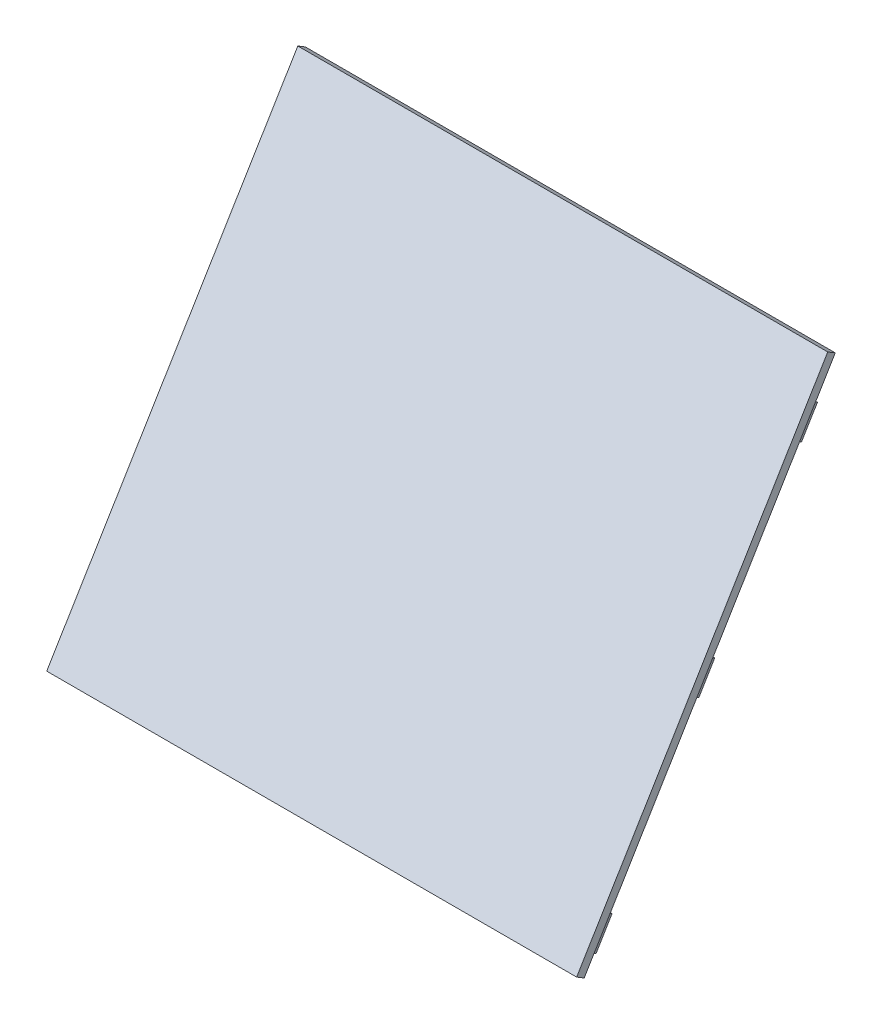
ISO-10303-21;
HEADER;
FILE_DESCRIPTION(('STEP AP214'),'2;1');
FILE_NAME('part.step','',(''),(''),'','','');
FILE_SCHEMA(('AUTOMOTIVE_DESIGN { 1 0 10303 214 1 1 1 1 }'));
ENDSEC;
DATA;
#1=APPLICATION_CONTEXT('core data for automotive mechanical design processes');
#2=APPLICATION_PROTOCOL_DEFINITION('international standard','automotive_design',2000,#1);
#3=PRODUCT_CONTEXT('',#1,'mechanical');
#4=PRODUCT('Part','Part','',(#3));
#5=PRODUCT_RELATED_PRODUCT_CATEGORY('part','',(#4));
#6=PRODUCT_DEFINITION_FORMATION('','',#4);
#7=PRODUCT_DEFINITION_CONTEXT('part definition',#1,'design');
#8=PRODUCT_DEFINITION('design','',#6,#7);
#9=PRODUCT_DEFINITION_SHAPE('','',#8);
#10=(LENGTH_UNIT() NAMED_UNIT(*) SI_UNIT(.MILLI.,.METRE.));
#11=(NAMED_UNIT(*) PLANE_ANGLE_UNIT() SI_UNIT($,.RADIAN.));
#12=(NAMED_UNIT(*) SI_UNIT($,.STERADIAN.) SOLID_ANGLE_UNIT());
#13=UNCERTAINTY_MEASURE_WITH_UNIT(LENGTH_MEASURE(1.E-05),#10,'distance_accuracy_value','');
#14=(GEOMETRIC_REPRESENTATION_CONTEXT(3) GLOBAL_UNCERTAINTY_ASSIGNED_CONTEXT((#13)) GLOBAL_UNIT_ASSIGNED_CONTEXT((#10,
#11,#12)) REPRESENTATION_CONTEXT('',''));
#15=CARTESIAN_POINT('',(0.,0.,0.));
#16=DIRECTION('',(0.,0.,1.));
#17=DIRECTION('',(1.,0.,0.));
#18=AXIS2_PLACEMENT_3D('',#15,#16,#17);
#19=CARTESIAN_POINT('',(0.,-764.1342802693,1770.792932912));
#20=DIRECTION('',(0.,-0.516869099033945,-0.856064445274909));
#21=DIRECTION('',(0.,-0.856064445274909,0.516869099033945));
#22=AXIS2_PLACEMENT_3D('',#19,#20,#21);
#23=PLANE('',#22);
#24=DIRECTION('',(1.,0.,0.));
#25=VECTOR('',#24,1.);
#26=CARTESIAN_POINT('',(-300.,-528.7165578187,1628.653930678));
#27=LINE('',#26,#25);
#28=CARTESIAN_POINT('',(-300.,-528.7165578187,1628.653930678));
#29=VERTEX_POINT('',#28);
#30=CARTESIAN_POINT('',(300.,-528.7165578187,1628.653930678));
#31=VERTEX_POINT('',#30);
#32=EDGE_CURVE('P0_E83',#29,#31,#27,.T.);
#33=ORIENTED_EDGE('',*,*,#32,.T.);
#34=DIRECTION('',(0.,-0.856064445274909,0.516869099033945));
#35=VECTOR('',#34,1.);
#36=CARTESIAN_POINT('',(300.,-528.7165578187,1628.653930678));
#37=LINE('',#36,#35);
#38=CARTESIAN_POINT('',(300.,-999.55200272,1912.931935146));
#39=VERTEX_POINT('',#38);
#40=EDGE_CURVE('P0_E106',#31,#39,#37,.T.);
#41=ORIENTED_EDGE('',*,*,#40,.T.);
#42=DIRECTION('',(-1.,0.,0.));
#43=VECTOR('',#42,1.);
#44=CARTESIAN_POINT('',(300.,-999.55200272,1912.931935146));
#45=LINE('',#44,#43);
#46=CARTESIAN_POINT('',(-300.,-999.55200272,1912.931935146));
#47=VERTEX_POINT('',#46);
#48=EDGE_CURVE('P0_E74',#39,#47,#45,.T.);
#49=ORIENTED_EDGE('',*,*,#48,.T.);
#50=DIRECTION('',(0.,0.856064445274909,-0.516869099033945));
#51=VECTOR('',#50,1.);
#52=CARTESIAN_POINT('',(-300.,-999.55200272,1912.931935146));
#53=LINE('',#52,#51);
#54=EDGE_CURVE('P0_E11',#47,#29,#53,.T.);
#55=ORIENTED_EDGE('',*,*,#54,.T.);
#56=EDGE_LOOP('',(#33,#41,#49,#55));
#57=FACE_BOUND('',#56,.T.);
#58=ADVANCED_FACE('P0_F17',(#57),#23,.T.);
#59=CARTESIAN_POINT('',(0.,-758.965589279,1779.353577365));
#60=DIRECTION('',(0.,-0.516869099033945,-0.856064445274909));
#61=DIRECTION('',(0.,-0.856064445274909,0.516869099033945));
#62=AXIS2_PLACEMENT_3D('',#59,#60,#61);
#63=PLANE('',#62);
#64=DIRECTION('',(0.,0.856064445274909,-0.516869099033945));
#65=VECTOR('',#64,1.);
#66=CARTESIAN_POINT('',(-300.,-994.3833117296,1921.492579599));
#67=LINE('',#66,#65);
#68=CARTESIAN_POINT('',(-300.,-994.3833117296,1921.492579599));
#69=VERTEX_POINT('',#68);
#70=CARTESIAN_POINT('',(-300.,-523.5478668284,1637.21457513));
#71=VERTEX_POINT('',#70);
#72=EDGE_CURVE('P0_E27',#69,#71,#67,.T.);
#73=ORIENTED_EDGE('',*,*,#72,.F.);
#74=DIRECTION('',(-1.,0.,0.));
#75=VECTOR('',#74,1.);
#76=CARTESIAN_POINT('',(300.,-994.3833117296,1921.492579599));
#77=LINE('',#76,#75);
#78=CARTESIAN_POINT('',(300.,-994.3833117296,1921.492579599));
#79=VERTEX_POINT('',#78);
#80=EDGE_CURVE('P0_E108',#79,#69,#77,.T.);
#81=ORIENTED_EDGE('',*,*,#80,.F.);
#82=DIRECTION('',(0.,-0.856064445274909,0.516869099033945));
#83=VECTOR('',#82,1.);
#84=CARTESIAN_POINT('',(300.,-523.5478668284,1637.21457513));
#85=LINE('',#84,#83);
#86=CARTESIAN_POINT('',(300.,-523.5478668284,1637.21457513));
#87=VERTEX_POINT('',#86);
#88=EDGE_CURVE('P0_E84',#87,#79,#85,.T.);
#89=ORIENTED_EDGE('',*,*,#88,.F.);
#90=DIRECTION('',(1.,0.,0.));
#91=VECTOR('',#90,1.);
#92=CARTESIAN_POINT('',(-300.,-523.5478668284,1637.21457513));
#93=LINE('',#92,#91);
#94=EDGE_CURVE('P0_E81',#71,#87,#93,.T.);
#95=ORIENTED_EDGE('',*,*,#94,.F.);
#96=EDGE_LOOP('',(#73,#81,#89,#95));
#97=FACE_BOUND('',#96,.T.);
#98=ADVANCED_FACE('P0_F87',(#97),#63,.F.);
#99=CARTESIAN_POINT('',(-300.,-994.3833117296,1921.492579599));
#100=DIRECTION('',(1.,0.,0.));
#101=DIRECTION('',(0.,1.,0.));
#102=AXIS2_PLACEMENT_3D('',#99,#100,#101);
#103=PLANE('',#102);
#104=ORIENTED_EDGE('',*,*,#72,.T.);
#105=DIRECTION('',(0.,-0.516869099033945,-0.856064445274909));
#106=VECTOR('',#105,1.);
#107=CARTESIAN_POINT('',(-300.,-523.5478668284,1637.21457513));
#108=LINE('',#107,#106);
#109=EDGE_CURVE('P0_E69',#71,#29,#108,.T.);
#110=ORIENTED_EDGE('',*,*,#109,.T.);
#111=ORIENTED_EDGE('',*,*,#54,.F.);
#112=DIRECTION('',(0.,-0.516869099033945,-0.856064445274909));
#113=VECTOR('',#112,1.);
#114=CARTESIAN_POINT('',(-300.,-994.3833117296,1921.492579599));
#115=LINE('',#114,#113);
#116=EDGE_CURVE('P0_E20',#69,#47,#115,.T.);
#117=ORIENTED_EDGE('',*,*,#116,.F.);
#118=EDGE_LOOP('',(#104,#110,#111,#117));
#119=FACE_BOUND('',#118,.T.);
#120=ADVANCED_FACE('P0_F67',(#119),#103,.F.);
#121=CARTESIAN_POINT('',(300.,-994.3833117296,1921.492579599));
#122=DIRECTION('',(0.,0.856064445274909,-0.516869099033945));
#123=DIRECTION('',(-1.,0.,0.));
#124=AXIS2_PLACEMENT_3D('',#121,#122,#123);
#125=PLANE('',#124);
#126=ORIENTED_EDGE('',*,*,#80,.T.);
#127=ORIENTED_EDGE('',*,*,#116,.T.);
#128=ORIENTED_EDGE('',*,*,#48,.F.);
#129=DIRECTION('',(0.,-0.516869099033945,-0.856064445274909));
#130=VECTOR('',#129,1.);
#131=CARTESIAN_POINT('',(300.,-994.3833117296,1921.492579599));
#132=LINE('',#131,#130);
#133=EDGE_CURVE('P0_E105',#79,#39,#132,.T.);
#134=ORIENTED_EDGE('',*,*,#133,.F.);
#135=EDGE_LOOP('',(#126,#127,#128,#134));
#136=FACE_BOUND('',#135,.T.);
#137=ADVANCED_FACE('P0_F120',(#136),#125,.F.);
#138=CARTESIAN_POINT('',(300.,-523.5478668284,1637.21457513));
#139=DIRECTION('',(-1.,0.,0.));
#140=DIRECTION('',(0.,0.,1.));
#141=AXIS2_PLACEMENT_3D('',#138,#139,#140);
#142=PLANE('',#141);
#143=ORIENTED_EDGE('',*,*,#88,.T.);
#144=ORIENTED_EDGE('',*,*,#133,.T.);
#145=ORIENTED_EDGE('',*,*,#40,.F.);
#146=DIRECTION('',(0.,-0.516869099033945,-0.856064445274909));
#147=VECTOR('',#146,1.);
#148=CARTESIAN_POINT('',(300.,-523.5478668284,1637.21457513));
#149=LINE('',#148,#147);
#150=EDGE_CURVE('P0_E93',#87,#31,#149,.T.);
#151=ORIENTED_EDGE('',*,*,#150,.F.);
#152=EDGE_LOOP('',(#143,#144,#145,#151));
#153=FACE_BOUND('',#152,.T.);
#154=ADVANCED_FACE('P0_F125',(#153),#142,.F.);
#155=CARTESIAN_POINT('',(-300.,-523.5478668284,1637.21457513));
#156=DIRECTION('',(0.,-0.856064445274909,0.516869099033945));
#157=DIRECTION('',(-1.,0.,0.));
#158=AXIS2_PLACEMENT_3D('',#155,#156,#157);
#159=PLANE('',#158);
#160=ORIENTED_EDGE('',*,*,#94,.T.);
#161=ORIENTED_EDGE('',*,*,#150,.T.);
#162=ORIENTED_EDGE('',*,*,#32,.F.);
#163=ORIENTED_EDGE('',*,*,#109,.F.);
#164=EDGE_LOOP('',(#160,#161,#162,#163));
#165=FACE_BOUND('',#164,.T.);
#166=ADVANCED_FACE('P0_F78',(#165),#159,.F.);
#167=CLOSED_SHELL('',(#58,#98,#120,#137,#154,#166));
#168=MANIFOLD_SOLID_BREP('P0_B1',#167);
#169=CARTESIAN_POINT('',(86.,-1010.777753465,1822.754429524));
#170=DIRECTION('',(0.,0.856064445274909,-0.516869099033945));
#171=DIRECTION('',(-1.,0.,0.));
#172=AXIS2_PLACEMENT_3D('',#169,#170,#171);
#173=PLANE('',#172);
#174=CARTESIAN_POINT('',(-22.98097038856,-1032.496091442,1786.783432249));
#175=DIRECTION('',(0.,-0.856064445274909,0.516869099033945));
#176=DIRECTION('',(0.,-0.516869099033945,-0.856064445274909));
#177=AXIS2_PLACEMENT_3D('',#174,#175,#176);
#178=CIRCLE('',#177,6.75);
#179=CARTESIAN_POINT('',(-22.98097038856,-1035.98495786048,1781.0049972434));
#180=VERTEX_POINT('',#179);
#181=EDGE_CURVE('P1_E21',#180,#180,#178,.T.);
#182=ORIENTED_EDGE('',*,*,#181,.F.);
#183=EDGE_LOOP('',(#182));
#184=FACE_BOUND('',#183,.T.);
#185=CARTESIAN_POINT('',(22.980970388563,-1032.496091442,1786.783432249));
#186=DIRECTION('',(0.,-0.856064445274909,0.516869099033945));
#187=DIRECTION('',(0.,-0.516869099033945,-0.856064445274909));
#188=AXIS2_PLACEMENT_3D('',#185,#186,#187);
#189=CIRCLE('',#188,6.75);
#190=CARTESIAN_POINT('',(22.980970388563,-1035.98495786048,1781.0049972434));
#191=VERTEX_POINT('',#190);
#192=EDGE_CURVE('P1_E11',#191,#191,#189,.T.);
#193=ORIENTED_EDGE('',*,*,#192,.F.);
#194=EDGE_LOOP('',(#193));
#195=FACE_BOUND('',#194,.T.);
#196=CARTESIAN_POINT('',(0.,-1044.374244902,1767.110240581));
#197=DIRECTION('',(0.,-0.856064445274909,0.516869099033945));
#198=DIRECTION('',(0.,-0.516869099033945,-0.856064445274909));
#199=AXIS2_PLACEMENT_3D('',#196,#197,#198);
#200=CIRCLE('',#199,24.);
#201=CARTESIAN_POINT('',(0.,-1056.77910327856,1746.56469389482));
#202=VERTEX_POINT('',#201);
#203=EDGE_CURVE('P1_E151',#202,#202,#200,.T.);
#204=ORIENTED_EDGE('',*,*,#203,.F.);
#205=EDGE_LOOP('',(#204));
#206=FACE_BOUND('',#205,.T.);
#207=CARTESIAN_POINT('',(-22.98097038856,-1056.252398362,1747.437048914));
#208=DIRECTION('',(0.,-0.856064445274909,0.516869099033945));
#209=DIRECTION('',(0.,-0.516869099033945,-0.856064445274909));
#210=AXIS2_PLACEMENT_3D('',#207,#208,#209);
#211=CIRCLE('',#210,6.75);
#212=CARTESIAN_POINT('',(-22.98097038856,-1059.74126478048,1741.6586139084));
#213=VERTEX_POINT('',#212);
#214=EDGE_CURVE('P1_E145',#213,#213,#211,.T.);
#215=ORIENTED_EDGE('',*,*,#214,.F.);
#216=EDGE_LOOP('',(#215));
#217=FACE_BOUND('',#216,.T.);
#218=CARTESIAN_POINT('',(22.980970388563,-1056.252398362,1747.437048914));
#219=DIRECTION('',(0.,-0.856064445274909,0.516869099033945));
#220=DIRECTION('',(0.,-0.516869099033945,-0.856064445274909));
#221=AXIS2_PLACEMENT_3D('',#218,#219,#220);
#222=CIRCLE('',#221,6.75);
#223=CARTESIAN_POINT('',(22.980970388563,-1059.74126478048,1741.6586139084));
#224=VERTEX_POINT('',#223);
#225=EDGE_CURVE('P1_E146',#224,#224,#222,.T.);
#226=ORIENTED_EDGE('',*,*,#225,.F.);
#227=EDGE_LOOP('',(#226));
#228=FACE_BOUND('',#227,.T.);
#229=DIRECTION('',(-1.,0.,0.));
#230=VECTOR('',#229,1.);
#231=CARTESIAN_POINT('',(86.,-1010.777753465,1822.754429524));
#232=LINE('',#231,#230);
#233=CARTESIAN_POINT('',(86.,-1010.777753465,1822.754429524));
#234=VERTEX_POINT('',#233);
#235=CARTESIAN_POINT('',(-86.,-1010.777753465,1822.754429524));
#236=VERTEX_POINT('',#235);
#237=EDGE_CURVE('P1_E132',#234,#236,#232,.T.);
#238=ORIENTED_EDGE('',*,*,#237,.T.);
#239=DIRECTION('',(0.,-0.516869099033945,-0.856064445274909));
#240=VECTOR('',#239,1.);
#241=CARTESIAN_POINT('',(-86.,-1010.777753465,1822.754429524));
#242=LINE('',#241,#240);
#243=CARTESIAN_POINT('',(-86.,-1077.970736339,1711.466051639));
#244=VERTEX_POINT('',#243);
#245=EDGE_CURVE('P1_E78',#236,#244,#242,.T.);
#246=ORIENTED_EDGE('',*,*,#245,.T.);
#247=DIRECTION('',(-1.,0.,0.));
#248=VECTOR('',#247,1.);
#249=CARTESIAN_POINT('',(86.,-1077.970736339,1711.466051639));
#250=LINE('',#249,#248);
#251=CARTESIAN_POINT('',(86.,-1077.970736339,1711.466051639));
#252=VERTEX_POINT('',#251);
#253=EDGE_CURVE('P1_E114',#252,#244,#250,.T.);
#254=ORIENTED_EDGE('',*,*,#253,.F.);
#255=DIRECTION('',(0.,-0.516869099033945,-0.856064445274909));
#256=VECTOR('',#255,1.);
#257=CARTESIAN_POINT('',(86.,-1010.777753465,1822.754429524));
#258=LINE('',#257,#256);
#259=EDGE_CURVE('P1_E39',#234,#252,#258,.T.);
#260=ORIENTED_EDGE('',*,*,#259,.F.);
#261=EDGE_LOOP('',(#238,#246,#254,#260));
#262=FACE_BOUND('',#261,.T.);
#263=ADVANCED_FACE('P1_F17',(#184,#195,#206,#217,#228,#262),#173,.F.);
#264=CARTESIAN_POINT('',(22.980970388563,-1007.670222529,1771.794228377));
#265=DIRECTION('',(0.,-0.856064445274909,0.516869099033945));
#266=DIRECTION('',(0.,-0.516869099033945,-0.856064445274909));
#267=AXIS2_PLACEMENT_3D('',#264,#265,#266);
#268=CYLINDRICAL_SURFACE('',#267,6.75);
#269=CARTESIAN_POINT('',(22.980970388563,-1022.223318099,1780.581003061));
#270=DIRECTION('',(0.,-0.856064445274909,0.516869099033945));
#271=DIRECTION('',(0.,-0.516869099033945,-0.856064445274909));
#272=AXIS2_PLACEMENT_3D('',#269,#270,#271);
#273=CIRCLE('',#272,6.75);
#274=CARTESIAN_POINT('',(22.980970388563,-1025.71218451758,1774.80256805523));
#275=VERTEX_POINT('',#274);
#276=EDGE_CURVE('P1_E83',#275,#275,#273,.T.);
#277=CARTESIAN_POINT('',(22.980970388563,-1035.98495786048,1781.0049972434));
#278=CARTESIAN_POINT('',(22.980970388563,-1035.87794980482,1780.94038860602));
#279=CARTESIAN_POINT('',(22.980970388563,-1035.77094174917,1780.87577996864));
#280=CARTESIAN_POINT('',(22.980970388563,-1035.55692563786,1780.74656269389));
#281=CARTESIAN_POINT('',(22.980970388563,-1035.4499175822,1780.68195405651));
#282=CARTESIAN_POINT('',(22.980970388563,-1035.23590147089,1780.55273678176));
#283=CARTESIAN_POINT('',(22.980970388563,-1035.12889341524,1780.48812814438));
#284=CARTESIAN_POINT('',(22.980970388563,-1034.91487730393,1780.35891086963));
#285=CARTESIAN_POINT('',(22.980970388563,-1034.80786924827,1780.29430223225));
#286=CARTESIAN_POINT('',(22.980970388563,-1034.59385313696,1780.1650849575));
#287=CARTESIAN_POINT('',(22.980970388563,-1034.48684508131,1780.10047632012));
#288=CARTESIAN_POINT('',(22.980970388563,-1034.27282897,1779.97125904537));
#289=CARTESIAN_POINT('',(22.980970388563,-1034.16582091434,1779.90665040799));
#290=CARTESIAN_POINT('',(22.980970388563,-1033.95180480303,1779.77743313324));
#291=CARTESIAN_POINT('',(22.980970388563,-1033.84479674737,1779.71282449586));
#292=CARTESIAN_POINT('',(22.980970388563,-1033.63078063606,1779.58360722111));
#293=CARTESIAN_POINT('',(22.980970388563,-1033.52377258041,1779.51899858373));
#294=CARTESIAN_POINT('',(22.980970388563,-1033.3097564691,1779.38978130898));
#295=CARTESIAN_POINT('',(22.980970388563,-1033.20274841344,1779.3251726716));
#296=CARTESIAN_POINT('',(22.980970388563,-1032.98873230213,1779.19595539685));
#297=CARTESIAN_POINT('',(22.980970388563,-1032.88172424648,1779.13134675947));
#298=CARTESIAN_POINT('',(22.980970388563,-1032.66770813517,1779.00212948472));
#299=CARTESIAN_POINT('',(22.980970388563,-1032.56070007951,1778.93752084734));
#300=CARTESIAN_POINT('',(22.980970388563,-1032.3466839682,1778.80830357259));
#301=CARTESIAN_POINT('',(22.980970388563,-1032.23967591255,1778.74369493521));
#302=CARTESIAN_POINT('',(22.980970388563,-1032.02565980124,1778.61447766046));
#303=CARTESIAN_POINT('',(22.980970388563,-1031.91865174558,1778.54986902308));
#304=CARTESIAN_POINT('',(22.980970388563,-1031.70463563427,1778.42065174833));
#305=CARTESIAN_POINT('',(22.980970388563,-1031.59762757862,1778.35604311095));
#306=CARTESIAN_POINT('',(22.980970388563,-1031.3836114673,1778.2268258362));
#307=CARTESIAN_POINT('',(22.980970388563,-1031.27660341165,1778.16221719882));
#308=CARTESIAN_POINT('',(22.980970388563,-1031.06258730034,1778.03299992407));
#309=CARTESIAN_POINT('',(22.980970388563,-1030.95557924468,1777.96839128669));
#310=CARTESIAN_POINT('',(22.980970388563,-1030.74156313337,1777.83917401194));
#311=CARTESIAN_POINT('',(22.980970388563,-1030.63455507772,1777.77456537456));
#312=CARTESIAN_POINT('',(22.980970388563,-1030.42053896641,1777.64534809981));
#313=CARTESIAN_POINT('',(22.980970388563,-1030.31353091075,1777.58073946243));
#314=CARTESIAN_POINT('',(22.980970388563,-1030.09951479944,1777.45152218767));
#315=CARTESIAN_POINT('',(22.980970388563,-1029.99250674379,1777.3869135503));
#316=CARTESIAN_POINT('',(22.980970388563,-1029.77849063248,1777.25769627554));
#317=CARTESIAN_POINT('',(22.980970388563,-1029.67148257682,1777.19308763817));
#318=CARTESIAN_POINT('',(22.980970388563,-1029.45746646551,1777.06387036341));
#319=CARTESIAN_POINT('',(22.980970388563,-1029.35045840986,1776.99926172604));
#320=CARTESIAN_POINT('',(22.980970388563,-1029.13644229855,1776.87004445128));
#321=CARTESIAN_POINT('',(22.980970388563,-1029.02943424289,1776.80543581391));
#322=CARTESIAN_POINT('',(22.980970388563,-1028.81541813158,1776.67621853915));
#323=CARTESIAN_POINT('',(22.980970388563,-1028.70841007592,1776.61160990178));
#324=CARTESIAN_POINT('',(22.980970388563,-1028.49439396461,1776.48239262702));
#325=CARTESIAN_POINT('',(22.980970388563,-1028.38738590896,1776.41778398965));
#326=CARTESIAN_POINT('',(22.980970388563,-1028.17336979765,1776.28856671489));
#327=CARTESIAN_POINT('',(22.980970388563,-1028.06636174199,1776.22395807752));
#328=CARTESIAN_POINT('',(22.980970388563,-1027.85234563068,1776.09474080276));
#329=CARTESIAN_POINT('',(22.980970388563,-1027.74533757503,1776.03013216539));
#330=CARTESIAN_POINT('',(22.980970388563,-1027.53132146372,1775.90091489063));
#331=CARTESIAN_POINT('',(22.980970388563,-1027.42431340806,1775.83630625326));
#332=CARTESIAN_POINT('',(22.980970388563,-1027.21029729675,1775.7070889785));
#333=CARTESIAN_POINT('',(22.980970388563,-1027.1032892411,1775.64248034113));
#334=CARTESIAN_POINT('',(22.980970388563,-1026.88927312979,1775.51326306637));
#335=CARTESIAN_POINT('',(22.980970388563,-1026.78226507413,1775.448654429));
#336=CARTESIAN_POINT('',(22.980970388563,-1026.56824896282,1775.31943715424));
#337=CARTESIAN_POINT('',(22.980970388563,-1026.46124090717,1775.25482851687));
#338=CARTESIAN_POINT('',(22.980970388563,-1026.24722479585,1775.12561124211));
#339=CARTESIAN_POINT('',(22.980970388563,-1026.1402167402,1775.06100260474));
#340=CARTESIAN_POINT('',(22.980970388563,-1025.92620062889,1774.93178532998));
#341=CARTESIAN_POINT('',(22.980970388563,-1025.81919257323,1774.86717669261));
#342=CARTESIAN_POINT('',(22.980970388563,-1025.71218451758,1774.80256805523));
#343=B_SPLINE_CURVE_WITH_KNOTS('',3,(#277,#278,#279,#280,#281,#282,#283,#284,#285,#286,#287,
#288,#289,#290,#291,#292,#293,#294,#295,#296,#297,#298,#299,#300,#301,#302,#303,#304,#305,#306,
#307,#308,#309,#310,#311,#312,#313,#314,#315,#316,#317,#318,#319,#320,#321,#322,#323,#324,#325,
#326,#327,#328,#329,#330,#331,#332,#333,#334,#335,#336,#337,#338,#339,#340,#341,#342),
.UNSPECIFIED.,.F.,.F.,(4,2,2,2,2,2,2,2,2,2,2,2,2,2,2,2,2,2,2,2,2,2,2,2,2,2,2,2,2,2,2,2,4),(0.,
0.374999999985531,0.749999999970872,1.12499999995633,1.49999999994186,1.8749999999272,
2.24999999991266,2.624999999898,2.99999999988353,3.37499999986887,3.74999999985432,
4.12499999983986,4.4999999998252,4.87499999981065,5.24999999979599,5.62499999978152,
5.99999999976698,6.37499999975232,6.74999999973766,7.12499999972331,7.49999999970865,
7.87499999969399,8.24999999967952,8.62499999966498,8.99999999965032,9.37499999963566,
9.74999999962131,10.1249999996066,10.499999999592,10.8749999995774,11.249999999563,
11.6249999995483,11.9999999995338),.UNSPECIFIED.);
#344=EDGE_CURVE('P1_BSEAM170',#191,#275,#343,.T.);
#345=ORIENTED_EDGE('',*,*,#192,.T.);
#346=ORIENTED_EDGE('',*,*,#276,.F.);
#347=ORIENTED_EDGE('',*,*,#344,.T.);
#348=ORIENTED_EDGE('',*,*,#344,.F.);
#349=EDGE_LOOP('',(#345,#347,#346,#348));
#350=FACE_BOUND('',#349,.T.);
#351=ADVANCED_FACE('P1_F170',(#350),#268,.F.);
#352=CARTESIAN_POINT('',(-22.98097038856,-1007.670222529,1771.794228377));
#353=DIRECTION('',(0.,-0.856064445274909,0.516869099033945));
#354=DIRECTION('',(0.,-0.516869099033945,-0.856064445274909));
#355=AXIS2_PLACEMENT_3D('',#352,#353,#354);
#356=CYLINDRICAL_SURFACE('',#355,6.75);
#357=CARTESIAN_POINT('',(-22.98097038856,-1022.223318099,1780.581003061));
#358=DIRECTION('',(0.,-0.856064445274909,0.516869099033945));
#359=DIRECTION('',(0.,-0.516869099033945,-0.856064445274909));
#360=AXIS2_PLACEMENT_3D('',#357,#358,#359);
#361=CIRCLE('',#360,6.75);
#362=CARTESIAN_POINT('',(-22.98097038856,-1025.71218451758,1774.80256805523));
#363=VERTEX_POINT('',#362);
#364=EDGE_CURVE('P1_E121',#363,#363,#361,.T.);
#365=CARTESIAN_POINT('',(-22.98097038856,-1035.98495786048,1781.0049972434));
#366=CARTESIAN_POINT('',(-22.98097038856,-1035.87794980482,1780.94038860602));
#367=CARTESIAN_POINT('',(-22.98097038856,-1035.77094174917,1780.87577996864));
#368=CARTESIAN_POINT('',(-22.98097038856,-1035.55692563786,1780.74656269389));
#369=CARTESIAN_POINT('',(-22.98097038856,-1035.4499175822,1780.68195405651));
#370=CARTESIAN_POINT('',(-22.98097038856,-1035.23590147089,1780.55273678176));
#371=CARTESIAN_POINT('',(-22.98097038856,-1035.12889341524,1780.48812814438));
#372=CARTESIAN_POINT('',(-22.98097038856,-1034.91487730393,1780.35891086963));
#373=CARTESIAN_POINT('',(-22.98097038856,-1034.80786924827,1780.29430223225));
#374=CARTESIAN_POINT('',(-22.98097038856,-1034.59385313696,1780.1650849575));
#375=CARTESIAN_POINT('',(-22.98097038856,-1034.48684508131,1780.10047632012));
#376=CARTESIAN_POINT('',(-22.98097038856,-1034.27282897,1779.97125904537));
#377=CARTESIAN_POINT('',(-22.98097038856,-1034.16582091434,1779.90665040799));
#378=CARTESIAN_POINT('',(-22.98097038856,-1033.95180480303,1779.77743313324));
#379=CARTESIAN_POINT('',(-22.98097038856,-1033.84479674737,1779.71282449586));
#380=CARTESIAN_POINT('',(-22.98097038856,-1033.63078063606,1779.58360722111));
#381=CARTESIAN_POINT('',(-22.98097038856,-1033.52377258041,1779.51899858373));
#382=CARTESIAN_POINT('',(-22.98097038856,-1033.3097564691,1779.38978130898));
#383=CARTESIAN_POINT('',(-22.98097038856,-1033.20274841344,1779.3251726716));
#384=CARTESIAN_POINT('',(-22.98097038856,-1032.98873230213,1779.19595539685));
#385=CARTESIAN_POINT('',(-22.98097038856,-1032.88172424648,1779.13134675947));
#386=CARTESIAN_POINT('',(-22.98097038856,-1032.66770813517,1779.00212948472));
#387=CARTESIAN_POINT('',(-22.98097038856,-1032.56070007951,1778.93752084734));
#388=CARTESIAN_POINT('',(-22.98097038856,-1032.3466839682,1778.80830357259));
#389=CARTESIAN_POINT('',(-22.98097038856,-1032.23967591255,1778.74369493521));
#390=CARTESIAN_POINT('',(-22.98097038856,-1032.02565980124,1778.61447766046));
#391=CARTESIAN_POINT('',(-22.98097038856,-1031.91865174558,1778.54986902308));
#392=CARTESIAN_POINT('',(-22.98097038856,-1031.70463563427,1778.42065174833));
#393=CARTESIAN_POINT('',(-22.98097038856,-1031.59762757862,1778.35604311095));
#394=CARTESIAN_POINT('',(-22.98097038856,-1031.3836114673,1778.2268258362));
#395=CARTESIAN_POINT('',(-22.98097038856,-1031.27660341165,1778.16221719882));
#396=CARTESIAN_POINT('',(-22.98097038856,-1031.06258730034,1778.03299992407));
#397=CARTESIAN_POINT('',(-22.98097038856,-1030.95557924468,1777.96839128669));
#398=CARTESIAN_POINT('',(-22.98097038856,-1030.74156313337,1777.83917401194));
#399=CARTESIAN_POINT('',(-22.98097038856,-1030.63455507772,1777.77456537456));
#400=CARTESIAN_POINT('',(-22.98097038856,-1030.42053896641,1777.64534809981));
#401=CARTESIAN_POINT('',(-22.98097038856,-1030.31353091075,1777.58073946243));
#402=CARTESIAN_POINT('',(-22.98097038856,-1030.09951479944,1777.45152218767));
#403=CARTESIAN_POINT('',(-22.98097038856,-1029.99250674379,1777.3869135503));
#404=CARTESIAN_POINT('',(-22.98097038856,-1029.77849063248,1777.25769627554));
#405=CARTESIAN_POINT('',(-22.98097038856,-1029.67148257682,1777.19308763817));
#406=CARTESIAN_POINT('',(-22.98097038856,-1029.45746646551,1777.06387036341));
#407=CARTESIAN_POINT('',(-22.98097038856,-1029.35045840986,1776.99926172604));
#408=CARTESIAN_POINT('',(-22.98097038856,-1029.13644229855,1776.87004445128));
#409=CARTESIAN_POINT('',(-22.98097038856,-1029.02943424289,1776.80543581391));
#410=CARTESIAN_POINT('',(-22.98097038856,-1028.81541813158,1776.67621853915));
#411=CARTESIAN_POINT('',(-22.98097038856,-1028.70841007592,1776.61160990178));
#412=CARTESIAN_POINT('',(-22.98097038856,-1028.49439396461,1776.48239262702));
#413=CARTESIAN_POINT('',(-22.98097038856,-1028.38738590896,1776.41778398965));
#414=CARTESIAN_POINT('',(-22.98097038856,-1028.17336979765,1776.28856671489));
#415=CARTESIAN_POINT('',(-22.98097038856,-1028.06636174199,1776.22395807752));
#416=CARTESIAN_POINT('',(-22.98097038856,-1027.85234563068,1776.09474080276));
#417=CARTESIAN_POINT('',(-22.98097038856,-1027.74533757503,1776.03013216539));
#418=CARTESIAN_POINT('',(-22.98097038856,-1027.53132146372,1775.90091489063));
#419=CARTESIAN_POINT('',(-22.98097038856,-1027.42431340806,1775.83630625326));
#420=CARTESIAN_POINT('',(-22.98097038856,-1027.21029729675,1775.7070889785));
#421=CARTESIAN_POINT('',(-22.98097038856,-1027.1032892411,1775.64248034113));
#422=CARTESIAN_POINT('',(-22.98097038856,-1026.88927312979,1775.51326306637));
#423=CARTESIAN_POINT('',(-22.98097038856,-1026.78226507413,1775.448654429));
#424=CARTESIAN_POINT('',(-22.98097038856,-1026.56824896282,1775.31943715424));
#425=CARTESIAN_POINT('',(-22.98097038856,-1026.46124090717,1775.25482851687));
#426=CARTESIAN_POINT('',(-22.98097038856,-1026.24722479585,1775.12561124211));
#427=CARTESIAN_POINT('',(-22.98097038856,-1026.1402167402,1775.06100260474));
#428=CARTESIAN_POINT('',(-22.98097038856,-1025.92620062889,1774.93178532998));
#429=CARTESIAN_POINT('',(-22.98097038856,-1025.81919257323,1774.86717669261));
#430=CARTESIAN_POINT('',(-22.98097038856,-1025.71218451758,1774.80256805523));
#431=B_SPLINE_CURVE_WITH_KNOTS('',3,(#365,#366,#367,#368,#369,#370,#371,#372,#373,#374,#375,
#376,#377,#378,#379,#380,#381,#382,#383,#384,#385,#386,#387,#388,#389,#390,#391,#392,#393,#394,
#395,#396,#397,#398,#399,#400,#401,#402,#403,#404,#405,#406,#407,#408,#409,#410,#411,#412,#413,
#414,#415,#416,#417,#418,#419,#420,#421,#422,#423,#424,#425,#426,#427,#428,#429,#430),
.UNSPECIFIED.,.F.,.F.,(4,2,2,2,2,2,2,2,2,2,2,2,2,2,2,2,2,2,2,2,2,2,2,2,2,2,2,2,2,2,2,2,4),(0.,
0.374999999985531,0.749999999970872,1.12499999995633,1.49999999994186,1.8749999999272,
2.24999999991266,2.624999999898,2.99999999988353,3.37499999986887,3.74999999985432,
4.12499999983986,4.4999999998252,4.87499999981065,5.24999999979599,5.62499999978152,
5.99999999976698,6.37499999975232,6.74999999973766,7.12499999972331,7.49999999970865,
7.87499999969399,8.24999999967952,8.62499999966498,8.99999999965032,9.37499999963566,
9.74999999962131,10.1249999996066,10.499999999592,10.8749999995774,11.249999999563,
11.6249999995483,11.9999999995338),.UNSPECIFIED.);
#432=EDGE_CURVE('P1_BSEAM19',#180,#363,#431,.T.);
#433=ORIENTED_EDGE('',*,*,#181,.T.);
#434=ORIENTED_EDGE('',*,*,#364,.F.);
#435=ORIENTED_EDGE('',*,*,#432,.T.);
#436=ORIENTED_EDGE('',*,*,#432,.F.);
#437=EDGE_LOOP('',(#433,#435,#434,#436));
#438=FACE_BOUND('',#437,.T.);
#439=ADVANCED_FACE('P1_F19',(#438),#356,.F.);
#440=CARTESIAN_POINT('',(0.,-1032.389342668,1759.874073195));
#441=DIRECTION('',(0.,-0.856064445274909,0.516869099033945));
#442=DIRECTION('',(0.,-0.516869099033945,-0.856064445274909));
#443=AXIS2_PLACEMENT_3D('',#440,#441,#442);
#444=CYLINDRICAL_SURFACE('',#443,24.);
#445=CARTESIAN_POINT('',(0.,-1034.101471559,1760.907811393));
#446=DIRECTION('',(0.,-0.856064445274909,0.516869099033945));
#447=DIRECTION('',(0.,-0.516869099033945,-0.856064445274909));
#448=AXIS2_PLACEMENT_3D('',#445,#446,#447);
#449=CIRCLE('',#448,24.);
#450=CARTESIAN_POINT('',(0.,-1046.50632993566,1740.36226470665));
#451=VERTEX_POINT('',#450);
#452=EDGE_CURVE('P1_E107',#451,#451,#449,.T.);
#453=CARTESIAN_POINT('',(0.,-1056.77910327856,1746.56469389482));
#454=CARTESIAN_POINT('',(0.,-1056.67209522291,1746.50008525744));
#455=CARTESIAN_POINT('',(0.,-1056.56508716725,1746.43547662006));
#456=CARTESIAN_POINT('',(0.,-1056.35107105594,1746.30625934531));
#457=CARTESIAN_POINT('',(0.,-1056.24406300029,1746.24165070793));
#458=CARTESIAN_POINT('',(0.,-1056.03004688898,1746.11243343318));
#459=CARTESIAN_POINT('',(0.,-1055.92303883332,1746.0478247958));
#460=CARTESIAN_POINT('',(0.,-1055.70902272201,1745.91860752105));
#461=CARTESIAN_POINT('',(0.,-1055.60201466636,1745.85399888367));
#462=CARTESIAN_POINT('',(0.,-1055.38799855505,1745.72478160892));
#463=CARTESIAN_POINT('',(0.,-1055.28099049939,1745.66017297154));
#464=CARTESIAN_POINT('',(0.,-1055.06697438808,1745.53095569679));
#465=CARTESIAN_POINT('',(0.,-1054.95996633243,1745.46634705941));
#466=CARTESIAN_POINT('',(0.,-1054.74595022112,1745.33712978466));
#467=CARTESIAN_POINT('',(0.,-1054.63894216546,1745.27252114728));
#468=CARTESIAN_POINT('',(0.,-1054.42492605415,1745.14330387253));
#469=CARTESIAN_POINT('',(0.,-1054.31791799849,1745.07869523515));
#470=CARTESIAN_POINT('',(0.,-1054.10390188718,1744.9494779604));
#471=CARTESIAN_POINT('',(0.,-1053.99689383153,1744.88486932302));
#472=CARTESIAN_POINT('',(0.,-1053.78287772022,1744.75565204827));
#473=CARTESIAN_POINT('',(0.,-1053.67586966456,1744.69104341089));
#474=CARTESIAN_POINT('',(0.,-1053.46185355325,1744.56182613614));
#475=CARTESIAN_POINT('',(0.,-1053.3548454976,1744.49721749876));
#476=CARTESIAN_POINT('',(0.,-1053.14082938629,1744.36800022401));
#477=CARTESIAN_POINT('',(0.,-1053.03382133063,1744.30339158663));
#478=CARTESIAN_POINT('',(0.,-1052.81980521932,1744.17417431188));
#479=CARTESIAN_POINT('',(0.,-1052.71279716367,1744.1095656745));
#480=CARTESIAN_POINT('',(0.,-1052.49878105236,1743.98034839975));
#481=CARTESIAN_POINT('',(0.,-1052.3917729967,1743.91573976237));
#482=CARTESIAN_POINT('',(0.,-1052.17775688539,1743.78652248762));
#483=CARTESIAN_POINT('',(0.,-1052.07074882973,1743.72191385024));
#484=CARTESIAN_POINT('',(0.,-1051.85673271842,1743.59269657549));
#485=CARTESIAN_POINT('',(0.,-1051.74972466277,1743.52808793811));
#486=CARTESIAN_POINT('',(0.,-1051.53570855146,1743.39887066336));
#487=CARTESIAN_POINT('',(0.,-1051.4287004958,1743.33426202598));
#488=CARTESIAN_POINT('',(0.,-1051.21468438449,1743.20504475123));
#489=CARTESIAN_POINT('',(0.,-1051.10767632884,1743.14043611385));
#490=CARTESIAN_POINT('',(0.,-1050.89366021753,1743.0112188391));
#491=CARTESIAN_POINT('',(0.,-1050.78665216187,1742.94661020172));
#492=CARTESIAN_POINT('',(0.,-1050.57263605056,1742.81739292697));
#493=CARTESIAN_POINT('',(0.,-1050.46562799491,1742.75278428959));
#494=CARTESIAN_POINT('',(0.,-1050.2516118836,1742.62356701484));
#495=CARTESIAN_POINT('',(0.,-1050.14460382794,1742.55895837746));
#496=CARTESIAN_POINT('',(0.,-1049.93058771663,1742.42974110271));
#497=CARTESIAN_POINT('',(0.,-1049.82357966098,1742.36513246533));
#498=CARTESIAN_POINT('',(0.,-1049.60956354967,1742.23591519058));
#499=CARTESIAN_POINT('',(0.,-1049.50255549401,1742.1713065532));
#500=CARTESIAN_POINT('',(0.,-1049.2885393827,1742.04208927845));
#501=CARTESIAN_POINT('',(0.,-1049.18153132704,1741.97748064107));
#502=CARTESIAN_POINT('',(0.,-1048.96751521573,1741.84826336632));
#503=CARTESIAN_POINT('',(0.,-1048.86050716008,1741.78365472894));
#504=CARTESIAN_POINT('',(0.,-1048.64649104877,1741.65443745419));
#505=CARTESIAN_POINT('',(0.,-1048.53948299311,1741.58982881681));
#506=CARTESIAN_POINT('',(0.,-1048.3254668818,1741.46061154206));
#507=CARTESIAN_POINT('',(0.,-1048.21845882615,1741.39600290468));
#508=CARTESIAN_POINT('',(0.,-1048.00444271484,1741.26678562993));
#509=CARTESIAN_POINT('',(0.,-1047.89743465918,1741.20217699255));
#510=CARTESIAN_POINT('',(0.,-1047.68341854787,1741.0729597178));
#511=CARTESIAN_POINT('',(0.,-1047.57641049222,1741.00835108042));
#512=CARTESIAN_POINT('',(0.,-1047.36239438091,1740.87913380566));
#513=CARTESIAN_POINT('',(0.,-1047.25538632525,1740.81452516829));
#514=CARTESIAN_POINT('',(0.,-1047.04137021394,1740.68530789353));
#515=CARTESIAN_POINT('',(0.,-1046.93436215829,1740.62069925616));
#516=CARTESIAN_POINT('',(0.,-1046.72034604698,1740.4914819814));
#517=CARTESIAN_POINT('',(0.,-1046.61333799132,1740.42687334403));
#518=CARTESIAN_POINT('',(0.,-1046.50632993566,1740.36226470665));
#519=B_SPLINE_CURVE_WITH_KNOTS('',3,(#453,#454,#455,#456,#457,#458,#459,#460,#461,#462,#463,
#464,#465,#466,#467,#468,#469,#470,#471,#472,#473,#474,#475,#476,#477,#478,#479,#480,#481,#482,
#483,#484,#485,#486,#487,#488,#489,#490,#491,#492,#493,#494,#495,#496,#497,#498,#499,#500,#501,
#502,#503,#504,#505,#506,#507,#508,#509,#510,#511,#512,#513,#514,#515,#516,#517,#518),
.UNSPECIFIED.,.F.,.F.,(4,2,2,2,2,2,2,2,2,2,2,2,2,2,2,2,2,2,2,2,2,2,2,2,2,2,2,2,2,2,2,2,4),(0.,
0.374999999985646,0.749999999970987,1.12499999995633,1.49999999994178,1.87499999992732,
2.24999999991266,2.624999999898,2.99999999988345,3.37499999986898,3.74999999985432,
4.12499999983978,4.49999999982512,4.87499999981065,5.24999999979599,5.62499999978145,
5.99999999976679,6.37499999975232,6.74999999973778,7.12499999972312,7.49999999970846,
7.87499999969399,8.24999999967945,8.62499999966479,8.99999999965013,9.37499999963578,
9.74999999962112,10.1249999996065,10.4999999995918,10.8749999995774,11.2499999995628,
11.6249999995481,11.9999999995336),.UNSPECIFIED.);
#520=EDGE_CURVE('P1_BSEAM195',#202,#451,#519,.T.);
#521=ORIENTED_EDGE('',*,*,#203,.T.);
#522=ORIENTED_EDGE('',*,*,#452,.F.);
#523=ORIENTED_EDGE('',*,*,#520,.T.);
#524=ORIENTED_EDGE('',*,*,#520,.F.);
#525=EDGE_LOOP('',(#521,#523,#522,#524));
#526=FACE_BOUND('',#525,.T.);
#527=ADVANCED_FACE('P1_F195',(#526),#444,.F.);
#528=CARTESIAN_POINT('',(22.980970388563,-1031.426529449,1732.447845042));
#529=DIRECTION('',(0.,-0.856064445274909,0.516869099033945));
#530=DIRECTION('',(0.,-0.516869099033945,-0.856064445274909));
#531=AXIS2_PLACEMENT_3D('',#528,#529,#530);
#532=CYLINDRICAL_SURFACE('',#531,6.75);
#533=CARTESIAN_POINT('',(22.980970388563,-1045.979625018,1741.234619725));
#534=DIRECTION('',(0.,-0.856064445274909,0.516869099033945));
#535=DIRECTION('',(0.,-0.516869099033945,-0.856064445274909));
#536=AXIS2_PLACEMENT_3D('',#533,#534,#535);
#537=CIRCLE('',#536,6.75);
#538=CARTESIAN_POINT('',(22.980970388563,-1049.4684914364,1735.45618471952));
#539=VERTEX_POINT('',#538);
#540=EDGE_CURVE('P1_E120',#539,#539,#537,.T.);
#541=CARTESIAN_POINT('',(22.980970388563,-1059.74126478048,1741.6586139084));
#542=CARTESIAN_POINT('',(22.980970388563,-1059.63425672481,1741.59400527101));
#543=CARTESIAN_POINT('',(22.980970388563,-1059.52724866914,1741.52939663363));
#544=CARTESIAN_POINT('',(22.980970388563,-1059.31323255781,1741.40017935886));
#545=CARTESIAN_POINT('',(22.980970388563,-1059.20622450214,1741.33557072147));
#546=CARTESIAN_POINT('',(22.980970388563,-1058.99220839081,1741.20635344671));
#547=CARTESIAN_POINT('',(22.980970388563,-1058.88520033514,1741.14174480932));
#548=CARTESIAN_POINT('',(22.980970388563,-1058.6711842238,1741.01252753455));
#549=CARTESIAN_POINT('',(22.980970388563,-1058.56417616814,1740.94791889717));
#550=CARTESIAN_POINT('',(22.980970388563,-1058.3501600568,1740.8187016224));
#551=CARTESIAN_POINT('',(22.980970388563,-1058.24315200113,1740.75409298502));
#552=CARTESIAN_POINT('',(22.980970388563,-1058.0291358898,1740.62487571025));
#553=CARTESIAN_POINT('',(22.980970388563,-1057.92212783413,1740.56026707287));
#554=CARTESIAN_POINT('',(22.980970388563,-1057.7081117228,1740.4310497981));
#555=CARTESIAN_POINT('',(22.980970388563,-1057.60110366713,1740.36644116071));
#556=CARTESIAN_POINT('',(22.980970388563,-1057.3870875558,1740.23722388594));
#557=CARTESIAN_POINT('',(22.980970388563,-1057.28007950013,1740.17261524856));
#558=CARTESIAN_POINT('',(22.980970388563,-1057.06606338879,1740.04339797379));
#559=CARTESIAN_POINT('',(22.980970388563,-1056.95905533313,1739.97878933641));
#560=CARTESIAN_POINT('',(22.980970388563,-1056.74503922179,1739.84957206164));
#561=CARTESIAN_POINT('',(22.980970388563,-1056.63803116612,1739.78496342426));
#562=CARTESIAN_POINT('',(22.980970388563,-1056.42401505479,1739.65574614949));
#563=CARTESIAN_POINT('',(22.980970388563,-1056.31700699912,1739.5911375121));
#564=CARTESIAN_POINT('',(22.980970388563,-1056.10299088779,1739.46192023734));
#565=CARTESIAN_POINT('',(22.980970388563,-1055.99598283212,1739.39731159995));
#566=CARTESIAN_POINT('',(22.980970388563,-1055.78196672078,1739.26809432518));
#567=CARTESIAN_POINT('',(22.980970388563,-1055.67495866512,1739.2034856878));
#568=CARTESIAN_POINT('',(22.980970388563,-1055.46094255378,1739.07426841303));
#569=CARTESIAN_POINT('',(22.980970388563,-1055.35393449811,1739.00965977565));
#570=CARTESIAN_POINT('',(22.980970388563,-1055.13991838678,1738.88044250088));
#571=CARTESIAN_POINT('',(22.980970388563,-1055.03291033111,1738.81583386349));
#572=CARTESIAN_POINT('',(22.980970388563,-1054.81889421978,1738.68661658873));
#573=CARTESIAN_POINT('',(22.980970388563,-1054.71188616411,1738.62200795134));
#574=CARTESIAN_POINT('',(22.980970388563,-1054.49787005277,1738.49279067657));
#575=CARTESIAN_POINT('',(22.980970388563,-1054.39086199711,1738.42818203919));
#576=CARTESIAN_POINT('',(22.980970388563,-1054.17684588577,1738.29896476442));
#577=CARTESIAN_POINT('',(22.980970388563,-1054.0698378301,1738.23435612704));
#578=CARTESIAN_POINT('',(22.980970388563,-1053.85582171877,1738.10513885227));
#579=CARTESIAN_POINT('',(22.980970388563,-1053.7488136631,1738.04053021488));
#580=CARTESIAN_POINT('',(22.980970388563,-1053.53479755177,1737.91131294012));
#581=CARTESIAN_POINT('',(22.980970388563,-1053.4277894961,1737.84670430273));
#582=CARTESIAN_POINT('',(22.980970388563,-1053.21377338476,1737.71748702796));
#583=CARTESIAN_POINT('',(22.980970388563,-1053.1067653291,1737.65287839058));
#584=CARTESIAN_POINT('',(22.980970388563,-1052.89274921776,1737.52366111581));
#585=CARTESIAN_POINT('',(22.980970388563,-1052.78574116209,1737.45905247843));
#586=CARTESIAN_POINT('',(22.980970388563,-1052.57172505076,1737.32983520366));
#587=CARTESIAN_POINT('',(22.980970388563,-1052.46471699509,1737.26522656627));
#588=CARTESIAN_POINT('',(22.980970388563,-1052.25070088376,1737.13600929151));
#589=CARTESIAN_POINT('',(22.980970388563,-1052.14369282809,1737.07140065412));
#590=CARTESIAN_POINT('',(22.980970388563,-1051.92967671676,1736.94218337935));
#591=CARTESIAN_POINT('',(22.980970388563,-1051.82266866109,1736.87757474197));
#592=CARTESIAN_POINT('',(22.980970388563,-1051.60865254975,1736.7483574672));
#593=CARTESIAN_POINT('',(22.980970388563,-1051.50164449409,1736.68374882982));
#594=CARTESIAN_POINT('',(22.980970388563,-1051.28762838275,1736.55453155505));
#595=CARTESIAN_POINT('',(22.980970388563,-1051.18062032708,1736.48992291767));
#596=CARTESIAN_POINT('',(22.980970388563,-1050.96660421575,1736.3607056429));
#597=CARTESIAN_POINT('',(22.980970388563,-1050.85959616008,1736.29609700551));
#598=CARTESIAN_POINT('',(22.980970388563,-1050.64558004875,1736.16687973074));
#599=CARTESIAN_POINT('',(22.980970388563,-1050.53857199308,1736.10227109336));
#600=CARTESIAN_POINT('',(22.980970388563,-1050.32455588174,1735.97305381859));
#601=CARTESIAN_POINT('',(22.980970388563,-1050.21754782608,1735.90844518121));
#602=CARTESIAN_POINT('',(22.980970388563,-1050.00353171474,1735.77922790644));
#603=CARTESIAN_POINT('',(22.980970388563,-1049.89652365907,1735.71461926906));
#604=CARTESIAN_POINT('',(22.980970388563,-1049.68250754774,1735.58540199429));
#605=CARTESIAN_POINT('',(22.980970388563,-1049.57549949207,1735.5207933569));
#606=CARTESIAN_POINT('',(22.980970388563,-1049.4684914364,1735.45618471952));
#607=B_SPLINE_CURVE_WITH_KNOTS('',3,(#541,#542,#543,#544,#545,#546,#547,#548,#549,#550,#551,
#552,#553,#554,#555,#556,#557,#558,#559,#560,#561,#562,#563,#564,#565,#566,#567,#568,#569,#570,
#571,#572,#573,#574,#575,#576,#577,#578,#579,#580,#581,#582,#583,#584,#585,#586,#587,#588,#589,
#590,#591,#592,#593,#594,#595,#596,#597,#598,#599,#600,#601,#602,#603,#604,#605,#606),
.UNSPECIFIED.,.F.,.F.,(4,2,2,2,2,2,2,2,2,2,2,2,2,2,2,2,2,2,2,2,2,2,2,2,2,2,2,2,2,2,2,2,4),(0.,
0.375000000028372,0.750000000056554,1.12500000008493,1.5000000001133,1.87500000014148,
2.25000000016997,2.62500000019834,3.00000000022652,3.37500000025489,3.75000000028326,
4.12500000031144,4.50000000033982,4.8750000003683,5.25000000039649,5.62500000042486,
6.00000000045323,6.37500000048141,6.75000000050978,7.12500000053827,7.50000000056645,
7.87500000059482,8.25000000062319,8.62500000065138,9.00000000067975,9.37500000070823,
9.75000000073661,10.1250000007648,10.5000000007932,10.8750000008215,11.2500000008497,
11.6250000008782,12.0000000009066),.UNSPECIFIED.);
#608=EDGE_CURVE('P1_BSEAM190',#224,#539,#607,.T.);
#609=ORIENTED_EDGE('',*,*,#225,.T.);
#610=ORIENTED_EDGE('',*,*,#540,.F.);
#611=ORIENTED_EDGE('',*,*,#608,.T.);
#612=ORIENTED_EDGE('',*,*,#608,.F.);
#613=EDGE_LOOP('',(#609,#611,#610,#612));
#614=FACE_BOUND('',#613,.T.);
#615=ADVANCED_FACE('P1_F190',(#614),#532,.F.);
#616=CARTESIAN_POINT('',(-22.98097038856,-1031.426529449,1732.447845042));
#617=DIRECTION('',(0.,-0.856064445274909,0.516869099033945));
#618=DIRECTION('',(0.,-0.516869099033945,-0.856064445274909));
#619=AXIS2_PLACEMENT_3D('',#616,#617,#618);
#620=CYLINDRICAL_SURFACE('',#619,6.75);
#621=CARTESIAN_POINT('',(-22.98097038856,-1045.979625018,1741.234619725));
#622=DIRECTION('',(0.,-0.856064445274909,0.516869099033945));
#623=DIRECTION('',(0.,-0.516869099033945,-0.856064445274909));
#624=AXIS2_PLACEMENT_3D('',#621,#622,#623);
#625=CIRCLE('',#624,6.75);
#626=CARTESIAN_POINT('',(-22.98097038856,-1049.4684914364,1735.45618471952));
#627=VERTEX_POINT('',#626);
#628=EDGE_CURVE('P1_E92',#627,#627,#625,.T.);
#629=CARTESIAN_POINT('',(-22.98097038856,-1059.74126478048,1741.6586139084));
#630=CARTESIAN_POINT('',(-22.98097038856,-1059.63425672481,1741.59400527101));
#631=CARTESIAN_POINT('',(-22.98097038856,-1059.52724866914,1741.52939663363));
#632=CARTESIAN_POINT('',(-22.98097038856,-1059.31323255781,1741.40017935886));
#633=CARTESIAN_POINT('',(-22.98097038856,-1059.20622450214,1741.33557072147));
#634=CARTESIAN_POINT('',(-22.98097038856,-1058.99220839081,1741.20635344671));
#635=CARTESIAN_POINT('',(-22.98097038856,-1058.88520033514,1741.14174480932));
#636=CARTESIAN_POINT('',(-22.98097038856,-1058.6711842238,1741.01252753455));
#637=CARTESIAN_POINT('',(-22.98097038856,-1058.56417616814,1740.94791889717));
#638=CARTESIAN_POINT('',(-22.98097038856,-1058.3501600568,1740.8187016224));
#639=CARTESIAN_POINT('',(-22.98097038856,-1058.24315200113,1740.75409298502));
#640=CARTESIAN_POINT('',(-22.98097038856,-1058.0291358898,1740.62487571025));
#641=CARTESIAN_POINT('',(-22.98097038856,-1057.92212783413,1740.56026707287));
#642=CARTESIAN_POINT('',(-22.98097038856,-1057.7081117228,1740.4310497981));
#643=CARTESIAN_POINT('',(-22.98097038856,-1057.60110366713,1740.36644116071));
#644=CARTESIAN_POINT('',(-22.98097038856,-1057.3870875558,1740.23722388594));
#645=CARTESIAN_POINT('',(-22.98097038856,-1057.28007950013,1740.17261524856));
#646=CARTESIAN_POINT('',(-22.98097038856,-1057.06606338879,1740.04339797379));
#647=CARTESIAN_POINT('',(-22.98097038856,-1056.95905533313,1739.97878933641));
#648=CARTESIAN_POINT('',(-22.98097038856,-1056.74503922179,1739.84957206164));
#649=CARTESIAN_POINT('',(-22.98097038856,-1056.63803116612,1739.78496342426));
#650=CARTESIAN_POINT('',(-22.98097038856,-1056.42401505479,1739.65574614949));
#651=CARTESIAN_POINT('',(-22.98097038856,-1056.31700699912,1739.5911375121));
#652=CARTESIAN_POINT('',(-22.98097038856,-1056.10299088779,1739.46192023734));
#653=CARTESIAN_POINT('',(-22.98097038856,-1055.99598283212,1739.39731159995));
#654=CARTESIAN_POINT('',(-22.98097038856,-1055.78196672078,1739.26809432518));
#655=CARTESIAN_POINT('',(-22.98097038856,-1055.67495866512,1739.2034856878));
#656=CARTESIAN_POINT('',(-22.98097038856,-1055.46094255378,1739.07426841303));
#657=CARTESIAN_POINT('',(-22.98097038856,-1055.35393449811,1739.00965977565));
#658=CARTESIAN_POINT('',(-22.98097038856,-1055.13991838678,1738.88044250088));
#659=CARTESIAN_POINT('',(-22.98097038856,-1055.03291033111,1738.81583386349));
#660=CARTESIAN_POINT('',(-22.98097038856,-1054.81889421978,1738.68661658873));
#661=CARTESIAN_POINT('',(-22.98097038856,-1054.71188616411,1738.62200795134));
#662=CARTESIAN_POINT('',(-22.98097038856,-1054.49787005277,1738.49279067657));
#663=CARTESIAN_POINT('',(-22.98097038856,-1054.39086199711,1738.42818203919));
#664=CARTESIAN_POINT('',(-22.98097038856,-1054.17684588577,1738.29896476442));
#665=CARTESIAN_POINT('',(-22.98097038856,-1054.0698378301,1738.23435612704));
#666=CARTESIAN_POINT('',(-22.98097038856,-1053.85582171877,1738.10513885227));
#667=CARTESIAN_POINT('',(-22.98097038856,-1053.7488136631,1738.04053021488));
#668=CARTESIAN_POINT('',(-22.98097038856,-1053.53479755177,1737.91131294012));
#669=CARTESIAN_POINT('',(-22.98097038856,-1053.4277894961,1737.84670430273));
#670=CARTESIAN_POINT('',(-22.98097038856,-1053.21377338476,1737.71748702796));
#671=CARTESIAN_POINT('',(-22.98097038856,-1053.1067653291,1737.65287839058));
#672=CARTESIAN_POINT('',(-22.98097038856,-1052.89274921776,1737.52366111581));
#673=CARTESIAN_POINT('',(-22.98097038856,-1052.78574116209,1737.45905247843));
#674=CARTESIAN_POINT('',(-22.98097038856,-1052.57172505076,1737.32983520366));
#675=CARTESIAN_POINT('',(-22.98097038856,-1052.46471699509,1737.26522656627));
#676=CARTESIAN_POINT('',(-22.98097038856,-1052.25070088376,1737.13600929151));
#677=CARTESIAN_POINT('',(-22.98097038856,-1052.14369282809,1737.07140065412));
#678=CARTESIAN_POINT('',(-22.98097038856,-1051.92967671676,1736.94218337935));
#679=CARTESIAN_POINT('',(-22.98097038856,-1051.82266866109,1736.87757474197));
#680=CARTESIAN_POINT('',(-22.98097038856,-1051.60865254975,1736.7483574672));
#681=CARTESIAN_POINT('',(-22.98097038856,-1051.50164449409,1736.68374882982));
#682=CARTESIAN_POINT('',(-22.98097038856,-1051.28762838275,1736.55453155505));
#683=CARTESIAN_POINT('',(-22.98097038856,-1051.18062032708,1736.48992291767));
#684=CARTESIAN_POINT('',(-22.98097038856,-1050.96660421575,1736.3607056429));
#685=CARTESIAN_POINT('',(-22.98097038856,-1050.85959616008,1736.29609700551));
#686=CARTESIAN_POINT('',(-22.98097038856,-1050.64558004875,1736.16687973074));
#687=CARTESIAN_POINT('',(-22.98097038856,-1050.53857199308,1736.10227109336));
#688=CARTESIAN_POINT('',(-22.98097038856,-1050.32455588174,1735.97305381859));
#689=CARTESIAN_POINT('',(-22.98097038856,-1050.21754782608,1735.90844518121));
#690=CARTESIAN_POINT('',(-22.98097038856,-1050.00353171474,1735.77922790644));
#691=CARTESIAN_POINT('',(-22.98097038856,-1049.89652365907,1735.71461926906));
#692=CARTESIAN_POINT('',(-22.98097038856,-1049.68250754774,1735.58540199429));
#693=CARTESIAN_POINT('',(-22.98097038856,-1049.57549949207,1735.5207933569));
#694=CARTESIAN_POINT('',(-22.98097038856,-1049.4684914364,1735.45618471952));
#695=B_SPLINE_CURVE_WITH_KNOTS('',3,(#629,#630,#631,#632,#633,#634,#635,#636,#637,#638,#639,
#640,#641,#642,#643,#644,#645,#646,#647,#648,#649,#650,#651,#652,#653,#654,#655,#656,#657,#658,
#659,#660,#661,#662,#663,#664,#665,#666,#667,#668,#669,#670,#671,#672,#673,#674,#675,#676,#677,
#678,#679,#680,#681,#682,#683,#684,#685,#686,#687,#688,#689,#690,#691,#692,#693,#694),
.UNSPECIFIED.,.F.,.F.,(4,2,2,2,2,2,2,2,2,2,2,2,2,2,2,2,2,2,2,2,2,2,2,2,2,2,2,2,2,2,2,2,4),(0.,
0.375000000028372,0.750000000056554,1.12500000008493,1.5000000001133,1.87500000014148,
2.25000000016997,2.62500000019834,3.00000000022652,3.37500000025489,3.75000000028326,
4.12500000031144,4.50000000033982,4.8750000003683,5.25000000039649,5.62500000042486,
6.00000000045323,6.37500000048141,6.75000000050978,7.12500000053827,7.50000000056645,
7.87500000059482,8.25000000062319,8.62500000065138,9.00000000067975,9.37500000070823,
9.75000000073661,10.1250000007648,10.5000000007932,10.8750000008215,11.2500000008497,
11.6250000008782,12.0000000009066),.UNSPECIFIED.);
#696=EDGE_CURVE('P1_BSEAM176',#213,#627,#695,.T.);
#697=ORIENTED_EDGE('',*,*,#214,.T.);
#698=ORIENTED_EDGE('',*,*,#628,.F.);
#699=ORIENTED_EDGE('',*,*,#696,.T.);
#700=ORIENTED_EDGE('',*,*,#696,.F.);
#701=EDGE_LOOP('',(#697,#699,#698,#700));
#702=FACE_BOUND('',#701,.T.);
#703=ADVANCED_FACE('P1_F176',(#702),#620,.F.);
#704=CARTESIAN_POINT('',(86.,-1000.504980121,1816.552000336));
#705=DIRECTION('',(-1.,0.,0.));
#706=DIRECTION('',(0.,0.,1.));
#707=AXIS2_PLACEMENT_3D('',#704,#705,#706);
#708=PLANE('',#707);
#709=DIRECTION('',(0.,-0.856064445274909,0.516869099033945));
#710=VECTOR('',#709,1.);
#711=CARTESIAN_POINT('',(86.,-1000.504980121,1816.552000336));
#712=LINE('',#711,#710);
#713=CARTESIAN_POINT('',(86.,-1000.504980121,1816.552000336));
#714=VERTEX_POINT('',#713);
#715=EDGE_CURVE('P1_E98',#714,#234,#712,.T.);
#716=ORIENTED_EDGE('',*,*,#715,.T.);
#717=ORIENTED_EDGE('',*,*,#259,.T.);
#718=DIRECTION('',(0.,-0.856064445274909,0.516869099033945));
#719=VECTOR('',#718,1.);
#720=CARTESIAN_POINT('',(86.,-1067.697962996,1705.26362245));
#721=LINE('',#720,#719);
#722=CARTESIAN_POINT('',(86.,-1067.697962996,1705.26362245));
#723=VERTEX_POINT('',#722);
#724=EDGE_CURVE('P1_E109',#723,#252,#721,.T.);
#725=ORIENTED_EDGE('',*,*,#724,.F.);
#726=DIRECTION('',(0.,-0.516869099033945,-0.856064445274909));
#727=VECTOR('',#726,1.);
#728=CARTESIAN_POINT('',(86.,-1000.504980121,1816.552000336));
#729=LINE('',#728,#727);
#730=EDGE_CURVE('P1_E101',#714,#723,#729,.T.);
#731=ORIENTED_EDGE('',*,*,#730,.F.);
#732=EDGE_LOOP('',(#716,#717,#725,#731));
#733=FACE_BOUND('',#732,.T.);
#734=ADVANCED_FACE('P1_F180',(#733),#708,.F.);
#735=CARTESIAN_POINT('',(0.,-1072.834349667,1708.364837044));
#736=DIRECTION('',(0.,-0.516869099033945,-0.856064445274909));
#737=DIRECTION('',(0.,-0.856064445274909,0.516869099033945));
#738=AXIS2_PLACEMENT_3D('',#735,#736,#737);
#739=PLANE('',#738);
#740=DIRECTION('',(1.,0.,0.));
#741=VECTOR('',#740,1.);
#742=CARTESIAN_POINT('',(-86.,-1067.697962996,1705.26362245));
#743=LINE('',#742,#741);
#744=CARTESIAN_POINT('',(-86.,-1067.697962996,1705.26362245));
#745=VERTEX_POINT('',#744);
#746=EDGE_CURVE('P1_E91',#745,#723,#743,.T.);
#747=ORIENTED_EDGE('',*,*,#746,.T.);
#748=ORIENTED_EDGE('',*,*,#724,.T.);
#749=ORIENTED_EDGE('',*,*,#253,.T.);
#750=DIRECTION('',(0.,0.856064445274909,-0.516869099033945));
#751=VECTOR('',#750,1.);
#752=CARTESIAN_POINT('',(-86.,-1077.970736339,1711.466051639));
#753=LINE('',#752,#751);
#754=EDGE_CURVE('P1_E81',#244,#745,#753,.T.);
#755=ORIENTED_EDGE('',*,*,#754,.T.);
#756=EDGE_LOOP('',(#747,#748,#749,#755));
#757=FACE_BOUND('',#756,.T.);
#758=ADVANCED_FACE('P1_F177',(#757),#739,.T.);
#759=CARTESIAN_POINT('',(0.,-1005.641366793,1819.65321493));
#760=DIRECTION('',(0.,-0.516869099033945,-0.856064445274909));
#761=DIRECTION('',(0.,-0.856064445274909,0.516869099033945));
#762=AXIS2_PLACEMENT_3D('',#759,#760,#761);
#763=PLANE('',#762);
#764=DIRECTION('',(0.,0.856064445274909,-0.516869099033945));
#765=VECTOR('',#764,1.);
#766=CARTESIAN_POINT('',(-86.,-1010.777753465,1822.754429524));
#767=LINE('',#766,#765);
#768=CARTESIAN_POINT('',(-86.,-1000.504980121,1816.552000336));
#769=VERTEX_POINT('',#768);
#770=EDGE_CURVE('P1_E71',#236,#769,#767,.T.);
#771=ORIENTED_EDGE('',*,*,#770,.F.);
#772=ORIENTED_EDGE('',*,*,#237,.F.);
#773=ORIENTED_EDGE('',*,*,#715,.F.);
#774=DIRECTION('',(1.,0.,0.));
#775=VECTOR('',#774,1.);
#776=CARTESIAN_POINT('',(-86.,-1000.504980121,1816.552000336));
#777=LINE('',#776,#775);
#778=EDGE_CURVE('P1_E93',#769,#714,#777,.T.);
#779=ORIENTED_EDGE('',*,*,#778,.F.);
#780=EDGE_LOOP('',(#771,#772,#773,#779));
#781=FACE_BOUND('',#780,.T.);
#782=ADVANCED_FACE('P1_F100',(#781),#763,.F.);
#783=CARTESIAN_POINT('',(-86.,-1010.777753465,1822.754429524));
#784=DIRECTION('',(1.,0.,0.));
#785=DIRECTION('',(0.,1.,0.));
#786=AXIS2_PLACEMENT_3D('',#783,#784,#785);
#787=PLANE('',#786);
#788=ORIENTED_EDGE('',*,*,#770,.T.);
#789=DIRECTION('',(0.,-0.516869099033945,-0.856064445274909));
#790=VECTOR('',#789,1.);
#791=CARTESIAN_POINT('',(-86.,-1000.504980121,1816.552000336));
#792=LINE('',#791,#790);
#793=EDGE_CURVE('P1_E76',#769,#745,#792,.T.);
#794=ORIENTED_EDGE('',*,*,#793,.T.);
#795=ORIENTED_EDGE('',*,*,#754,.F.);
#796=ORIENTED_EDGE('',*,*,#245,.F.);
#797=EDGE_LOOP('',(#788,#794,#795,#796));
#798=FACE_BOUND('',#797,.T.);
#799=ADVANCED_FACE('P1_F72',(#798),#787,.F.);
#800=CARTESIAN_POINT('',(-86.,-1000.504980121,1816.552000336));
#801=DIRECTION('',(0.,-0.856064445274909,0.516869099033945));
#802=DIRECTION('',(-1.,0.,0.));
#803=AXIS2_PLACEMENT_3D('',#800,#801,#802);
#804=PLANE('',#803);
#805=ORIENTED_EDGE('',*,*,#276,.T.);
#806=EDGE_LOOP('',(#805));
#807=FACE_BOUND('',#806,.T.);
#808=ORIENTED_EDGE('',*,*,#364,.T.);
#809=EDGE_LOOP('',(#808));
#810=FACE_BOUND('',#809,.T.);
#811=ORIENTED_EDGE('',*,*,#452,.T.);
#812=EDGE_LOOP('',(#811));
#813=FACE_BOUND('',#812,.T.);
#814=ORIENTED_EDGE('',*,*,#540,.T.);
#815=EDGE_LOOP('',(#814));
#816=FACE_BOUND('',#815,.T.);
#817=ORIENTED_EDGE('',*,*,#628,.T.);
#818=EDGE_LOOP('',(#817));
#819=FACE_BOUND('',#818,.T.);
#820=ORIENTED_EDGE('',*,*,#778,.T.);
#821=ORIENTED_EDGE('',*,*,#730,.T.);
#822=ORIENTED_EDGE('',*,*,#746,.F.);
#823=ORIENTED_EDGE('',*,*,#793,.F.);
#824=EDGE_LOOP('',(#820,#821,#822,#823));
#825=FACE_BOUND('',#824,.T.);
#826=ADVANCED_FACE('P1_F90',(#807,#810,#813,#816,#819,#825),#804,.F.);
#827=CLOSED_SHELL('',(#263,#351,#439,#527,#615,#703,#734,#758,#782,#799,#826));
#828=MANIFOLD_SOLID_BREP('P1_B1',#827);
#829=CARTESIAN_POINT('',(-70.,-1028.092868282,1763.120657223));
#830=DIRECTION('',(0.,-0.516869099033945,-0.856064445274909));
#831=DIRECTION('',(0.,-0.856064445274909,0.516869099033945));
#832=AXIS2_PLACEMENT_3D('',#829,#830,#831);
#833=PLANE('',#832);
#834=DIRECTION('',(1.,0.,0.));
#835=VECTOR('',#834,1.);
#836=CARTESIAN_POINT('',(-76.,-1014.395837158,1754.850751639));
#837=LINE('',#836,#835);
#838=CARTESIAN_POINT('',(-76.,-1014.395837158,1754.850751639));
#839=VERTEX_POINT('',#838);
#840=CARTESIAN_POINT('',(-64.,-1014.395837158,1754.850751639));
#841=VERTEX_POINT('',#840);
#842=EDGE_CURVE('P2_E85',#839,#841,#837,.T.);
#843=ORIENTED_EDGE('',*,*,#842,.T.);
#844=DIRECTION('',(0.,-0.856064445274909,0.516869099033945));
#845=VECTOR('',#844,1.);
#846=CARTESIAN_POINT('',(-64.,-1014.395837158,1754.850751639));
#847=LINE('',#846,#845);
#848=CARTESIAN_POINT('',(-64.,-1041.789899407,1771.390562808));
#849=VERTEX_POINT('',#848);
#850=EDGE_CURVE('P2_E101',#841,#849,#847,.T.);
#851=ORIENTED_EDGE('',*,*,#850,.T.);
#852=DIRECTION('',(-1.,0.,0.));
#853=VECTOR('',#852,1.);
#854=CARTESIAN_POINT('',(-64.,-1041.789899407,1771.390562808));
#855=LINE('',#854,#853);
#856=CARTESIAN_POINT('',(-76.,-1041.789899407,1771.390562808));
#857=VERTEX_POINT('',#856);
#858=EDGE_CURVE('P2_E74',#849,#857,#855,.T.);
#859=ORIENTED_EDGE('',*,*,#858,.T.);
#860=DIRECTION('',(0.,0.856064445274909,-0.516869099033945));
#861=VECTOR('',#860,1.);
#862=CARTESIAN_POINT('',(-76.,-1041.789899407,1771.390562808));
#863=LINE('',#862,#861);
#864=EDGE_CURVE('P2_E11',#857,#839,#863,.T.);
#865=ORIENTED_EDGE('',*,*,#864,.T.);
#866=EDGE_LOOP('',(#843,#851,#859,#865));
#867=FACE_BOUND('',#866,.T.);
#868=ADVANCED_FACE('P2_F17',(#867),#833,.T.);
#869=CARTESIAN_POINT('',(-70.,-969.6866600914,1859.855939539));
#870=DIRECTION('',(0.,-0.516869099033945,-0.856064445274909));
#871=DIRECTION('',(0.,-0.856064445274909,0.516869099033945));
#872=AXIS2_PLACEMENT_3D('',#869,#870,#871);
#873=PLANE('',#872);
#874=DIRECTION('',(0.,0.856064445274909,-0.516869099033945));
#875=VECTOR('',#874,1.);
#876=CARTESIAN_POINT('',(-76.,-983.3836912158,1868.125845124));
#877=LINE('',#876,#875);
#878=CARTESIAN_POINT('',(-76.,-983.3836912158,1868.125845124));
#879=VERTEX_POINT('',#878);
#880=CARTESIAN_POINT('',(-76.,-955.989628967,1851.586033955));
#881=VERTEX_POINT('',#880);
#882=EDGE_CURVE('P2_E20',#879,#881,#877,.T.);
#883=ORIENTED_EDGE('',*,*,#882,.F.);
#884=DIRECTION('',(-1.,0.,0.));
#885=VECTOR('',#884,1.);
#886=CARTESIAN_POINT('',(-64.,-983.3836912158,1868.125845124));
#887=LINE('',#886,#885);
#888=CARTESIAN_POINT('',(-64.,-983.3836912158,1868.125845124));
#889=VERTEX_POINT('',#888);
#890=EDGE_CURVE('P2_E98',#889,#879,#887,.T.);
#891=ORIENTED_EDGE('',*,*,#890,.F.);
#892=DIRECTION('',(0.,-0.856064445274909,0.516869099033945));
#893=VECTOR('',#892,1.);
#894=CARTESIAN_POINT('',(-64.,-955.989628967,1851.586033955));
#895=LINE('',#894,#893);
#896=CARTESIAN_POINT('',(-64.,-955.989628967,1851.586033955));
#897=VERTEX_POINT('',#896);
#898=EDGE_CURVE('P2_E82',#897,#889,#895,.T.);
#899=ORIENTED_EDGE('',*,*,#898,.F.);
#900=DIRECTION('',(1.,0.,0.));
#901=VECTOR('',#900,1.);
#902=CARTESIAN_POINT('',(-76.,-955.989628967,1851.586033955));
#903=LINE('',#902,#901);
#904=EDGE_CURVE('P2_E79',#881,#897,#903,.T.);
#905=ORIENTED_EDGE('',*,*,#904,.F.);
#906=EDGE_LOOP('',(#883,#891,#899,#905));
#907=FACE_BOUND('',#906,.T.);
#908=ADVANCED_FACE('P2_F88',(#907),#873,.F.);
#909=CARTESIAN_POINT('',(-76.,-983.3836912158,1868.125845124));
#910=DIRECTION('',(1.,0.,0.));
#911=DIRECTION('',(0.,1.,0.));
#912=AXIS2_PLACEMENT_3D('',#909,#910,#911);
#913=PLANE('',#912);
#914=ORIENTED_EDGE('',*,*,#882,.T.);
#915=DIRECTION('',(0.,-0.516869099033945,-0.856064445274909));
#916=VECTOR('',#915,1.);
#917=CARTESIAN_POINT('',(-76.,-955.989628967,1851.586033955));
#918=LINE('',#917,#916);
#919=EDGE_CURVE('P2_E67',#881,#839,#918,.T.);
#920=ORIENTED_EDGE('',*,*,#919,.T.);
#921=ORIENTED_EDGE('',*,*,#864,.F.);
#922=DIRECTION('',(0.,-0.516869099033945,-0.856064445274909));
#923=VECTOR('',#922,1.);
#924=CARTESIAN_POINT('',(-76.,-983.3836912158,1868.125845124));
#925=LINE('',#924,#923);
#926=EDGE_CURVE('P2_E71',#879,#857,#925,.T.);
#927=ORIENTED_EDGE('',*,*,#926,.F.);
#928=EDGE_LOOP('',(#914,#920,#921,#927));
#929=FACE_BOUND('',#928,.T.);
#930=ADVANCED_FACE('P2_F68',(#929),#913,.F.);
#931=CARTESIAN_POINT('',(-64.,-983.3836912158,1868.125845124));
#932=DIRECTION('',(0.,0.856064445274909,-0.516869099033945));
#933=DIRECTION('',(-1.,0.,0.));
#934=AXIS2_PLACEMENT_3D('',#931,#932,#933);
#935=PLANE('',#934);
#936=ORIENTED_EDGE('',*,*,#890,.T.);
#937=ORIENTED_EDGE('',*,*,#926,.T.);
#938=ORIENTED_EDGE('',*,*,#858,.F.);
#939=DIRECTION('',(0.,-0.516869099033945,-0.856064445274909));
#940=VECTOR('',#939,1.);
#941=CARTESIAN_POINT('',(-64.,-983.3836912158,1868.125845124));
#942=LINE('',#941,#940);
#943=EDGE_CURVE('P2_E104',#889,#849,#942,.T.);
#944=ORIENTED_EDGE('',*,*,#943,.F.);
#945=EDGE_LOOP('',(#936,#937,#938,#944));
#946=FACE_BOUND('',#945,.T.);
#947=ADVANCED_FACE('P2_F119',(#946),#935,.F.);
#948=CARTESIAN_POINT('',(-64.,-955.989628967,1851.586033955));
#949=DIRECTION('',(-1.,0.,0.));
#950=DIRECTION('',(0.,0.,1.));
#951=AXIS2_PLACEMENT_3D('',#948,#949,#950);
#952=PLANE('',#951);
#953=ORIENTED_EDGE('',*,*,#898,.T.);
#954=ORIENTED_EDGE('',*,*,#943,.T.);
#955=ORIENTED_EDGE('',*,*,#850,.F.);
#956=DIRECTION('',(0.,-0.516869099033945,-0.856064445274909));
#957=VECTOR('',#956,1.);
#958=CARTESIAN_POINT('',(-64.,-955.989628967,1851.586033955));
#959=LINE('',#958,#957);
#960=EDGE_CURVE('P2_E89',#897,#841,#959,.T.);
#961=ORIENTED_EDGE('',*,*,#960,.F.);
#962=EDGE_LOOP('',(#953,#954,#955,#961));
#963=FACE_BOUND('',#962,.T.);
#964=ADVANCED_FACE('P2_F120',(#963),#952,.F.);
#965=CARTESIAN_POINT('',(-76.,-955.989628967,1851.586033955));
#966=DIRECTION('',(0.,-0.856064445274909,0.516869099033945));
#967=DIRECTION('',(-1.,0.,0.));
#968=AXIS2_PLACEMENT_3D('',#965,#966,#967);
#969=PLANE('',#968);
#970=ORIENTED_EDGE('',*,*,#904,.T.);
#971=ORIENTED_EDGE('',*,*,#960,.T.);
#972=ORIENTED_EDGE('',*,*,#842,.F.);
#973=ORIENTED_EDGE('',*,*,#919,.F.);
#974=EDGE_LOOP('',(#970,#971,#972,#973));
#975=FACE_BOUND('',#974,.T.);
#976=ADVANCED_FACE('P2_F77',(#975),#969,.F.);
#977=CLOSED_SHELL('',(#868,#908,#930,#947,#964,#976));
#978=MANIFOLD_SOLID_BREP('P2_B1',#977);
#979=CARTESIAN_POINT('',(70.,-1028.092868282,1763.120657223));
#980=DIRECTION('',(0.,-0.516869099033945,-0.856064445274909));
#981=DIRECTION('',(0.,-0.856064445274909,0.516869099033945));
#982=AXIS2_PLACEMENT_3D('',#979,#980,#981);
#983=PLANE('',#982);
#984=DIRECTION('',(1.,0.,0.));
#985=VECTOR('',#984,1.);
#986=CARTESIAN_POINT('',(64.,-1014.395837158,1754.850751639));
#987=LINE('',#986,#985);
#988=CARTESIAN_POINT('',(64.,-1014.395837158,1754.850751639));
#989=VERTEX_POINT('',#988);
#990=CARTESIAN_POINT('',(76.,-1014.395837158,1754.850751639));
#991=VERTEX_POINT('',#990);
#992=EDGE_CURVE('P3_E81',#989,#991,#987,.T.);
#993=ORIENTED_EDGE('',*,*,#992,.T.);
#994=DIRECTION('',(0.,-0.856064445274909,0.516869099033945));
#995=VECTOR('',#994,1.);
#996=CARTESIAN_POINT('',(76.,-1014.395837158,1754.850751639));
#997=LINE('',#996,#995);
#998=CARTESIAN_POINT('',(76.,-1041.789899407,1771.390562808));
#999=VERTEX_POINT('',#998);
#1000=EDGE_CURVE('P3_E99',#991,#999,#997,.T.);
#1001=ORIENTED_EDGE('',*,*,#1000,.T.);
#1002=DIRECTION('',(-1.,0.,0.));
#1003=VECTOR('',#1002,1.);
#1004=CARTESIAN_POINT('',(76.,-1041.789899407,1771.390562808));
#1005=LINE('',#1004,#1003);
#1006=CARTESIAN_POINT('',(64.,-1041.789899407,1771.390562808));
#1007=VERTEX_POINT('',#1006);
#1008=EDGE_CURVE('P3_E72',#999,#1007,#1005,.T.);
#1009=ORIENTED_EDGE('',*,*,#1008,.T.);
#1010=DIRECTION('',(0.,0.856064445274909,-0.516869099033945));
#1011=VECTOR('',#1010,1.);
#1012=CARTESIAN_POINT('',(64.,-1041.789899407,1771.390562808));
#1013=LINE('',#1012,#1011);
#1014=EDGE_CURVE('P3_E11',#1007,#989,#1013,.T.);
#1015=ORIENTED_EDGE('',*,*,#1014,.T.);
#1016=EDGE_LOOP('',(#993,#1001,#1009,#1015));
#1017=FACE_BOUND('',#1016,.T.);
#1018=ADVANCED_FACE('P3_F17',(#1017),#983,.T.);
#1019=CARTESIAN_POINT('',(70.,-969.6866600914,1859.855939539));
#1020=DIRECTION('',(0.,-0.516869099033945,-0.856064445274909));
#1021=DIRECTION('',(0.,-0.856064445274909,0.516869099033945));
#1022=AXIS2_PLACEMENT_3D('',#1019,#1020,#1021);
#1023=PLANE('',#1022);
#1024=DIRECTION('',(0.,0.856064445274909,-0.516869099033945));
#1025=VECTOR('',#1024,1.);
#1026=CARTESIAN_POINT('',(64.,-983.3836912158,1868.125845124));
#1027=LINE('',#1026,#1025);
#1028=CARTESIAN_POINT('',(64.,-983.3836912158,1868.125845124));
#1029=VERTEX_POINT('',#1028);
#1030=CARTESIAN_POINT('',(64.,-955.989628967,1851.586033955));
#1031=VERTEX_POINT('',#1030);
#1032=EDGE_CURVE('P3_E25',#1029,#1031,#1027,.T.);
#1033=ORIENTED_EDGE('',*,*,#1032,.F.);
#1034=DIRECTION('',(-1.,0.,0.));
#1035=VECTOR('',#1034,1.);
#1036=CARTESIAN_POINT('',(76.,-983.3836912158,1868.125845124));
#1037=LINE('',#1036,#1035);
#1038=CARTESIAN_POINT('',(76.,-983.3836912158,1868.125845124));
#1039=VERTEX_POINT('',#1038);
#1040=EDGE_CURVE('P3_E100',#1039,#1029,#1037,.T.);
#1041=ORIENTED_EDGE('',*,*,#1040,.F.);
#1042=DIRECTION('',(0.,-0.856064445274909,0.516869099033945));
#1043=VECTOR('',#1042,1.);
#1044=CARTESIAN_POINT('',(76.,-955.989628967,1851.586033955));
#1045=LINE('',#1044,#1043);
#1046=CARTESIAN_POINT('',(76.,-955.989628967,1851.586033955));
#1047=VERTEX_POINT('',#1046);
#1048=EDGE_CURVE('P3_E83',#1047,#1039,#1045,.T.);
#1049=ORIENTED_EDGE('',*,*,#1048,.F.);
#1050=DIRECTION('',(1.,0.,0.));
#1051=VECTOR('',#1050,1.);
#1052=CARTESIAN_POINT('',(64.,-955.989628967,1851.586033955));
#1053=LINE('',#1052,#1051);
#1054=EDGE_CURVE('P3_E78',#1031,#1047,#1053,.T.);
#1055=ORIENTED_EDGE('',*,*,#1054,.F.);
#1056=EDGE_LOOP('',(#1033,#1041,#1049,#1055));
#1057=FACE_BOUND('',#1056,.T.);
#1058=ADVANCED_FACE('P3_F84',(#1057),#1023,.F.);
#1059=CARTESIAN_POINT('',(64.,-983.3836912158,1868.125845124));
#1060=DIRECTION('',(1.,0.,0.));
#1061=DIRECTION('',(0.,1.,0.));
#1062=AXIS2_PLACEMENT_3D('',#1059,#1060,#1061);
#1063=PLANE('',#1062);
#1064=ORIENTED_EDGE('',*,*,#1032,.T.);
#1065=DIRECTION('',(0.,-0.516869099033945,-0.856064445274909));
#1066=VECTOR('',#1065,1.);
#1067=CARTESIAN_POINT('',(64.,-955.989628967,1851.586033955));
#1068=LINE('',#1067,#1066);
#1069=EDGE_CURVE('P3_E68',#1031,#989,#1068,.T.);
#1070=ORIENTED_EDGE('',*,*,#1069,.T.);
#1071=ORIENTED_EDGE('',*,*,#1014,.F.);
#1072=DIRECTION('',(0.,-0.516869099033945,-0.856064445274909));
#1073=VECTOR('',#1072,1.);
#1074=CARTESIAN_POINT('',(64.,-983.3836912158,1868.125845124));
#1075=LINE('',#1074,#1073);
#1076=EDGE_CURVE('P3_E75',#1029,#1007,#1075,.T.);
#1077=ORIENTED_EDGE('',*,*,#1076,.F.);
#1078=EDGE_LOOP('',(#1064,#1070,#1071,#1077));
#1079=FACE_BOUND('',#1078,.T.);
#1080=ADVANCED_FACE('P3_F70',(#1079),#1063,.F.);
#1081=CARTESIAN_POINT('',(76.,-983.3836912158,1868.125845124));
#1082=DIRECTION('',(0.,0.856064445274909,-0.516869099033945));
#1083=DIRECTION('',(-1.,0.,0.));
#1084=AXIS2_PLACEMENT_3D('',#1081,#1082,#1083);
#1085=PLANE('',#1084);
#1086=ORIENTED_EDGE('',*,*,#1040,.T.);
#1087=ORIENTED_EDGE('',*,*,#1076,.T.);
#1088=ORIENTED_EDGE('',*,*,#1008,.F.);
#1089=DIRECTION('',(0.,-0.516869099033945,-0.856064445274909));
#1090=VECTOR('',#1089,1.);
#1091=CARTESIAN_POINT('',(76.,-983.3836912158,1868.125845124));
#1092=LINE('',#1091,#1090);
#1093=EDGE_CURVE('P3_E103',#1039,#999,#1092,.T.);
#1094=ORIENTED_EDGE('',*,*,#1093,.F.);
#1095=EDGE_LOOP('',(#1086,#1087,#1088,#1094));
#1096=FACE_BOUND('',#1095,.T.);
#1097=ADVANCED_FACE('P3_F117',(#1096),#1085,.F.);
#1098=CARTESIAN_POINT('',(76.,-955.989628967,1851.586033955));
#1099=DIRECTION('',(-1.,0.,0.));
#1100=DIRECTION('',(0.,0.,1.));
#1101=AXIS2_PLACEMENT_3D('',#1098,#1099,#1100);
#1102=PLANE('',#1101);
#1103=ORIENTED_EDGE('',*,*,#1048,.T.);
#1104=ORIENTED_EDGE('',*,*,#1093,.T.);
#1105=ORIENTED_EDGE('',*,*,#1000,.F.);
#1106=DIRECTION('',(0.,-0.516869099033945,-0.856064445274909));
#1107=VECTOR('',#1106,1.);
#1108=CARTESIAN_POINT('',(76.,-955.989628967,1851.586033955));
#1109=LINE('',#1108,#1107);
#1110=EDGE_CURVE('P3_E90',#1047,#991,#1109,.T.);
#1111=ORIENTED_EDGE('',*,*,#1110,.F.);
#1112=EDGE_LOOP('',(#1103,#1104,#1105,#1111));
#1113=FACE_BOUND('',#1112,.T.);
#1114=ADVANCED_FACE('P3_F118',(#1113),#1102,.F.);
#1115=CARTESIAN_POINT('',(64.,-955.989628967,1851.586033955));
#1116=DIRECTION('',(0.,-0.856064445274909,0.516869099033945));
#1117=DIRECTION('',(-1.,0.,0.));
#1118=AXIS2_PLACEMENT_3D('',#1115,#1116,#1117);
#1119=PLANE('',#1118);
#1120=ORIENTED_EDGE('',*,*,#1054,.T.);
#1121=ORIENTED_EDGE('',*,*,#1110,.T.);
#1122=ORIENTED_EDGE('',*,*,#992,.F.);
#1123=ORIENTED_EDGE('',*,*,#1069,.F.);
#1124=EDGE_LOOP('',(#1120,#1121,#1122,#1123));
#1125=FACE_BOUND('',#1124,.T.);
#1126=ADVANCED_FACE('P3_F80',(#1125),#1119,.F.);
#1127=CLOSED_SHELL('',(#1018,#1058,#1080,#1097,#1114,#1126));
#1128=MANIFOLD_SOLID_BREP('P3_B1',#1127);
#1129=CARTESIAN_POINT('',(136.5,-1037.52572934,1762.975287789));
#1130=DIRECTION('',(0.,-0.516869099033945,-0.856064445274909));
#1131=DIRECTION('',(0.,-0.856064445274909,0.516869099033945));
#1132=AXIS2_PLACEMENT_3D('',#1129,#1130,#1131);
#1133=PLANE('',#1132);
#1134=DIRECTION('',(1.,0.,0.));
#1135=VECTOR('',#1134,1.);
#1136=CARTESIAN_POINT('',(122.,-1020.404440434,1752.637905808));
#1137=LINE('',#1136,#1135);
#1138=CARTESIAN_POINT('',(122.,-1020.404440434,1752.637905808));
#1139=VERTEX_POINT('',#1138);
#1140=CARTESIAN_POINT('',(151.,-1020.404440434,1752.637905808));
#1141=VERTEX_POINT('',#1140);
#1142=EDGE_CURVE('P4_E96',#1139,#1141,#1137,.T.);
#1143=ORIENTED_EDGE('',*,*,#1142,.T.);
#1144=DIRECTION('',(0.,-0.856064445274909,0.516869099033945));
#1145=VECTOR('',#1144,1.);
#1146=CARTESIAN_POINT('',(151.,-1020.404440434,1752.637905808));
#1147=LINE('',#1146,#1145);
#1148=CARTESIAN_POINT('',(151.,-1054.647018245,1773.31266977));
#1149=VERTEX_POINT('',#1148);
#1150=EDGE_CURVE('P4_E76',#1141,#1149,#1147,.T.);
#1151=ORIENTED_EDGE('',*,*,#1150,.T.);
#1152=DIRECTION('',(-1.,0.,0.));
#1153=VECTOR('',#1152,1.);
#1154=CARTESIAN_POINT('',(151.,-1054.647018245,1773.31266977));
#1155=LINE('',#1154,#1153);
#1156=CARTESIAN_POINT('',(122.,-1054.647018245,1773.31266977));
#1157=VERTEX_POINT('',#1156);
#1158=EDGE_CURVE('P4_E81',#1149,#1157,#1155,.T.);
#1159=ORIENTED_EDGE('',*,*,#1158,.T.);
#1160=DIRECTION('',(0.,0.856064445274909,-0.516869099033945));
#1161=VECTOR('',#1160,1.);
#1162=CARTESIAN_POINT('',(122.,-1054.647018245,1773.31266977));
#1163=LINE('',#1162,#1161);
#1164=EDGE_CURVE('P4_E10',#1157,#1139,#1163,.T.);
#1165=ORIENTED_EDGE('',*,*,#1164,.T.);
#1166=EDGE_LOOP('',(#1143,#1151,#1159,#1165));
#1167=FACE_BOUND('',#1166,.T.);
#1168=ADVANCED_FACE('P4_F16',(#1167),#1133,.T.);
#1169=CARTESIAN_POINT('',(136.5,-1032.357038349,1771.535932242));
#1170=DIRECTION('',(0.,-0.516869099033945,-0.856064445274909));
#1171=DIRECTION('',(0.,-0.856064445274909,0.516869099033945));
#1172=AXIS2_PLACEMENT_3D('',#1169,#1170,#1171);
#1173=PLANE('',#1172);
#1174=DIRECTION('',(0.,0.856064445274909,-0.516869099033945));
#1175=VECTOR('',#1174,1.);
#1176=CARTESIAN_POINT('',(122.,-1049.478327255,1781.873314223));
#1177=LINE('',#1176,#1175);
#1178=CARTESIAN_POINT('',(122.,-1049.478327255,1781.873314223));
#1179=VERTEX_POINT('',#1178);
#1180=CARTESIAN_POINT('',(122.,-1015.235749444,1761.198550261));
#1181=VERTEX_POINT('',#1180);
#1182=EDGE_CURVE('P4_E25',#1179,#1181,#1177,.T.);
#1183=ORIENTED_EDGE('',*,*,#1182,.F.);
#1184=DIRECTION('',(-1.,0.,0.));
#1185=VECTOR('',#1184,1.);
#1186=CARTESIAN_POINT('',(151.,-1049.478327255,1781.873314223));
#1187=LINE('',#1186,#1185);
#1188=CARTESIAN_POINT('',(151.,-1049.478327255,1781.873314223));
#1189=VERTEX_POINT('',#1188);
#1190=EDGE_CURVE('P4_E70',#1189,#1179,#1187,.T.);
#1191=ORIENTED_EDGE('',*,*,#1190,.F.);
#1192=DIRECTION('',(0.,-0.856064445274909,0.516869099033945));
#1193=VECTOR('',#1192,1.);
#1194=CARTESIAN_POINT('',(151.,-1015.235749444,1761.198550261));
#1195=LINE('',#1194,#1193);
#1196=CARTESIAN_POINT('',(151.,-1015.235749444,1761.198550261));
#1197=VERTEX_POINT('',#1196);
#1198=EDGE_CURVE('P4_E69',#1197,#1189,#1195,.T.);
#1199=ORIENTED_EDGE('',*,*,#1198,.F.);
#1200=DIRECTION('',(1.,0.,0.));
#1201=VECTOR('',#1200,1.);
#1202=CARTESIAN_POINT('',(122.,-1015.235749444,1761.198550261));
#1203=LINE('',#1202,#1201);
#1204=EDGE_CURVE('P4_E109',#1181,#1197,#1203,.T.);
#1205=ORIENTED_EDGE('',*,*,#1204,.F.);
#1206=EDGE_LOOP('',(#1183,#1191,#1199,#1205));
#1207=FACE_BOUND('',#1206,.T.);
#1208=ADVANCED_FACE('P4_F18',(#1207),#1173,.F.);
#1209=CARTESIAN_POINT('',(122.,-1049.478327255,1781.873314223));
#1210=DIRECTION('',(1.,0.,0.));
#1211=DIRECTION('',(0.,1.,0.));
#1212=AXIS2_PLACEMENT_3D('',#1209,#1210,#1211);
#1213=PLANE('',#1212);
#1214=ORIENTED_EDGE('',*,*,#1182,.T.);
#1215=DIRECTION('',(0.,-0.516869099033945,-0.856064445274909));
#1216=VECTOR('',#1215,1.);
#1217=CARTESIAN_POINT('',(122.,-1015.235749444,1761.198550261));
#1218=LINE('',#1217,#1216);
#1219=EDGE_CURVE('P4_E93',#1181,#1139,#1218,.T.);
#1220=ORIENTED_EDGE('',*,*,#1219,.T.);
#1221=ORIENTED_EDGE('',*,*,#1164,.F.);
#1222=DIRECTION('',(0.,-0.516869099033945,-0.856064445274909));
#1223=VECTOR('',#1222,1.);
#1224=CARTESIAN_POINT('',(122.,-1049.478327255,1781.873314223));
#1225=LINE('',#1224,#1223);
#1226=EDGE_CURVE('P4_E74',#1179,#1157,#1225,.T.);
#1227=ORIENTED_EDGE('',*,*,#1226,.F.);
#1228=EDGE_LOOP('',(#1214,#1220,#1221,#1227));
#1229=FACE_BOUND('',#1228,.T.);
#1230=ADVANCED_FACE('P4_F120',(#1229),#1213,.F.);
#1231=CARTESIAN_POINT('',(151.,-1049.478327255,1781.873314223));
#1232=DIRECTION('',(0.,0.856064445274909,-0.516869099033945));
#1233=DIRECTION('',(-1.,0.,0.));
#1234=AXIS2_PLACEMENT_3D('',#1231,#1232,#1233);
#1235=PLANE('',#1234);
#1236=ORIENTED_EDGE('',*,*,#1190,.T.);
#1237=ORIENTED_EDGE('',*,*,#1226,.T.);
#1238=ORIENTED_EDGE('',*,*,#1158,.F.);
#1239=DIRECTION('',(0.,-0.516869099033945,-0.856064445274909));
#1240=VECTOR('',#1239,1.);
#1241=CARTESIAN_POINT('',(151.,-1049.478327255,1781.873314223));
#1242=LINE('',#1241,#1240);
#1243=EDGE_CURVE('P4_E78',#1189,#1149,#1242,.T.);
#1244=ORIENTED_EDGE('',*,*,#1243,.F.);
#1245=EDGE_LOOP('',(#1236,#1237,#1238,#1244));
#1246=FACE_BOUND('',#1245,.T.);
#1247=ADVANCED_FACE('P4_F79',(#1246),#1235,.F.);
#1248=CARTESIAN_POINT('',(151.,-1015.235749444,1761.198550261));
#1249=DIRECTION('',(-1.,0.,0.));
#1250=DIRECTION('',(0.,0.,1.));
#1251=AXIS2_PLACEMENT_3D('',#1248,#1249,#1250);
#1252=PLANE('',#1251);
#1253=ORIENTED_EDGE('',*,*,#1198,.T.);
#1254=ORIENTED_EDGE('',*,*,#1243,.T.);
#1255=ORIENTED_EDGE('',*,*,#1150,.F.);
#1256=DIRECTION('',(0.,-0.516869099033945,-0.856064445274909));
#1257=VECTOR('',#1256,1.);
#1258=CARTESIAN_POINT('',(151.,-1015.235749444,1761.198550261));
#1259=LINE('',#1258,#1257);
#1260=EDGE_CURVE('P4_E86',#1197,#1141,#1259,.T.);
#1261=ORIENTED_EDGE('',*,*,#1260,.F.);
#1262=EDGE_LOOP('',(#1253,#1254,#1255,#1261));
#1263=FACE_BOUND('',#1262,.T.);
#1264=ADVANCED_FACE('P4_F88',(#1263),#1252,.F.);
#1265=CARTESIAN_POINT('',(122.,-1015.235749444,1761.198550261));
#1266=DIRECTION('',(0.,-0.856064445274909,0.516869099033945));
#1267=DIRECTION('',(-1.,0.,0.));
#1268=AXIS2_PLACEMENT_3D('',#1265,#1266,#1267);
#1269=PLANE('',#1268);
#1270=ORIENTED_EDGE('',*,*,#1204,.T.);
#1271=ORIENTED_EDGE('',*,*,#1260,.T.);
#1272=ORIENTED_EDGE('',*,*,#1142,.F.);
#1273=ORIENTED_EDGE('',*,*,#1219,.F.);
#1274=EDGE_LOOP('',(#1270,#1271,#1272,#1273));
#1275=FACE_BOUND('',#1274,.T.);
#1276=ADVANCED_FACE('P4_F118',(#1275),#1269,.F.);
#1277=CLOSED_SHELL('',(#1168,#1208,#1230,#1247,#1264,#1276));
#1278=MANIFOLD_SOLID_BREP('P4_B1',#1277);
#1279=CARTESIAN_POINT('',(0.,-602.0069808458,1637.860661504));
#1280=DIRECTION('',(0.,-0.516869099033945,-0.856064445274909));
#1281=DIRECTION('',(0.,-0.856064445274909,0.516869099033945));
#1282=AXIS2_PLACEMENT_3D('',#1279,#1280,#1281);
#1283=PLANE('',#1282);
#1284=DIRECTION('',(1.,0.,0.));
#1285=VECTOR('',#1284,1.);
#1286=CARTESIAN_POINT('',(-280.,-587.0258530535,1628.815452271));
#1287=LINE('',#1286,#1285);
#1288=CARTESIAN_POINT('',(-280.,-587.0258530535,1628.815452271));
#1289=VERTEX_POINT('',#1288);
#1290=CARTESIAN_POINT('',(280.,-587.0258530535,1628.815452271));
#1291=VERTEX_POINT('',#1290);
#1292=EDGE_CURVE('P5_E85',#1289,#1291,#1287,.T.);
#1293=ORIENTED_EDGE('',*,*,#1292,.T.);
#1294=DIRECTION('',(0.,-0.856064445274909,0.516869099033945));
#1295=VECTOR('',#1294,1.);
#1296=CARTESIAN_POINT('',(280.,-587.0258530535,1628.815452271));
#1297=LINE('',#1296,#1295);
#1298=CARTESIAN_POINT('',(280.,-616.9881086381,1646.905870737));
#1299=VERTEX_POINT('',#1298);
#1300=EDGE_CURVE('P5_E103',#1291,#1299,#1297,.T.);
#1301=ORIENTED_EDGE('',*,*,#1300,.T.);
#1302=DIRECTION('',(-1.,0.,0.));
#1303=VECTOR('',#1302,1.);
#1304=CARTESIAN_POINT('',(280.,-616.9881086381,1646.905870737));
#1305=LINE('',#1304,#1303);
#1306=CARTESIAN_POINT('',(-280.,-616.9881086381,1646.905870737));
#1307=VERTEX_POINT('',#1306);
#1308=EDGE_CURVE('P5_E74',#1299,#1307,#1305,.T.);
#1309=ORIENTED_EDGE('',*,*,#1308,.T.);
#1310=DIRECTION('',(0.,0.856064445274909,-0.516869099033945));
#1311=VECTOR('',#1310,1.);
#1312=CARTESIAN_POINT('',(-280.,-616.9881086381,1646.905870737));
#1313=LINE('',#1312,#1311);
#1314=EDGE_CURVE('P5_E11',#1307,#1289,#1313,.T.);
#1315=ORIENTED_EDGE('',*,*,#1314,.T.);
#1316=EDGE_LOOP('',(#1293,#1301,#1309,#1315));
#1317=FACE_BOUND('',#1316,.T.);
#1318=ADVANCED_FACE('P5_F17',(#1317),#1283,.T.);
#1319=CARTESIAN_POINT('',(0.,-586.5009078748,1663.542594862));
#1320=DIRECTION('',(0.,-0.516869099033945,-0.856064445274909));
#1321=DIRECTION('',(0.,-0.856064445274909,0.516869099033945));
#1322=AXIS2_PLACEMENT_3D('',#1319,#1320,#1321);
#1323=PLANE('',#1322);
#1324=DIRECTION('',(0.,0.856064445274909,-0.516869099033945));
#1325=VECTOR('',#1324,1.);
#1326=CARTESIAN_POINT('',(-280.,-601.4820356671,1672.587804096));
#1327=LINE('',#1326,#1325);
#1328=CARTESIAN_POINT('',(-280.,-601.4820356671,1672.587804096));
#1329=VERTEX_POINT('',#1328);
#1330=CARTESIAN_POINT('',(-280.,-571.5197800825,1654.497385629));
#1331=VERTEX_POINT('',#1330);
#1332=EDGE_CURVE('P5_E21',#1329,#1331,#1327,.T.);
#1333=ORIENTED_EDGE('',*,*,#1332,.F.);
#1334=DIRECTION('',(-1.,0.,0.));
#1335=VECTOR('',#1334,1.);
#1336=CARTESIAN_POINT('',(280.,-601.4820356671,1672.587804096));
#1337=LINE('',#1336,#1335);
#1338=CARTESIAN_POINT('',(280.,-601.4820356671,1672.587804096));
#1339=VERTEX_POINT('',#1338);
#1340=EDGE_CURVE('P5_E97',#1339,#1329,#1337,.T.);
#1341=ORIENTED_EDGE('',*,*,#1340,.F.);
#1342=DIRECTION('',(0.,-0.856064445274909,0.516869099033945));
#1343=VECTOR('',#1342,1.);
#1344=CARTESIAN_POINT('',(280.,-571.5197800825,1654.497385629));
#1345=LINE('',#1344,#1343);
#1346=CARTESIAN_POINT('',(280.,-571.5197800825,1654.497385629));
#1347=VERTEX_POINT('',#1346);
#1348=EDGE_CURVE('P5_E82',#1347,#1339,#1345,.T.);
#1349=ORIENTED_EDGE('',*,*,#1348,.F.);
#1350=DIRECTION('',(1.,0.,0.));
#1351=VECTOR('',#1350,1.);
#1352=CARTESIAN_POINT('',(-280.,-571.5197800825,1654.497385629));
#1353=LINE('',#1352,#1351);
#1354=EDGE_CURVE('P5_E79',#1331,#1347,#1353,.T.);
#1355=ORIENTED_EDGE('',*,*,#1354,.F.);
#1356=EDGE_LOOP('',(#1333,#1341,#1349,#1355));
#1357=FACE_BOUND('',#1356,.T.);
#1358=ADVANCED_FACE('P5_F19',(#1357),#1323,.F.);
#1359=CARTESIAN_POINT('',(-280.,-601.4820356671,1672.587804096));
#1360=DIRECTION('',(1.,0.,0.));
#1361=DIRECTION('',(0.,1.,0.));
#1362=AXIS2_PLACEMENT_3D('',#1359,#1360,#1361);
#1363=PLANE('',#1362);
#1364=ORIENTED_EDGE('',*,*,#1332,.T.);
#1365=DIRECTION('',(0.,-0.516869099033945,-0.856064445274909));
#1366=VECTOR('',#1365,1.);
#1367=CARTESIAN_POINT('',(-280.,-571.5197800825,1654.497385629));
#1368=LINE('',#1367,#1366);
#1369=EDGE_CURVE('P5_E67',#1331,#1289,#1368,.T.);
#1370=ORIENTED_EDGE('',*,*,#1369,.T.);
#1371=ORIENTED_EDGE('',*,*,#1314,.F.);
#1372=DIRECTION('',(0.,-0.516869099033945,-0.856064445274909));
#1373=VECTOR('',#1372,1.);
#1374=CARTESIAN_POINT('',(-280.,-601.4820356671,1672.587804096));
#1375=LINE('',#1374,#1373);
#1376=EDGE_CURVE('P5_E71',#1329,#1307,#1375,.T.);
#1377=ORIENTED_EDGE('',*,*,#1376,.F.);
#1378=EDGE_LOOP('',(#1364,#1370,#1371,#1377));
#1379=FACE_BOUND('',#1378,.T.);
#1380=ADVANCED_FACE('P5_F68',(#1379),#1363,.F.);
#1381=CARTESIAN_POINT('',(280.,-601.4820356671,1672.587804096));
#1382=DIRECTION('',(0.,0.856064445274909,-0.516869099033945));
#1383=DIRECTION('',(-1.,0.,0.));
#1384=AXIS2_PLACEMENT_3D('',#1381,#1382,#1383);
#1385=PLANE('',#1384);
#1386=ORIENTED_EDGE('',*,*,#1340,.T.);
#1387=ORIENTED_EDGE('',*,*,#1376,.T.);
#1388=ORIENTED_EDGE('',*,*,#1308,.F.);
#1389=DIRECTION('',(0.,-0.516869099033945,-0.856064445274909));
#1390=VECTOR('',#1389,1.);
#1391=CARTESIAN_POINT('',(280.,-601.4820356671,1672.587804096));
#1392=LINE('',#1391,#1390);
#1393=EDGE_CURVE('P5_E105',#1339,#1299,#1392,.T.);
#1394=ORIENTED_EDGE('',*,*,#1393,.F.);
#1395=EDGE_LOOP('',(#1386,#1387,#1388,#1394));
#1396=FACE_BOUND('',#1395,.T.);
#1397=ADVANCED_FACE('P5_F117',(#1396),#1385,.F.);
#1398=CARTESIAN_POINT('',(280.,-571.5197800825,1654.497385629));
#1399=DIRECTION('',(-1.,0.,0.));
#1400=DIRECTION('',(0.,0.,1.));
#1401=AXIS2_PLACEMENT_3D('',#1398,#1399,#1400);
#1402=PLANE('',#1401);
#1403=ORIENTED_EDGE('',*,*,#1348,.T.);
#1404=ORIENTED_EDGE('',*,*,#1393,.T.);
#1405=ORIENTED_EDGE('',*,*,#1300,.F.);
#1406=DIRECTION('',(0.,-0.516869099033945,-0.856064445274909));
#1407=VECTOR('',#1406,1.);
#1408=CARTESIAN_POINT('',(280.,-571.5197800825,1654.497385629));
#1409=LINE('',#1408,#1407);
#1410=EDGE_CURVE('P5_E90',#1347,#1291,#1409,.T.);
#1411=ORIENTED_EDGE('',*,*,#1410,.F.);
#1412=EDGE_LOOP('',(#1403,#1404,#1405,#1411));
#1413=FACE_BOUND('',#1412,.T.);
#1414=ADVANCED_FACE('P5_F118',(#1413),#1402,.F.);
#1415=CARTESIAN_POINT('',(-280.,-571.5197800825,1654.497385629));
#1416=DIRECTION('',(0.,-0.856064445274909,0.516869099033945));
#1417=DIRECTION('',(-1.,0.,0.));
#1418=AXIS2_PLACEMENT_3D('',#1415,#1416,#1417);
#1419=PLANE('',#1418);
#1420=ORIENTED_EDGE('',*,*,#1354,.T.);
#1421=ORIENTED_EDGE('',*,*,#1410,.T.);
#1422=ORIENTED_EDGE('',*,*,#1292,.F.);
#1423=ORIENTED_EDGE('',*,*,#1369,.F.);
#1424=EDGE_LOOP('',(#1420,#1421,#1422,#1423));
#1425=FACE_BOUND('',#1424,.T.);
#1426=ADVANCED_FACE('P5_F77',(#1425),#1419,.F.);
#1427=CLOSED_SHELL('',(#1318,#1358,#1380,#1397,#1414,#1426));
#1428=MANIFOLD_SOLID_BREP('P5_B1',#1427);
#1429=CARTESIAN_POINT('',(0.,-794.6214810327,1754.156208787));
#1430=DIRECTION('',(0.,-0.516869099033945,-0.856064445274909));
#1431=DIRECTION('',(0.,-0.856064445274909,0.516869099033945));
#1432=AXIS2_PLACEMENT_3D('',#1429,#1430,#1431);
#1433=PLANE('',#1432);
#1434=DIRECTION('',(1.,0.,0.));
#1435=VECTOR('',#1434,1.);
#1436=CARTESIAN_POINT('',(-280.,-779.6403532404,1745.110999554));
#1437=LINE('',#1436,#1435);
#1438=CARTESIAN_POINT('',(-280.,-779.6403532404,1745.110999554));
#1439=VERTEX_POINT('',#1438);
#1440=CARTESIAN_POINT('',(280.,-779.6403532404,1745.110999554));
#1441=VERTEX_POINT('',#1440);
#1442=EDGE_CURVE('P6_E85',#1439,#1441,#1437,.T.);
#1443=ORIENTED_EDGE('',*,*,#1442,.T.);
#1444=DIRECTION('',(0.,-0.856064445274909,0.516869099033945));
#1445=VECTOR('',#1444,1.);
#1446=CARTESIAN_POINT('',(280.,-779.6403532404,1745.110999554));
#1447=LINE('',#1446,#1445);
#1448=CARTESIAN_POINT('',(280.,-809.602608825,1763.20141802));
#1449=VERTEX_POINT('',#1448);
#1450=EDGE_CURVE('P6_E100',#1441,#1449,#1447,.T.);
#1451=ORIENTED_EDGE('',*,*,#1450,.T.);
#1452=DIRECTION('',(-1.,0.,0.));
#1453=VECTOR('',#1452,1.);
#1454=CARTESIAN_POINT('',(280.,-809.602608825,1763.20141802));
#1455=LINE('',#1454,#1453);
#1456=CARTESIAN_POINT('',(-280.,-809.602608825,1763.20141802));
#1457=VERTEX_POINT('',#1456);
#1458=EDGE_CURVE('P6_E74',#1449,#1457,#1455,.T.);
#1459=ORIENTED_EDGE('',*,*,#1458,.T.);
#1460=DIRECTION('',(0.,0.856064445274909,-0.516869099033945));
#1461=VECTOR('',#1460,1.);
#1462=CARTESIAN_POINT('',(-280.,-809.602608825,1763.20141802));
#1463=LINE('',#1462,#1461);
#1464=EDGE_CURVE('P6_E11',#1457,#1439,#1463,.T.);
#1465=ORIENTED_EDGE('',*,*,#1464,.T.);
#1466=EDGE_LOOP('',(#1443,#1451,#1459,#1465));
#1467=FACE_BOUND('',#1466,.T.);
#1468=ADVANCED_FACE('P6_F17',(#1467),#1433,.T.);
#1469=CARTESIAN_POINT('',(0.,-779.1154080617,1779.838142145));
#1470=DIRECTION('',(0.,-0.516869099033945,-0.856064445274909));
#1471=DIRECTION('',(0.,-0.856064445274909,0.516869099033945));
#1472=AXIS2_PLACEMENT_3D('',#1469,#1470,#1471);
#1473=PLANE('',#1472);
#1474=DIRECTION('',(0.,0.856064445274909,-0.516869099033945));
#1475=VECTOR('',#1474,1.);
#1476=CARTESIAN_POINT('',(-280.,-794.096535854,1788.883351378));
#1477=LINE('',#1476,#1475);
#1478=CARTESIAN_POINT('',(-280.,-794.096535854,1788.883351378));
#1479=VERTEX_POINT('',#1478);
#1480=CARTESIAN_POINT('',(-280.,-764.1342802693,1770.792932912));
#1481=VERTEX_POINT('',#1480);
#1482=EDGE_CURVE('P6_E20',#1479,#1481,#1477,.T.);
#1483=ORIENTED_EDGE('',*,*,#1482,.F.);
#1484=DIRECTION('',(-1.,0.,0.));
#1485=VECTOR('',#1484,1.);
#1486=CARTESIAN_POINT('',(280.,-794.096535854,1788.883351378));
#1487=LINE('',#1486,#1485);
#1488=CARTESIAN_POINT('',(280.,-794.096535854,1788.883351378));
#1489=VERTEX_POINT('',#1488);
#1490=EDGE_CURVE('P6_E110',#1489,#1479,#1487,.T.);
#1491=ORIENTED_EDGE('',*,*,#1490,.F.);
#1492=DIRECTION('',(0.,-0.856064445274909,0.516869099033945));
#1493=VECTOR('',#1492,1.);
#1494=CARTESIAN_POINT('',(280.,-764.1342802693,1770.792932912));
#1495=LINE('',#1494,#1493);
#1496=CARTESIAN_POINT('',(280.,-764.1342802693,1770.792932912));
#1497=VERTEX_POINT('',#1496);
#1498=EDGE_CURVE('P6_E82',#1497,#1489,#1495,.T.);
#1499=ORIENTED_EDGE('',*,*,#1498,.F.);
#1500=DIRECTION('',(1.,0.,0.));
#1501=VECTOR('',#1500,1.);
#1502=CARTESIAN_POINT('',(-280.,-764.1342802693,1770.792932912));
#1503=LINE('',#1502,#1501);
#1504=EDGE_CURVE('P6_E79',#1481,#1497,#1503,.T.);
#1505=ORIENTED_EDGE('',*,*,#1504,.F.);
#1506=EDGE_LOOP('',(#1483,#1491,#1499,#1505));
#1507=FACE_BOUND('',#1506,.T.);
#1508=ADVANCED_FACE('P6_F88',(#1507),#1473,.F.);
#1509=CARTESIAN_POINT('',(-280.,-794.096535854,1788.883351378));
#1510=DIRECTION('',(1.,0.,0.));
#1511=DIRECTION('',(0.,1.,0.));
#1512=AXIS2_PLACEMENT_3D('',#1509,#1510,#1511);
#1513=PLANE('',#1512);
#1514=ORIENTED_EDGE('',*,*,#1482,.T.);
#1515=DIRECTION('',(0.,-0.516869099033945,-0.856064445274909));
#1516=VECTOR('',#1515,1.);
#1517=CARTESIAN_POINT('',(-280.,-764.1342802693,1770.792932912));
#1518=LINE('',#1517,#1516);
#1519=EDGE_CURVE('P6_E67',#1481,#1439,#1518,.T.);
#1520=ORIENTED_EDGE('',*,*,#1519,.T.);
#1521=ORIENTED_EDGE('',*,*,#1464,.F.);
#1522=DIRECTION('',(0.,-0.516869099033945,-0.856064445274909));
#1523=VECTOR('',#1522,1.);
#1524=CARTESIAN_POINT('',(-280.,-794.096535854,1788.883351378));
#1525=LINE('',#1524,#1523);
#1526=EDGE_CURVE('P6_E71',#1479,#1457,#1525,.T.);
#1527=ORIENTED_EDGE('',*,*,#1526,.F.);
#1528=EDGE_LOOP('',(#1514,#1520,#1521,#1527));
#1529=FACE_BOUND('',#1528,.T.);
#1530=ADVANCED_FACE('P6_F68',(#1529),#1513,.F.);
#1531=CARTESIAN_POINT('',(280.,-794.096535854,1788.883351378));
#1532=DIRECTION('',(0.,0.856064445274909,-0.516869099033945));
#1533=DIRECTION('',(-1.,0.,0.));
#1534=AXIS2_PLACEMENT_3D('',#1531,#1532,#1533);
#1535=PLANE('',#1534);
#1536=ORIENTED_EDGE('',*,*,#1490,.T.);
#1537=ORIENTED_EDGE('',*,*,#1526,.T.);
#1538=ORIENTED_EDGE('',*,*,#1458,.F.);
#1539=DIRECTION('',(0.,-0.516869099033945,-0.856064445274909));
#1540=VECTOR('',#1539,1.);
#1541=CARTESIAN_POINT('',(280.,-794.096535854,1788.883351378));
#1542=LINE('',#1541,#1540);
#1543=EDGE_CURVE('P6_E103',#1489,#1449,#1542,.T.);
#1544=ORIENTED_EDGE('',*,*,#1543,.F.);
#1545=EDGE_LOOP('',(#1536,#1537,#1538,#1544));
#1546=FACE_BOUND('',#1545,.T.);
#1547=ADVANCED_FACE('P6_F117',(#1546),#1535,.F.);
#1548=CARTESIAN_POINT('',(280.,-764.1342802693,1770.792932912));
#1549=DIRECTION('',(-1.,0.,0.));
#1550=DIRECTION('',(0.,0.,1.));
#1551=AXIS2_PLACEMENT_3D('',#1548,#1549,#1550);
#1552=PLANE('',#1551);
#1553=ORIENTED_EDGE('',*,*,#1498,.T.);
#1554=ORIENTED_EDGE('',*,*,#1543,.T.);
#1555=ORIENTED_EDGE('',*,*,#1450,.F.);
#1556=DIRECTION('',(0.,-0.516869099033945,-0.856064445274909));
#1557=VECTOR('',#1556,1.);
#1558=CARTESIAN_POINT('',(280.,-764.1342802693,1770.792932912));
#1559=LINE('',#1558,#1557);
#1560=EDGE_CURVE('P6_E89',#1497,#1441,#1559,.T.);
#1561=ORIENTED_EDGE('',*,*,#1560,.F.);
#1562=EDGE_LOOP('',(#1553,#1554,#1555,#1561));
#1563=FACE_BOUND('',#1562,.T.);
#1564=ADVANCED_FACE('P6_F118',(#1563),#1552,.F.);
#1565=CARTESIAN_POINT('',(-280.,-764.1342802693,1770.792932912));
#1566=DIRECTION('',(0.,-0.856064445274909,0.516869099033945));
#1567=DIRECTION('',(-1.,0.,0.));
#1568=AXIS2_PLACEMENT_3D('',#1565,#1566,#1567);
#1569=PLANE('',#1568);
#1570=ORIENTED_EDGE('',*,*,#1504,.T.);
#1571=ORIENTED_EDGE('',*,*,#1560,.T.);
#1572=ORIENTED_EDGE('',*,*,#1442,.F.);
#1573=ORIENTED_EDGE('',*,*,#1519,.F.);
#1574=EDGE_LOOP('',(#1570,#1571,#1572,#1573));
#1575=FACE_BOUND('',#1574,.T.);
#1576=ADVANCED_FACE('P6_F77',(#1575),#1569,.F.);
#1577=CLOSED_SHELL('',(#1468,#1508,#1530,#1547,#1564,#1576));
#1578=MANIFOLD_SOLID_BREP('P6_B1',#1577);
#1579=CARTESIAN_POINT('',(0.,-987.2359812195,1870.451756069));
#1580=DIRECTION('',(0.,-0.516869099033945,-0.856064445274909));
#1581=DIRECTION('',(0.,-0.856064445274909,0.516869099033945));
#1582=AXIS2_PLACEMENT_3D('',#1579,#1580,#1581);
#1583=PLANE('',#1582);
#1584=DIRECTION('',(1.,0.,0.));
#1585=VECTOR('',#1584,1.);
#1586=CARTESIAN_POINT('',(-280.,-972.2548534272,1861.406546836));
#1587=LINE('',#1586,#1585);
#1588=CARTESIAN_POINT('',(-280.,-972.2548534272,1861.406546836));
#1589=VERTEX_POINT('',#1588);
#1590=CARTESIAN_POINT('',(280.,-972.2548534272,1861.406546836));
#1591=VERTEX_POINT('',#1590);
#1592=EDGE_CURVE('P7_E69',#1589,#1591,#1587,.T.);
#1593=ORIENTED_EDGE('',*,*,#1592,.T.);
#1594=DIRECTION('',(0.,-0.856064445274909,0.516869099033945));
#1595=VECTOR('',#1594,1.);
#1596=CARTESIAN_POINT('',(280.,-972.2548534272,1861.406546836));
#1597=LINE('',#1596,#1595);
#1598=CARTESIAN_POINT('',(280.,-1002.217109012,1879.496965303));
#1599=VERTEX_POINT('',#1598);
#1600=EDGE_CURVE('P7_E100',#1591,#1599,#1597,.T.);
#1601=ORIENTED_EDGE('',*,*,#1600,.T.);
#1602=DIRECTION('',(-1.,0.,0.));
#1603=VECTOR('',#1602,1.);
#1604=CARTESIAN_POINT('',(280.,-1002.217109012,1879.496965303));
#1605=LINE('',#1604,#1603);
#1606=CARTESIAN_POINT('',(-280.,-1002.217109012,1879.496965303));
#1607=VERTEX_POINT('',#1606);
#1608=EDGE_CURVE('P7_E71',#1599,#1607,#1605,.T.);
#1609=ORIENTED_EDGE('',*,*,#1608,.T.);
#1610=DIRECTION('',(0.,0.856064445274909,-0.516869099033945));
#1611=VECTOR('',#1610,1.);
#1612=CARTESIAN_POINT('',(-280.,-1002.217109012,1879.496965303));
#1613=LINE('',#1612,#1611);
#1614=EDGE_CURVE('P7_E11',#1607,#1589,#1613,.T.);
#1615=ORIENTED_EDGE('',*,*,#1614,.T.);
#1616=EDGE_LOOP('',(#1593,#1601,#1609,#1615));
#1617=FACE_BOUND('',#1616,.T.);
#1618=ADVANCED_FACE('P7_F17',(#1617),#1583,.T.);
#1619=CARTESIAN_POINT('',(0.,-971.7299082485,1896.133689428));
#1620=DIRECTION('',(0.,-0.516869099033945,-0.856064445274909));
#1621=DIRECTION('',(0.,-0.856064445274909,0.516869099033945));
#1622=AXIS2_PLACEMENT_3D('',#1619,#1620,#1621);
#1623=PLANE('',#1622);
#1624=DIRECTION('',(0.,0.856064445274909,-0.516869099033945));
#1625=VECTOR('',#1624,1.);
#1626=CARTESIAN_POINT('',(-280.,-986.7110360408,1905.178898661));
#1627=LINE('',#1626,#1625);
#1628=CARTESIAN_POINT('',(-280.,-986.7110360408,1905.178898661));
#1629=VERTEX_POINT('',#1628);
#1630=CARTESIAN_POINT('',(-280.,-956.7487804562,1887.088480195));
#1631=VERTEX_POINT('',#1630);
#1632=EDGE_CURVE('P7_E25',#1629,#1631,#1627,.T.);
#1633=ORIENTED_EDGE('',*,*,#1632,.F.);
#1634=DIRECTION('',(-1.,0.,0.));
#1635=VECTOR('',#1634,1.);
#1636=CARTESIAN_POINT('',(280.,-986.7110360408,1905.178898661));
#1637=LINE('',#1636,#1635);
#1638=CARTESIAN_POINT('',(280.,-986.7110360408,1905.178898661));
#1639=VERTEX_POINT('',#1638);
#1640=EDGE_CURVE('P7_E98',#1639,#1629,#1637,.T.);
#1641=ORIENTED_EDGE('',*,*,#1640,.F.);
#1642=DIRECTION('',(0.,-0.856064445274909,0.516869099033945));
#1643=VECTOR('',#1642,1.);
#1644=CARTESIAN_POINT('',(280.,-956.7487804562,1887.088480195));
#1645=LINE('',#1644,#1643);
#1646=CARTESIAN_POINT('',(280.,-956.7487804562,1887.088480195));
#1647=VERTEX_POINT('',#1646);
#1648=EDGE_CURVE('P7_E79',#1647,#1639,#1645,.T.);
#1649=ORIENTED_EDGE('',*,*,#1648,.F.);
#1650=DIRECTION('',(1.,0.,0.));
#1651=VECTOR('',#1650,1.);
#1652=CARTESIAN_POINT('',(-280.,-956.7487804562,1887.088480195));
#1653=LINE('',#1652,#1651);
#1654=EDGE_CURVE('P7_E93',#1631,#1647,#1653,.T.);
#1655=ORIENTED_EDGE('',*,*,#1654,.F.);
#1656=EDGE_LOOP('',(#1633,#1641,#1649,#1655));
#1657=FACE_BOUND('',#1656,.T.);
#1658=ADVANCED_FACE('P7_F119',(#1657),#1623,.F.);
#1659=CARTESIAN_POINT('',(-280.,-986.7110360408,1905.178898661));
#1660=DIRECTION('',(1.,0.,0.));
#1661=DIRECTION('',(0.,1.,0.));
#1662=AXIS2_PLACEMENT_3D('',#1659,#1660,#1661);
#1663=PLANE('',#1662);
#1664=ORIENTED_EDGE('',*,*,#1632,.T.);
#1665=DIRECTION('',(0.,-0.516869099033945,-0.856064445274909));
#1666=VECTOR('',#1665,1.);
#1667=CARTESIAN_POINT('',(-280.,-956.7487804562,1887.088480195));
#1668=LINE('',#1667,#1666);
#1669=EDGE_CURVE('P7_E74',#1631,#1589,#1668,.T.);
#1670=ORIENTED_EDGE('',*,*,#1669,.T.);
#1671=ORIENTED_EDGE('',*,*,#1614,.F.);
#1672=DIRECTION('',(0.,-0.516869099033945,-0.856064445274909));
#1673=VECTOR('',#1672,1.);
#1674=CARTESIAN_POINT('',(-280.,-986.7110360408,1905.178898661));
#1675=LINE('',#1674,#1673);
#1676=EDGE_CURVE('P7_E103',#1629,#1607,#1675,.T.);
#1677=ORIENTED_EDGE('',*,*,#1676,.F.);
#1678=EDGE_LOOP('',(#1664,#1670,#1671,#1677));
#1679=FACE_BOUND('',#1678,.T.);
#1680=ADVANCED_FACE('P7_F76',(#1679),#1663,.F.);
#1681=CARTESIAN_POINT('',(280.,-986.7110360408,1905.178898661));
#1682=DIRECTION('',(0.,0.856064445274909,-0.516869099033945));
#1683=DIRECTION('',(-1.,0.,0.));
#1684=AXIS2_PLACEMENT_3D('',#1681,#1682,#1683);
#1685=PLANE('',#1684);
#1686=ORIENTED_EDGE('',*,*,#1640,.T.);
#1687=ORIENTED_EDGE('',*,*,#1676,.T.);
#1688=ORIENTED_EDGE('',*,*,#1608,.F.);
#1689=DIRECTION('',(0.,-0.516869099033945,-0.856064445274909));
#1690=VECTOR('',#1689,1.);
#1691=CARTESIAN_POINT('',(280.,-986.7110360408,1905.178898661));
#1692=LINE('',#1691,#1690);
#1693=EDGE_CURVE('P7_E92',#1639,#1599,#1692,.T.);
#1694=ORIENTED_EDGE('',*,*,#1693,.F.);
#1695=EDGE_LOOP('',(#1686,#1687,#1688,#1694));
#1696=FACE_BOUND('',#1695,.T.);
#1697=ADVANCED_FACE('P7_F116',(#1696),#1685,.F.);
#1698=CARTESIAN_POINT('',(280.,-956.7487804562,1887.088480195));
#1699=DIRECTION('',(-1.,0.,0.));
#1700=DIRECTION('',(0.,0.,1.));
#1701=AXIS2_PLACEMENT_3D('',#1698,#1699,#1700);
#1702=PLANE('',#1701);
#1703=ORIENTED_EDGE('',*,*,#1648,.T.);
#1704=ORIENTED_EDGE('',*,*,#1693,.T.);
#1705=ORIENTED_EDGE('',*,*,#1600,.F.);
#1706=DIRECTION('',(0.,-0.516869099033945,-0.856064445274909));
#1707=VECTOR('',#1706,1.);
#1708=CARTESIAN_POINT('',(280.,-956.7487804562,1887.088480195));
#1709=LINE('',#1708,#1707);
#1710=EDGE_CURVE('P7_E82',#1647,#1591,#1709,.T.);
#1711=ORIENTED_EDGE('',*,*,#1710,.F.);
#1712=EDGE_LOOP('',(#1703,#1704,#1705,#1711));
#1713=FACE_BOUND('',#1712,.T.);
#1714=ADVANCED_FACE('P7_F120',(#1713),#1702,.F.);
#1715=CARTESIAN_POINT('',(-280.,-956.7487804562,1887.088480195));
#1716=DIRECTION('',(0.,-0.856064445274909,0.516869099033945));
#1717=DIRECTION('',(-1.,0.,0.));
#1718=AXIS2_PLACEMENT_3D('',#1715,#1716,#1717);
#1719=PLANE('',#1718);
#1720=ORIENTED_EDGE('',*,*,#1654,.T.);
#1721=ORIENTED_EDGE('',*,*,#1710,.T.);
#1722=ORIENTED_EDGE('',*,*,#1592,.F.);
#1723=ORIENTED_EDGE('',*,*,#1669,.F.);
#1724=EDGE_LOOP('',(#1720,#1721,#1722,#1723));
#1725=FACE_BOUND('',#1724,.T.);
#1726=ADVANCED_FACE('P7_F85',(#1725),#1719,.F.);
#1727=CLOSED_SHELL('',(#1618,#1658,#1680,#1697,#1714,#1726));
#1728=MANIFOLD_SOLID_BREP('P7_B1',#1727);
#1729=CARTESIAN_POINT('',(22.980970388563,-1029.714400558,1731.414106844));
#1730=DIRECTION('',(0.,-0.856064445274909,0.516869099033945));
#1731=DIRECTION('',(-1.,0.,0.));
#1732=AXIS2_PLACEMENT_3D('',#1729,#1730,#1731);
#1733=PLANE('',#1732);
#1734=CARTESIAN_POINT('',(22.980970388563,-1029.714400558,1731.414106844));
#1735=DIRECTION('',(0.,-0.856064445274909,0.516869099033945));
#1736=DIRECTION('',(0.,-0.516869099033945,-0.856064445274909));
#1737=AXIS2_PLACEMENT_3D('',#1734,#1735,#1736);
#1738=CIRCLE('',#1737,6.);
#1739=CARTESIAN_POINT('',(22.980970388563,-1032.8156151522,1726.27772017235));
#1740=VERTEX_POINT('',#1739);
#1741=EDGE_CURVE('P8_E10',#1740,#1740,#1738,.T.);
#1742=ORIENTED_EDGE('',*,*,#1741,.F.);
#1743=EDGE_LOOP('',(#1742));
#1744=FACE_BOUND('',#1743,.T.);
#1745=ADVANCED_FACE('P8_F15',(#1744),#1733,.F.);
#1746=CARTESIAN_POINT('',(22.980970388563,-1063.100913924,1751.572001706));
#1747=DIRECTION('',(0.,-0.856064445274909,0.516869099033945));
#1748=DIRECTION('',(-1.,0.,0.));
#1749=AXIS2_PLACEMENT_3D('',#1746,#1747,#1748);
#1750=PLANE('',#1749);
#1751=CARTESIAN_POINT('',(22.980970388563,-1063.100913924,1751.572001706));
#1752=DIRECTION('',(0.,-0.856064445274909,0.516869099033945));
#1753=DIRECTION('',(0.,-0.516869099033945,-0.856064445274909));
#1754=AXIS2_PLACEMENT_3D('',#1751,#1752,#1753);
#1755=CIRCLE('',#1754,6.);
#1756=CARTESIAN_POINT('',(22.980970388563,-1066.20212851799,1746.43561503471));
#1757=VERTEX_POINT('',#1756);
#1758=EDGE_CURVE('P8_E22',#1757,#1757,#1755,.T.);
#1759=ORIENTED_EDGE('',*,*,#1758,.T.);
#1760=EDGE_LOOP('',(#1759));
#1761=FACE_BOUND('',#1760,.T.);
#1762=ADVANCED_FACE('P8_F31',(#1761),#1750,.T.);
#1763=CARTESIAN_POINT('',(22.980970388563,-1029.714400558,1731.414106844));
#1764=DIRECTION('',(0.,-0.856064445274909,0.516869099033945));
#1765=DIRECTION('',(0.,-0.516869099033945,-0.856064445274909));
#1766=AXIS2_PLACEMENT_3D('',#1763,#1764,#1765);
#1767=CYLINDRICAL_SURFACE('',#1766,6.);
#1768=CARTESIAN_POINT('',(22.980970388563,-1066.20212851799,1746.43561503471));
#1769=CARTESIAN_POINT('',(22.980970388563,-1065.85435233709,1746.22563696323));
#1770=CARTESIAN_POINT('',(22.980970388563,-1065.5065761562,1746.01565889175));
#1771=CARTESIAN_POINT('',(22.980970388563,-1064.81102379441,1745.59570274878));
#1772=CARTESIAN_POINT('',(22.980970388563,-1064.46324761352,1745.3857246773));
#1773=CARTESIAN_POINT('',(22.980970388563,-1063.76769525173,1744.96576853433));
#1774=CARTESIAN_POINT('',(22.980970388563,-1063.41991907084,1744.75579046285));
#1775=CARTESIAN_POINT('',(22.980970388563,-1062.72436670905,1744.33583431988));
#1776=CARTESIAN_POINT('',(22.980970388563,-1062.37659052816,1744.1258562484));
#1777=CARTESIAN_POINT('',(22.980970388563,-1061.68103816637,1743.70590010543));
#1778=CARTESIAN_POINT('',(22.980970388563,-1061.33326198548,1743.49592203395));
#1779=CARTESIAN_POINT('',(22.980970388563,-1060.63770962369,1743.07596589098));
#1780=CARTESIAN_POINT('',(22.980970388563,-1060.2899334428,1742.8659878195));
#1781=CARTESIAN_POINT('',(22.980970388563,-1059.59438108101,1742.44603167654));
#1782=CARTESIAN_POINT('',(22.980970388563,-1059.24660490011,1742.23605360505));
#1783=CARTESIAN_POINT('',(22.980970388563,-1058.55105253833,1741.81609746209));
#1784=CARTESIAN_POINT('',(22.980970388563,-1058.20327635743,1741.6061193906));
#1785=CARTESIAN_POINT('',(22.980970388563,-1057.50772399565,1741.18616324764));
#1786=CARTESIAN_POINT('',(22.980970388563,-1057.15994781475,1740.97618517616));
#1787=CARTESIAN_POINT('',(22.980970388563,-1056.46439545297,1740.55622903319));
#1788=CARTESIAN_POINT('',(22.980970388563,-1056.11661927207,1740.34625096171));
#1789=CARTESIAN_POINT('',(22.980970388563,-1055.42106691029,1739.92629481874));
#1790=CARTESIAN_POINT('',(22.980970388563,-1055.07329072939,1739.71631674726));
#1791=CARTESIAN_POINT('',(22.980970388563,-1054.3777383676,1739.29636060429));
#1792=CARTESIAN_POINT('',(22.980970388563,-1054.02996218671,1739.08638253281));
#1793=CARTESIAN_POINT('',(22.980970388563,-1053.33440982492,1738.66642638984));
#1794=CARTESIAN_POINT('',(22.980970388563,-1052.98663364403,1738.45644831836));
#1795=CARTESIAN_POINT('',(22.980970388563,-1052.29108128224,1738.03649217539));
#1796=CARTESIAN_POINT('',(22.980970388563,-1051.94330510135,1737.82651410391));
#1797=CARTESIAN_POINT('',(22.980970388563,-1051.24775273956,1737.40655796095));
#1798=CARTESIAN_POINT('',(22.980970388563,-1050.89997655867,1737.19657988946));
#1799=CARTESIAN_POINT('',(22.980970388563,-1050.20442419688,1736.7766237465));
#1800=CARTESIAN_POINT('',(22.980970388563,-1049.85664801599,1736.56664567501));
#1801=CARTESIAN_POINT('',(22.980970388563,-1049.1610956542,1736.14668953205));
#1802=CARTESIAN_POINT('',(22.980970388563,-1048.81331947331,1735.93671146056));
#1803=CARTESIAN_POINT('',(22.980970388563,-1048.11776711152,1735.5167553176));
#1804=CARTESIAN_POINT('',(22.980970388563,-1047.76999093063,1735.30677724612));
#1805=CARTESIAN_POINT('',(22.980970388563,-1047.07443856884,1734.88682110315));
#1806=CARTESIAN_POINT('',(22.980970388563,-1046.72666238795,1734.67684303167));
#1807=CARTESIAN_POINT('',(22.980970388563,-1046.03111002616,1734.2568868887));
#1808=CARTESIAN_POINT('',(22.980970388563,-1045.68333384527,1734.04690881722));
#1809=CARTESIAN_POINT('',(22.980970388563,-1044.98778148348,1733.62695267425));
#1810=CARTESIAN_POINT('',(22.980970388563,-1044.64000530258,1733.41697460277));
#1811=CARTESIAN_POINT('',(22.980970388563,-1043.9444529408,1732.9970184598));
#1812=CARTESIAN_POINT('',(22.980970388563,-1043.5966767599,1732.78704038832));
#1813=CARTESIAN_POINT('',(22.980970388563,-1042.90112439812,1732.36708424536));
#1814=CARTESIAN_POINT('',(22.980970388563,-1042.55334821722,1732.15710617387));
#1815=CARTESIAN_POINT('',(22.980970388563,-1041.85779585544,1731.73715003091));
#1816=CARTESIAN_POINT('',(22.980970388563,-1041.51001967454,1731.52717195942));
#1817=CARTESIAN_POINT('',(22.980970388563,-1040.81446731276,1731.10721581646));
#1818=CARTESIAN_POINT('',(22.980970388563,-1040.46669113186,1730.89723774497));
#1819=CARTESIAN_POINT('',(22.980970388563,-1039.77113877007,1730.47728160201));
#1820=CARTESIAN_POINT('',(22.980970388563,-1039.42336258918,1730.26730353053));
#1821=CARTESIAN_POINT('',(22.980970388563,-1038.72781022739,1729.84734738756));
#1822=CARTESIAN_POINT('',(22.980970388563,-1038.3800340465,1729.63736931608));
#1823=CARTESIAN_POINT('',(22.980970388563,-1037.68448168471,1729.21741317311));
#1824=CARTESIAN_POINT('',(22.980970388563,-1037.33670550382,1729.00743510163));
#1825=CARTESIAN_POINT('',(22.980970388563,-1036.64115314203,1728.58747895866));
#1826=CARTESIAN_POINT('',(22.980970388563,-1036.29337696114,1728.37750088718));
#1827=CARTESIAN_POINT('',(22.980970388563,-1035.59782459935,1727.95754474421));
#1828=CARTESIAN_POINT('',(22.980970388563,-1035.25004841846,1727.74756667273));
#1829=CARTESIAN_POINT('',(22.980970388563,-1034.55449605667,1727.32761052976));
#1830=CARTESIAN_POINT('',(22.980970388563,-1034.20671987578,1727.11763245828));
#1831=CARTESIAN_POINT('',(22.980970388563,-1033.51116751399,1726.69767631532));
#1832=CARTESIAN_POINT('',(22.980970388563,-1033.1633913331,1726.48769824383));
#1833=CARTESIAN_POINT('',(22.980970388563,-1032.8156151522,1726.27772017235));
#1834=B_SPLINE_CURVE_WITH_KNOTS('',3,(#1768,#1769,#1770,#1771,#1772,#1773,#1774,#1775,#1776,
#1777,#1778,#1779,#1780,#1781,#1782,#1783,#1784,#1785,#1786,#1787,#1788,#1789,#1790,#1791,#1792,
#1793,#1794,#1795,#1796,#1797,#1798,#1799,#1800,#1801,#1802,#1803,#1804,#1805,#1806,#1807,#1808,
#1809,#1810,#1811,#1812,#1813,#1814,#1815,#1816,#1817,#1818,#1819,#1820,#1821,#1822,#1823,#1824,
#1825,#1826,#1827,#1828,#1829,#1830,#1831,#1832,#1833),.UNSPECIFIED.,.F.,.F.,(4,2,2,2,2,2,2,2,2,
2,2,2,2,2,2,2,2,2,2,2,2,2,2,2,2,2,2,2,2,2,2,2,4),(0.,1.21875000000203,2.43750000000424,
3.65625000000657,4.87500000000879,6.09375000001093,7.31250000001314,8.53125000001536,
9.75000000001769,10.9687500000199,12.187500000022,13.4062500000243,14.6250000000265,
15.8437500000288,17.0625000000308,18.2812500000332,19.5000000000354,20.7187500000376,
21.9375000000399,23.1562500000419,24.3750000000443,25.5937500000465,26.8125000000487,
28.0312500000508,29.250000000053,30.4687500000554,31.6875000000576,32.9062500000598,
34.125000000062,35.3437500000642,36.5625000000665,37.7812500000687,39.0000000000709),.UNSPECIFIED.);
#1835=EDGE_CURVE('P8_BSEAM34',#1757,#1740,#1834,.T.);
#1836=ORIENTED_EDGE('',*,*,#1758,.F.);
#1837=ORIENTED_EDGE('',*,*,#1741,.T.);
#1838=ORIENTED_EDGE('',*,*,#1835,.T.);
#1839=ORIENTED_EDGE('',*,*,#1835,.F.);
#1840=EDGE_LOOP('',(#1836,#1838,#1837,#1839));
#1841=FACE_BOUND('',#1840,.T.);
#1842=ADVANCED_FACE('P8_F34',(#1841),#1767,.T.);
#1843=CLOSED_SHELL('',(#1745,#1762,#1842));
#1844=MANIFOLD_SOLID_BREP('P8_B1',#1843);
#1845=CARTESIAN_POINT('',(-22.98097038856,-1029.714400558,1731.414106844));
#1846=DIRECTION('',(0.,-0.856064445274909,0.516869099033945));
#1847=DIRECTION('',(-1.,0.,0.));
#1848=AXIS2_PLACEMENT_3D('',#1845,#1846,#1847);
#1849=PLANE('',#1848);
#1850=CARTESIAN_POINT('',(-22.98097038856,-1029.714400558,1731.414106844));
#1851=DIRECTION('',(0.,-0.856064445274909,0.516869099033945));
#1852=DIRECTION('',(0.,-0.516869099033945,-0.856064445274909));
#1853=AXIS2_PLACEMENT_3D('',#1850,#1851,#1852);
#1854=CIRCLE('',#1853,6.);
#1855=CARTESIAN_POINT('',(-22.98097038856,-1032.8156151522,1726.27772017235));
#1856=VERTEX_POINT('',#1855);
#1857=EDGE_CURVE('P9_E10',#1856,#1856,#1854,.T.);
#1858=ORIENTED_EDGE('',*,*,#1857,.F.);
#1859=EDGE_LOOP('',(#1858));
#1860=FACE_BOUND('',#1859,.T.);
#1861=ADVANCED_FACE('P9_F15',(#1860),#1849,.F.);
#1862=CARTESIAN_POINT('',(-22.98097038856,-1063.100913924,1751.572001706));
#1863=DIRECTION('',(0.,-0.856064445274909,0.516869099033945));
#1864=DIRECTION('',(-1.,0.,0.));
#1865=AXIS2_PLACEMENT_3D('',#1862,#1863,#1864);
#1866=PLANE('',#1865);
#1867=CARTESIAN_POINT('',(-22.98097038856,-1063.100913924,1751.572001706));
#1868=DIRECTION('',(0.,-0.856064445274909,0.516869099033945));
#1869=DIRECTION('',(0.,-0.516869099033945,-0.856064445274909));
#1870=AXIS2_PLACEMENT_3D('',#1867,#1868,#1869);
#1871=CIRCLE('',#1870,6.);
#1872=CARTESIAN_POINT('',(-22.98097038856,-1066.20212851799,1746.43561503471));
#1873=VERTEX_POINT('',#1872);
#1874=EDGE_CURVE('P9_E22',#1873,#1873,#1871,.T.);
#1875=ORIENTED_EDGE('',*,*,#1874,.T.);
#1876=EDGE_LOOP('',(#1875));
#1877=FACE_BOUND('',#1876,.T.);
#1878=ADVANCED_FACE('P9_F31',(#1877),#1866,.T.);
#1879=CARTESIAN_POINT('',(-22.98097038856,-1029.714400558,1731.414106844));
#1880=DIRECTION('',(0.,-0.856064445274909,0.516869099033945));
#1881=DIRECTION('',(0.,-0.516869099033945,-0.856064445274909));
#1882=AXIS2_PLACEMENT_3D('',#1879,#1880,#1881);
#1883=CYLINDRICAL_SURFACE('',#1882,6.);
#1884=CARTESIAN_POINT('',(-22.98097038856,-1066.20212851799,1746.43561503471));
#1885=CARTESIAN_POINT('',(-22.98097038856,-1065.85435233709,1746.22563696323));
#1886=CARTESIAN_POINT('',(-22.98097038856,-1065.5065761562,1746.01565889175));
#1887=CARTESIAN_POINT('',(-22.98097038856,-1064.81102379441,1745.59570274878));
#1888=CARTESIAN_POINT('',(-22.98097038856,-1064.46324761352,1745.3857246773));
#1889=CARTESIAN_POINT('',(-22.98097038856,-1063.76769525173,1744.96576853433));
#1890=CARTESIAN_POINT('',(-22.98097038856,-1063.41991907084,1744.75579046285));
#1891=CARTESIAN_POINT('',(-22.98097038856,-1062.72436670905,1744.33583431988));
#1892=CARTESIAN_POINT('',(-22.98097038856,-1062.37659052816,1744.1258562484));
#1893=CARTESIAN_POINT('',(-22.98097038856,-1061.68103816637,1743.70590010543));
#1894=CARTESIAN_POINT('',(-22.98097038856,-1061.33326198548,1743.49592203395));
#1895=CARTESIAN_POINT('',(-22.98097038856,-1060.63770962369,1743.07596589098));
#1896=CARTESIAN_POINT('',(-22.98097038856,-1060.2899334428,1742.8659878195));
#1897=CARTESIAN_POINT('',(-22.98097038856,-1059.59438108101,1742.44603167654));
#1898=CARTESIAN_POINT('',(-22.98097038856,-1059.24660490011,1742.23605360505));
#1899=CARTESIAN_POINT('',(-22.98097038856,-1058.55105253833,1741.81609746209));
#1900=CARTESIAN_POINT('',(-22.98097038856,-1058.20327635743,1741.6061193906));
#1901=CARTESIAN_POINT('',(-22.98097038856,-1057.50772399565,1741.18616324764));
#1902=CARTESIAN_POINT('',(-22.98097038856,-1057.15994781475,1740.97618517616));
#1903=CARTESIAN_POINT('',(-22.98097038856,-1056.46439545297,1740.55622903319));
#1904=CARTESIAN_POINT('',(-22.98097038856,-1056.11661927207,1740.34625096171));
#1905=CARTESIAN_POINT('',(-22.98097038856,-1055.42106691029,1739.92629481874));
#1906=CARTESIAN_POINT('',(-22.98097038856,-1055.07329072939,1739.71631674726));
#1907=CARTESIAN_POINT('',(-22.98097038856,-1054.3777383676,1739.29636060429));
#1908=CARTESIAN_POINT('',(-22.98097038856,-1054.02996218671,1739.08638253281));
#1909=CARTESIAN_POINT('',(-22.98097038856,-1053.33440982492,1738.66642638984));
#1910=CARTESIAN_POINT('',(-22.98097038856,-1052.98663364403,1738.45644831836));
#1911=CARTESIAN_POINT('',(-22.98097038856,-1052.29108128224,1738.03649217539));
#1912=CARTESIAN_POINT('',(-22.98097038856,-1051.94330510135,1737.82651410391));
#1913=CARTESIAN_POINT('',(-22.98097038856,-1051.24775273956,1737.40655796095));
#1914=CARTESIAN_POINT('',(-22.98097038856,-1050.89997655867,1737.19657988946));
#1915=CARTESIAN_POINT('',(-22.98097038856,-1050.20442419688,1736.7766237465));
#1916=CARTESIAN_POINT('',(-22.98097038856,-1049.85664801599,1736.56664567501));
#1917=CARTESIAN_POINT('',(-22.98097038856,-1049.1610956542,1736.14668953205));
#1918=CARTESIAN_POINT('',(-22.98097038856,-1048.81331947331,1735.93671146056));
#1919=CARTESIAN_POINT('',(-22.98097038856,-1048.11776711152,1735.5167553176));
#1920=CARTESIAN_POINT('',(-22.98097038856,-1047.76999093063,1735.30677724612));
#1921=CARTESIAN_POINT('',(-22.98097038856,-1047.07443856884,1734.88682110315));
#1922=CARTESIAN_POINT('',(-22.98097038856,-1046.72666238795,1734.67684303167));
#1923=CARTESIAN_POINT('',(-22.98097038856,-1046.03111002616,1734.2568868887));
#1924=CARTESIAN_POINT('',(-22.98097038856,-1045.68333384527,1734.04690881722));
#1925=CARTESIAN_POINT('',(-22.98097038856,-1044.98778148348,1733.62695267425));
#1926=CARTESIAN_POINT('',(-22.98097038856,-1044.64000530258,1733.41697460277));
#1927=CARTESIAN_POINT('',(-22.98097038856,-1043.9444529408,1732.9970184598));
#1928=CARTESIAN_POINT('',(-22.98097038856,-1043.5966767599,1732.78704038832));
#1929=CARTESIAN_POINT('',(-22.98097038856,-1042.90112439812,1732.36708424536));
#1930=CARTESIAN_POINT('',(-22.98097038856,-1042.55334821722,1732.15710617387));
#1931=CARTESIAN_POINT('',(-22.98097038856,-1041.85779585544,1731.73715003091));
#1932=CARTESIAN_POINT('',(-22.98097038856,-1041.51001967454,1731.52717195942));
#1933=CARTESIAN_POINT('',(-22.98097038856,-1040.81446731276,1731.10721581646));
#1934=CARTESIAN_POINT('',(-22.98097038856,-1040.46669113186,1730.89723774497));
#1935=CARTESIAN_POINT('',(-22.98097038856,-1039.77113877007,1730.47728160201));
#1936=CARTESIAN_POINT('',(-22.98097038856,-1039.42336258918,1730.26730353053));
#1937=CARTESIAN_POINT('',(-22.98097038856,-1038.72781022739,1729.84734738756));
#1938=CARTESIAN_POINT('',(-22.98097038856,-1038.3800340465,1729.63736931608));
#1939=CARTESIAN_POINT('',(-22.98097038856,-1037.68448168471,1729.21741317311));
#1940=CARTESIAN_POINT('',(-22.98097038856,-1037.33670550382,1729.00743510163));
#1941=CARTESIAN_POINT('',(-22.98097038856,-1036.64115314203,1728.58747895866));
#1942=CARTESIAN_POINT('',(-22.98097038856,-1036.29337696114,1728.37750088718));
#1943=CARTESIAN_POINT('',(-22.98097038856,-1035.59782459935,1727.95754474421));
#1944=CARTESIAN_POINT('',(-22.98097038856,-1035.25004841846,1727.74756667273));
#1945=CARTESIAN_POINT('',(-22.98097038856,-1034.55449605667,1727.32761052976));
#1946=CARTESIAN_POINT('',(-22.98097038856,-1034.20671987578,1727.11763245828));
#1947=CARTESIAN_POINT('',(-22.98097038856,-1033.51116751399,1726.69767631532));
#1948=CARTESIAN_POINT('',(-22.98097038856,-1033.1633913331,1726.48769824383));
#1949=CARTESIAN_POINT('',(-22.98097038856,-1032.8156151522,1726.27772017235));
#1950=B_SPLINE_CURVE_WITH_KNOTS('',3,(#1884,#1885,#1886,#1887,#1888,#1889,#1890,#1891,#1892,
#1893,#1894,#1895,#1896,#1897,#1898,#1899,#1900,#1901,#1902,#1903,#1904,#1905,#1906,#1907,#1908,
#1909,#1910,#1911,#1912,#1913,#1914,#1915,#1916,#1917,#1918,#1919,#1920,#1921,#1922,#1923,#1924,
#1925,#1926,#1927,#1928,#1929,#1930,#1931,#1932,#1933,#1934,#1935,#1936,#1937,#1938,#1939,#1940,
#1941,#1942,#1943,#1944,#1945,#1946,#1947,#1948,#1949),.UNSPECIFIED.,.F.,.F.,(4,2,2,2,2,2,2,2,2,
2,2,2,2,2,2,2,2,2,2,2,2,2,2,2,2,2,2,2,2,2,2,2,4),(0.,1.21875000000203,2.43750000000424,
3.65625000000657,4.87500000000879,6.09375000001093,7.31250000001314,8.53125000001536,
9.75000000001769,10.9687500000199,12.187500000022,13.4062500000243,14.6250000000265,
15.8437500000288,17.0625000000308,18.2812500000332,19.5000000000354,20.7187500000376,
21.9375000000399,23.1562500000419,24.3750000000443,25.5937500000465,26.8125000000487,
28.0312500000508,29.250000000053,30.4687500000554,31.6875000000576,32.9062500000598,
34.125000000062,35.3437500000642,36.5625000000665,37.7812500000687,39.0000000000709),.UNSPECIFIED.);
#1951=EDGE_CURVE('P9_BSEAM34',#1873,#1856,#1950,.T.);
#1952=ORIENTED_EDGE('',*,*,#1874,.F.);
#1953=ORIENTED_EDGE('',*,*,#1857,.T.);
#1954=ORIENTED_EDGE('',*,*,#1951,.T.);
#1955=ORIENTED_EDGE('',*,*,#1951,.F.);
#1956=EDGE_LOOP('',(#1952,#1954,#1953,#1955));
#1957=FACE_BOUND('',#1956,.T.);
#1958=ADVANCED_FACE('P9_F34',(#1957),#1883,.T.);
#1959=CLOSED_SHELL('',(#1861,#1878,#1958));
#1960=MANIFOLD_SOLID_BREP('P9_B1',#1959);
#1961=CARTESIAN_POINT('',(-22.98097038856,-1005.958093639,1770.760490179));
#1962=DIRECTION('',(0.,-0.856064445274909,0.516869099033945));
#1963=DIRECTION('',(-1.,0.,0.));
#1964=AXIS2_PLACEMENT_3D('',#1961,#1962,#1963);
#1965=PLANE('',#1964);
#1966=CARTESIAN_POINT('',(-22.98097038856,-1005.958093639,1770.760490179));
#1967=DIRECTION('',(0.,-0.856064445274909,0.516869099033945));
#1968=DIRECTION('',(0.,-0.516869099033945,-0.856064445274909));
#1969=AXIS2_PLACEMENT_3D('',#1966,#1967,#1968);
#1970=CIRCLE('',#1969,6.);
#1971=CARTESIAN_POINT('',(-22.98097038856,-1009.0593082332,1765.62410350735));
#1972=VERTEX_POINT('',#1971);
#1973=EDGE_CURVE('P10_E10',#1972,#1972,#1970,.T.);
#1974=ORIENTED_EDGE('',*,*,#1973,.F.);
#1975=EDGE_LOOP('',(#1974));
#1976=FACE_BOUND('',#1975,.T.);
#1977=ADVANCED_FACE('P10_F15',(#1976),#1965,.F.);
#1978=CARTESIAN_POINT('',(-22.98097038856,-1039.344607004,1790.918385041));
#1979=DIRECTION('',(0.,-0.856064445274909,0.516869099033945));
#1980=DIRECTION('',(-1.,0.,0.));
#1981=AXIS2_PLACEMENT_3D('',#1978,#1979,#1980);
#1982=PLANE('',#1981);
#1983=CARTESIAN_POINT('',(-22.98097038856,-1039.344607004,1790.918385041));
#1984=DIRECTION('',(0.,-0.856064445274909,0.516869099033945));
#1985=DIRECTION('',(0.,-0.516869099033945,-0.856064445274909));
#1986=AXIS2_PLACEMENT_3D('',#1983,#1984,#1985);
#1987=CIRCLE('',#1986,6.);
#1988=CARTESIAN_POINT('',(-22.98097038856,-1042.44582159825,1785.78199836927));
#1989=VERTEX_POINT('',#1988);
#1990=EDGE_CURVE('P10_E22',#1989,#1989,#1987,.T.);
#1991=ORIENTED_EDGE('',*,*,#1990,.T.);
#1992=EDGE_LOOP('',(#1991));
#1993=FACE_BOUND('',#1992,.T.);
#1994=ADVANCED_FACE('P10_F31',(#1993),#1982,.T.);
#1995=CARTESIAN_POINT('',(-22.98097038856,-1005.958093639,1770.760490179));
#1996=DIRECTION('',(0.,-0.856064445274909,0.516869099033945));
#1997=DIRECTION('',(0.,-0.516869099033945,-0.856064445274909));
#1998=AXIS2_PLACEMENT_3D('',#1995,#1996,#1997);
#1999=CYLINDRICAL_SURFACE('',#1998,6.);
#2000=CARTESIAN_POINT('',(-22.98097038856,-1042.44582159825,1785.78199836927));
#2001=CARTESIAN_POINT('',(-22.98097038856,-1042.09804541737,1785.57202029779));
#2002=CARTESIAN_POINT('',(-22.98097038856,-1041.75026923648,1785.36204222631));
#2003=CARTESIAN_POINT('',(-22.98097038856,-1041.05471687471,1784.94208608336));
#2004=CARTESIAN_POINT('',(-22.98097038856,-1040.70694069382,1784.73210801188));
#2005=CARTESIAN_POINT('',(-22.98097038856,-1040.01138833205,1784.31215186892));
#2006=CARTESIAN_POINT('',(-22.98097038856,-1039.66361215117,1784.10217379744));
#2007=CARTESIAN_POINT('',(-22.98097038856,-1038.96805978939,1783.68221765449));
#2008=CARTESIAN_POINT('',(-22.98097038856,-1038.62028360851,1783.47223958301));
#2009=CARTESIAN_POINT('',(-22.98097038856,-1037.92473124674,1783.05228344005));
#2010=CARTESIAN_POINT('',(-22.98097038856,-1037.57695506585,1782.84230536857));
#2011=CARTESIAN_POINT('',(-22.98097038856,-1036.88140270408,1782.42234922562));
#2012=CARTESIAN_POINT('',(-22.98097038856,-1036.53362652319,1782.21237115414));
#2013=CARTESIAN_POINT('',(-22.98097038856,-1035.83807416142,1781.79241501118));
#2014=CARTESIAN_POINT('',(-22.98097038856,-1035.49029798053,1781.5824369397));
#2015=CARTESIAN_POINT('',(-22.98097038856,-1034.79474561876,1781.16248079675));
#2016=CARTESIAN_POINT('',(-22.98097038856,-1034.44696943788,1780.95250272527));
#2017=CARTESIAN_POINT('',(-22.98097038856,-1033.7514170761,1780.53254658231));
#2018=CARTESIAN_POINT('',(-22.98097038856,-1033.40364089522,1780.32256851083));
#2019=CARTESIAN_POINT('',(-22.98097038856,-1032.70808853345,1779.90261236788));
#2020=CARTESIAN_POINT('',(-22.98097038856,-1032.36031235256,1779.6926342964));
#2021=CARTESIAN_POINT('',(-22.98097038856,-1031.66475999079,1779.27267815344));
#2022=CARTESIAN_POINT('',(-22.98097038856,-1031.3169838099,1779.06270008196));
#2023=CARTESIAN_POINT('',(-22.98097038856,-1030.62143144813,1778.64274393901));
#2024=CARTESIAN_POINT('',(-22.98097038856,-1030.27365526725,1778.43276586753));
#2025=CARTESIAN_POINT('',(-22.98097038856,-1029.57810290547,1778.01280972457));
#2026=CARTESIAN_POINT('',(-22.98097038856,-1029.23032672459,1777.80283165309));
#2027=CARTESIAN_POINT('',(-22.98097038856,-1028.53477436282,1777.38287551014));
#2028=CARTESIAN_POINT('',(-22.98097038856,-1028.18699818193,1777.17289743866));
#2029=CARTESIAN_POINT('',(-22.98097038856,-1027.49144582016,1776.7529412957));
#2030=CARTESIAN_POINT('',(-22.98097038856,-1027.14366963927,1776.54296322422));
#2031=CARTESIAN_POINT('',(-22.98097038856,-1026.4481172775,1776.12300708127));
#2032=CARTESIAN_POINT('',(-22.98097038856,-1026.10034109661,1775.91302900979));
#2033=CARTESIAN_POINT('',(-22.98097038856,-1025.40478873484,1775.49307286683));
#2034=CARTESIAN_POINT('',(-22.98097038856,-1025.05701255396,1775.28309479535));
#2035=CARTESIAN_POINT('',(-22.98097038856,-1024.36146019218,1774.8631386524));
#2036=CARTESIAN_POINT('',(-22.98097038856,-1024.0136840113,1774.65316058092));
#2037=CARTESIAN_POINT('',(-22.98097038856,-1023.31813164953,1774.23320443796));
#2038=CARTESIAN_POINT('',(-22.98097038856,-1022.97035546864,1774.02322636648));
#2039=CARTESIAN_POINT('',(-22.98097038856,-1022.27480310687,1773.60327022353));
#2040=CARTESIAN_POINT('',(-22.98097038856,-1021.92702692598,1773.39329215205));
#2041=CARTESIAN_POINT('',(-22.98097038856,-1021.23147456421,1772.97333600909));
#2042=CARTESIAN_POINT('',(-22.98097038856,-1020.88369838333,1772.76335793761));
#2043=CARTESIAN_POINT('',(-22.98097038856,-1020.18814602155,1772.34340179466));
#2044=CARTESIAN_POINT('',(-22.98097038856,-1019.84036984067,1772.13342372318));
#2045=CARTESIAN_POINT('',(-22.98097038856,-1019.1448174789,1771.71346758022));
#2046=CARTESIAN_POINT('',(-22.98097038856,-1018.79704129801,1771.50348950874));
#2047=CARTESIAN_POINT('',(-22.98097038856,-1018.10148893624,1771.08353336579));
#2048=CARTESIAN_POINT('',(-22.98097038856,-1017.75371275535,1770.87355529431));
#2049=CARTESIAN_POINT('',(-22.98097038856,-1017.05816039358,1770.45359915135));
#2050=CARTESIAN_POINT('',(-22.98097038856,-1016.71038421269,1770.24362107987));
#2051=CARTESIAN_POINT('',(-22.98097038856,-1016.01483185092,1769.82366493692));
#2052=CARTESIAN_POINT('',(-22.98097038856,-1015.66705567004,1769.61368686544));
#2053=CARTESIAN_POINT('',(-22.98097038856,-1014.97150330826,1769.19373072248));
#2054=CARTESIAN_POINT('',(-22.98097038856,-1014.62372712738,1768.983752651));
#2055=CARTESIAN_POINT('',(-22.98097038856,-1013.92817476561,1768.56379650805));
#2056=CARTESIAN_POINT('',(-22.98097038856,-1013.58039858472,1768.35381843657));
#2057=CARTESIAN_POINT('',(-22.98097038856,-1012.88484622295,1767.93386229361));
#2058=CARTESIAN_POINT('',(-22.98097038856,-1012.53707004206,1767.72388422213));
#2059=CARTESIAN_POINT('',(-22.98097038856,-1011.84151768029,1767.30392807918));
#2060=CARTESIAN_POINT('',(-22.98097038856,-1011.49374149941,1767.0939500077));
#2061=CARTESIAN_POINT('',(-22.98097038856,-1010.79818913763,1766.67399386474));
#2062=CARTESIAN_POINT('',(-22.98097038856,-1010.45041295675,1766.46401579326));
#2063=CARTESIAN_POINT('',(-22.98097038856,-1009.75486059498,1766.04405965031));
#2064=CARTESIAN_POINT('',(-22.98097038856,-1009.40708441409,1765.83408157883));
#2065=CARTESIAN_POINT('',(-22.98097038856,-1009.0593082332,1765.62410350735));
#2066=B_SPLINE_CURVE_WITH_KNOTS('',3,(#2000,#2001,#2002,#2003,#2004,#2005,#2006,#2007,#2008,
#2009,#2010,#2011,#2012,#2013,#2014,#2015,#2016,#2017,#2018,#2019,#2020,#2021,#2022,#2023,#2024,
#2025,#2026,#2027,#2028,#2029,#2030,#2031,#2032,#2033,#2034,#2035,#2036,#2037,#2038,#2039,#2040,
#2041,#2042,#2043,#2044,#2045,#2046,#2047,#2048,#2049,#2050,#2051,#2052,#2053,#2054,#2055,#2056,
#2057,#2058,#2059,#2060,#2061,#2062,#2063,#2064,#2065),.UNSPECIFIED.,.F.,.F.,(4,2,2,2,2,2,2,2,2,
2,2,2,2,2,2,2,2,2,2,2,2,2,2,2,2,2,2,2,2,2,2,2,4),(0.,1.21874999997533,2.43749999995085,
3.65624999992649,4.87499999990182,6.09374999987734,7.31249999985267,8.53124999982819,
9.74999999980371,10.968749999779,12.1874999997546,13.4062499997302,14.6249999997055,
15.843749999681,17.0624999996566,18.2812499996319,19.4999999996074,20.7187499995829,
21.9374999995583,23.1562499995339,24.3749999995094,25.5937499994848,26.8124999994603,
28.0312499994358,29.2499999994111,30.4687499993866,31.6874999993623,32.9062499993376,
34.1249999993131,35.3437499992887,36.562499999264,37.7812499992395,38.999999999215),.UNSPECIFIED.);
#2067=EDGE_CURVE('P10_BSEAM34',#1989,#1972,#2066,.T.);
#2068=ORIENTED_EDGE('',*,*,#1990,.F.);
#2069=ORIENTED_EDGE('',*,*,#1973,.T.);
#2070=ORIENTED_EDGE('',*,*,#2067,.T.);
#2071=ORIENTED_EDGE('',*,*,#2067,.F.);
#2072=EDGE_LOOP('',(#2068,#2070,#2069,#2071));
#2073=FACE_BOUND('',#2072,.T.);
#2074=ADVANCED_FACE('P10_F34',(#2073),#1999,.T.);
#2075=CLOSED_SHELL('',(#1977,#1994,#2074));
#2076=MANIFOLD_SOLID_BREP('P10_B1',#2075);
#2077=CARTESIAN_POINT('',(22.980970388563,-1005.958093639,1770.760490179));
#2078=DIRECTION('',(0.,-0.856064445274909,0.516869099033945));
#2079=DIRECTION('',(-1.,0.,0.));
#2080=AXIS2_PLACEMENT_3D('',#2077,#2078,#2079);
#2081=PLANE('',#2080);
#2082=CARTESIAN_POINT('',(22.980970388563,-1005.958093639,1770.760490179));
#2083=DIRECTION('',(0.,-0.856064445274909,0.516869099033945));
#2084=DIRECTION('',(0.,-0.516869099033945,-0.856064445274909));
#2085=AXIS2_PLACEMENT_3D('',#2082,#2083,#2084);
#2086=CIRCLE('',#2085,6.);
#2087=CARTESIAN_POINT('',(22.980970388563,-1009.0593082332,1765.62410350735));
#2088=VERTEX_POINT('',#2087);
#2089=EDGE_CURVE('P11_E10',#2088,#2088,#2086,.T.);
#2090=ORIENTED_EDGE('',*,*,#2089,.F.);
#2091=EDGE_LOOP('',(#2090));
#2092=FACE_BOUND('',#2091,.T.);
#2093=ADVANCED_FACE('P11_F15',(#2092),#2081,.F.);
#2094=CARTESIAN_POINT('',(22.980970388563,-1039.344607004,1790.918385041));
#2095=DIRECTION('',(0.,-0.856064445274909,0.516869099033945));
#2096=DIRECTION('',(-1.,0.,0.));
#2097=AXIS2_PLACEMENT_3D('',#2094,#2095,#2096);
#2098=PLANE('',#2097);
#2099=CARTESIAN_POINT('',(22.980970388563,-1039.344607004,1790.918385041));
#2100=DIRECTION('',(0.,-0.856064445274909,0.516869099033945));
#2101=DIRECTION('',(0.,-0.516869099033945,-0.856064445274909));
#2102=AXIS2_PLACEMENT_3D('',#2099,#2100,#2101);
#2103=CIRCLE('',#2102,6.);
#2104=CARTESIAN_POINT('',(22.980970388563,-1042.44582159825,1785.78199836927));
#2105=VERTEX_POINT('',#2104);
#2106=EDGE_CURVE('P11_E22',#2105,#2105,#2103,.T.);
#2107=ORIENTED_EDGE('',*,*,#2106,.T.);
#2108=EDGE_LOOP('',(#2107));
#2109=FACE_BOUND('',#2108,.T.);
#2110=ADVANCED_FACE('P11_F31',(#2109),#2098,.T.);
#2111=CARTESIAN_POINT('',(22.980970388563,-1005.958093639,1770.760490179));
#2112=DIRECTION('',(0.,-0.856064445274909,0.516869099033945));
#2113=DIRECTION('',(0.,-0.516869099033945,-0.856064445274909));
#2114=AXIS2_PLACEMENT_3D('',#2111,#2112,#2113);
#2115=CYLINDRICAL_SURFACE('',#2114,6.);
#2116=CARTESIAN_POINT('',(22.980970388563,-1042.44582159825,1785.78199836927));
#2117=CARTESIAN_POINT('',(22.980970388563,-1042.09804541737,1785.57202029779));
#2118=CARTESIAN_POINT('',(22.980970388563,-1041.75026923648,1785.36204222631));
#2119=CARTESIAN_POINT('',(22.980970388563,-1041.05471687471,1784.94208608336));
#2120=CARTESIAN_POINT('',(22.980970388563,-1040.70694069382,1784.73210801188));
#2121=CARTESIAN_POINT('',(22.980970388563,-1040.01138833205,1784.31215186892));
#2122=CARTESIAN_POINT('',(22.980970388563,-1039.66361215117,1784.10217379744));
#2123=CARTESIAN_POINT('',(22.980970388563,-1038.96805978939,1783.68221765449));
#2124=CARTESIAN_POINT('',(22.980970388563,-1038.62028360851,1783.47223958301));
#2125=CARTESIAN_POINT('',(22.980970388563,-1037.92473124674,1783.05228344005));
#2126=CARTESIAN_POINT('',(22.980970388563,-1037.57695506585,1782.84230536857));
#2127=CARTESIAN_POINT('',(22.980970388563,-1036.88140270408,1782.42234922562));
#2128=CARTESIAN_POINT('',(22.980970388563,-1036.53362652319,1782.21237115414));
#2129=CARTESIAN_POINT('',(22.980970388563,-1035.83807416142,1781.79241501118));
#2130=CARTESIAN_POINT('',(22.980970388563,-1035.49029798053,1781.5824369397));
#2131=CARTESIAN_POINT('',(22.980970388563,-1034.79474561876,1781.16248079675));
#2132=CARTESIAN_POINT('',(22.980970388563,-1034.44696943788,1780.95250272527));
#2133=CARTESIAN_POINT('',(22.980970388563,-1033.7514170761,1780.53254658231));
#2134=CARTESIAN_POINT('',(22.980970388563,-1033.40364089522,1780.32256851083));
#2135=CARTESIAN_POINT('',(22.980970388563,-1032.70808853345,1779.90261236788));
#2136=CARTESIAN_POINT('',(22.980970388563,-1032.36031235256,1779.6926342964));
#2137=CARTESIAN_POINT('',(22.980970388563,-1031.66475999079,1779.27267815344));
#2138=CARTESIAN_POINT('',(22.980970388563,-1031.3169838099,1779.06270008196));
#2139=CARTESIAN_POINT('',(22.980970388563,-1030.62143144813,1778.64274393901));
#2140=CARTESIAN_POINT('',(22.980970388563,-1030.27365526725,1778.43276586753));
#2141=CARTESIAN_POINT('',(22.980970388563,-1029.57810290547,1778.01280972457));
#2142=CARTESIAN_POINT('',(22.980970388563,-1029.23032672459,1777.80283165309));
#2143=CARTESIAN_POINT('',(22.980970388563,-1028.53477436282,1777.38287551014));
#2144=CARTESIAN_POINT('',(22.980970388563,-1028.18699818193,1777.17289743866));
#2145=CARTESIAN_POINT('',(22.980970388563,-1027.49144582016,1776.7529412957));
#2146=CARTESIAN_POINT('',(22.980970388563,-1027.14366963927,1776.54296322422));
#2147=CARTESIAN_POINT('',(22.980970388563,-1026.4481172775,1776.12300708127));
#2148=CARTESIAN_POINT('',(22.980970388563,-1026.10034109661,1775.91302900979));
#2149=CARTESIAN_POINT('',(22.980970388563,-1025.40478873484,1775.49307286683));
#2150=CARTESIAN_POINT('',(22.980970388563,-1025.05701255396,1775.28309479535));
#2151=CARTESIAN_POINT('',(22.980970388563,-1024.36146019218,1774.8631386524));
#2152=CARTESIAN_POINT('',(22.980970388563,-1024.0136840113,1774.65316058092));
#2153=CARTESIAN_POINT('',(22.980970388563,-1023.31813164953,1774.23320443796));
#2154=CARTESIAN_POINT('',(22.980970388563,-1022.97035546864,1774.02322636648));
#2155=CARTESIAN_POINT('',(22.980970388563,-1022.27480310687,1773.60327022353));
#2156=CARTESIAN_POINT('',(22.980970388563,-1021.92702692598,1773.39329215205));
#2157=CARTESIAN_POINT('',(22.980970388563,-1021.23147456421,1772.97333600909));
#2158=CARTESIAN_POINT('',(22.980970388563,-1020.88369838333,1772.76335793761));
#2159=CARTESIAN_POINT('',(22.980970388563,-1020.18814602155,1772.34340179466));
#2160=CARTESIAN_POINT('',(22.980970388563,-1019.84036984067,1772.13342372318));
#2161=CARTESIAN_POINT('',(22.980970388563,-1019.1448174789,1771.71346758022));
#2162=CARTESIAN_POINT('',(22.980970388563,-1018.79704129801,1771.50348950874));
#2163=CARTESIAN_POINT('',(22.980970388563,-1018.10148893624,1771.08353336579));
#2164=CARTESIAN_POINT('',(22.980970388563,-1017.75371275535,1770.87355529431));
#2165=CARTESIAN_POINT('',(22.980970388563,-1017.05816039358,1770.45359915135));
#2166=CARTESIAN_POINT('',(22.980970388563,-1016.71038421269,1770.24362107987));
#2167=CARTESIAN_POINT('',(22.980970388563,-1016.01483185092,1769.82366493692));
#2168=CARTESIAN_POINT('',(22.980970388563,-1015.66705567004,1769.61368686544));
#2169=CARTESIAN_POINT('',(22.980970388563,-1014.97150330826,1769.19373072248));
#2170=CARTESIAN_POINT('',(22.980970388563,-1014.62372712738,1768.983752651));
#2171=CARTESIAN_POINT('',(22.980970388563,-1013.92817476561,1768.56379650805));
#2172=CARTESIAN_POINT('',(22.980970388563,-1013.58039858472,1768.35381843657));
#2173=CARTESIAN_POINT('',(22.980970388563,-1012.88484622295,1767.93386229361));
#2174=CARTESIAN_POINT('',(22.980970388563,-1012.53707004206,1767.72388422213));
#2175=CARTESIAN_POINT('',(22.980970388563,-1011.84151768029,1767.30392807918));
#2176=CARTESIAN_POINT('',(22.980970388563,-1011.49374149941,1767.0939500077));
#2177=CARTESIAN_POINT('',(22.980970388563,-1010.79818913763,1766.67399386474));
#2178=CARTESIAN_POINT('',(22.980970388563,-1010.45041295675,1766.46401579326));
#2179=CARTESIAN_POINT('',(22.980970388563,-1009.75486059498,1766.04405965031));
#2180=CARTESIAN_POINT('',(22.980970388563,-1009.40708441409,1765.83408157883));
#2181=CARTESIAN_POINT('',(22.980970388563,-1009.0593082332,1765.62410350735));
#2182=B_SPLINE_CURVE_WITH_KNOTS('',3,(#2116,#2117,#2118,#2119,#2120,#2121,#2122,#2123,#2124,
#2125,#2126,#2127,#2128,#2129,#2130,#2131,#2132,#2133,#2134,#2135,#2136,#2137,#2138,#2139,#2140,
#2141,#2142,#2143,#2144,#2145,#2146,#2147,#2148,#2149,#2150,#2151,#2152,#2153,#2154,#2155,#2156,
#2157,#2158,#2159,#2160,#2161,#2162,#2163,#2164,#2165,#2166,#2167,#2168,#2169,#2170,#2171,#2172,
#2173,#2174,#2175,#2176,#2177,#2178,#2179,#2180,#2181),.UNSPECIFIED.,.F.,.F.,(4,2,2,2,2,2,2,2,2,
2,2,2,2,2,2,2,2,2,2,2,2,2,2,2,2,2,2,2,2,2,2,2,4),(0.,1.21874999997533,2.43749999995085,
3.65624999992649,4.87499999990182,6.09374999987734,7.31249999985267,8.53124999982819,
9.74999999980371,10.968749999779,12.1874999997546,13.4062499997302,14.6249999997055,
15.843749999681,17.0624999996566,18.2812499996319,19.4999999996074,20.7187499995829,
21.9374999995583,23.1562499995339,24.3749999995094,25.5937499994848,26.8124999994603,
28.0312499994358,29.2499999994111,30.4687499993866,31.6874999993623,32.9062499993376,
34.1249999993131,35.3437499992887,36.562499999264,37.7812499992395,38.999999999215),.UNSPECIFIED.);
#2183=EDGE_CURVE('P11_BSEAM34',#2105,#2088,#2182,.T.);
#2184=ORIENTED_EDGE('',*,*,#2106,.F.);
#2185=ORIENTED_EDGE('',*,*,#2089,.T.);
#2186=ORIENTED_EDGE('',*,*,#2183,.T.);
#2187=ORIENTED_EDGE('',*,*,#2183,.F.);
#2188=EDGE_LOOP('',(#2184,#2186,#2185,#2187));
#2189=FACE_BOUND('',#2188,.T.);
#2190=ADVANCED_FACE('P11_F34',(#2189),#2115,.T.);
#2191=CLOSED_SHELL('',(#2093,#2110,#2190));
#2192=MANIFOLD_SOLID_BREP('P11_B1',#2191);
#2193=CARTESIAN_POINT('',(0.,-951.9192848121,1711.288377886));
#2194=DIRECTION('',(0.,-0.856064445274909,0.516869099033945));
#2195=DIRECTION('',(-1.,0.,0.));
#2196=AXIS2_PLACEMENT_3D('',#2193,#2194,#2195);
#2197=PLANE('',#2196);
#2198=CARTESIAN_POINT('',(0.,-951.9192848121,1711.288377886));
#2199=DIRECTION('',(0.,-0.856064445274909,0.516869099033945));
#2200=DIRECTION('',(0.,-0.516869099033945,-0.856064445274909));
#2201=AXIS2_PLACEMENT_3D('',#2198,#2199,#2200);
#2202=CIRCLE('',#2201,12.5);
#2203=CARTESIAN_POINT('',(0.,-958.380148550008,1700.58757232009));
#2204=VERTEX_POINT('',#2203);
#2205=EDGE_CURVE('P12_E23',#2204,#2204,#2202,.T.);
#2206=ORIENTED_EDGE('',*,*,#2205,.T.);
#2207=EDGE_LOOP('',(#2206));
#2208=FACE_BOUND('',#2207,.T.);
#2209=CARTESIAN_POINT('',(0.,-951.9192848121,1711.288377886));
#2210=DIRECTION('',(0.,-0.856064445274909,0.516869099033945));
#2211=DIRECTION('',(0.,-0.516869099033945,-0.856064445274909));
#2212=AXIS2_PLACEMENT_3D('',#2209,#2210,#2211);
#2213=CIRCLE('',#2212,23.5);
#2214=CARTESIAN_POINT('',(0.,-964.065708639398,1691.17086342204));
#2215=VERTEX_POINT('',#2214);
#2216=EDGE_CURVE('P12_E10',#2215,#2215,#2213,.T.);
#2217=ORIENTED_EDGE('',*,*,#2216,.F.);
#2218=EDGE_LOOP('',(#2217));
#2219=FACE_BOUND('',#2218,.T.);
#2220=ADVANCED_FACE('P12_F15',(#2208,#2219),#2197,.F.);
#2221=CARTESIAN_POINT('',(0.,-951.9192848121,1711.288377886));
#2222=DIRECTION('',(0.,-0.856064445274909,0.516869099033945));
#2223=DIRECTION('',(0.,-0.516869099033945,-0.856064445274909));
#2224=AXIS2_PLACEMENT_3D('',#2221,#2222,#2223);
#2225=CYLINDRICAL_SURFACE('',#2224,23.5);
#2226=CARTESIAN_POINT('',(0.,-1021.260504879,1753.154774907));
#2227=DIRECTION('',(0.,-0.856064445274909,0.516869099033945));
#2228=DIRECTION('',(0.,-0.516869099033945,-0.856064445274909));
#2229=AXIS2_PLACEMENT_3D('',#2226,#2227,#2228);
#2230=CIRCLE('',#2229,23.5);
#2231=CARTESIAN_POINT('',(0.,-1033.40692870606,1733.03726044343));
#2232=VERTEX_POINT('',#2231);
#2233=EDGE_CURVE('P12_E40',#2232,#2232,#2230,.T.);
#2234=CARTESIAN_POINT('',(0.,-1033.40692870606,1733.03726044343));
#2235=CARTESIAN_POINT('',(0.,-1032.68462433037,1732.60115214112));
#2236=CARTESIAN_POINT('',(0.,-1031.96231995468,1732.16504383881));
#2237=CARTESIAN_POINT('',(0.,-1030.51771120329,1731.2928272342));
#2238=CARTESIAN_POINT('',(0.,-1029.79540682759,1730.8567189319));
#2239=CARTESIAN_POINT('',(0.,-1028.3507980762,1729.98450232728));
#2240=CARTESIAN_POINT('',(0.,-1027.62849370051,1729.54839402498));
#2241=CARTESIAN_POINT('',(0.,-1026.18388494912,1728.67617742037));
#2242=CARTESIAN_POINT('',(0.,-1025.46158057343,1728.24006911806));
#2243=CARTESIAN_POINT('',(0.,-1024.01697182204,1727.36785251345));
#2244=CARTESIAN_POINT('',(0.,-1023.29466744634,1726.93174421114));
#2245=CARTESIAN_POINT('',(0.,-1021.85005869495,1726.05952760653));
#2246=CARTESIAN_POINT('',(0.,-1021.12775431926,1725.62341930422));
#2247=CARTESIAN_POINT('',(0.,-1019.68314556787,1724.75120269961));
#2248=CARTESIAN_POINT('',(0.,-1018.96084119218,1724.3150943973));
#2249=CARTESIAN_POINT('',(0.,-1017.51623244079,1723.44287779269));
#2250=CARTESIAN_POINT('',(0.,-1016.79392806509,1723.00676949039));
#2251=CARTESIAN_POINT('',(0.,-1015.3493193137,1722.13455288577));
#2252=CARTESIAN_POINT('',(0.,-1014.62701493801,1721.69844458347));
#2253=CARTESIAN_POINT('',(0.,-1013.18240618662,1720.82622797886));
#2254=CARTESIAN_POINT('',(0.,-1012.46010181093,1720.39011967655));
#2255=CARTESIAN_POINT('',(0.,-1011.01549305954,1719.51790307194));
#2256=CARTESIAN_POINT('',(0.,-1010.29318868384,1719.08179476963));
#2257=CARTESIAN_POINT('',(0.,-1008.84857993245,1718.20957816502));
#2258=CARTESIAN_POINT('',(0.,-1008.12627555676,1717.77346986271));
#2259=CARTESIAN_POINT('',(0.,-1006.68166680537,1716.9012532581));
#2260=CARTESIAN_POINT('',(0.,-1005.95936242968,1716.46514495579));
#2261=CARTESIAN_POINT('',(0.,-1004.51475367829,1715.59292835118));
#2262=CARTESIAN_POINT('',(0.,-1003.79244930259,1715.15682004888));
#2263=CARTESIAN_POINT('',(0.,-1002.3478405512,1714.28460344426));
#2264=CARTESIAN_POINT('',(0.,-1001.62553617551,1713.84849514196));
#2265=CARTESIAN_POINT('',(0.,-1000.18092742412,1712.97627853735));
#2266=CARTESIAN_POINT('',(0.,-999.458623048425,1712.54017023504));
#2267=CARTESIAN_POINT('',(0.,-998.014014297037,1711.66795363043));
#2268=CARTESIAN_POINT('',(0.,-997.291709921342,1711.23184532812));
#2269=CARTESIAN_POINT('',(0.,-995.847101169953,1710.35962872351));
#2270=CARTESIAN_POINT('',(0.,-995.124796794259,1709.9235204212));
#2271=CARTESIAN_POINT('',(0.,-993.68018804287,1709.05130381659));
#2272=CARTESIAN_POINT('',(0.,-992.957883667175,1708.61519551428));
#2273=CARTESIAN_POINT('',(0.,-991.513274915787,1707.74297890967));
#2274=CARTESIAN_POINT('',(0.,-990.790970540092,1707.30687060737));
#2275=CARTESIAN_POINT('',(0.,-989.346361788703,1706.43465400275));
#2276=CARTESIAN_POINT('',(0.,-988.624057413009,1705.99854570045));
#2277=CARTESIAN_POINT('',(0.,-987.17944866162,1705.12632909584));
#2278=CARTESIAN_POINT('',(0.,-986.457144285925,1704.69022079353));
#2279=CARTESIAN_POINT('',(0.,-985.012535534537,1703.81800418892));
#2280=CARTESIAN_POINT('',(0.,-984.290231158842,1703.38189588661));
#2281=CARTESIAN_POINT('',(0.,-982.845622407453,1702.509679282));
#2282=CARTESIAN_POINT('',(0.,-982.123318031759,1702.07357097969));
#2283=CARTESIAN_POINT('',(0.,-980.67870928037,1701.20135437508));
#2284=CARTESIAN_POINT('',(0.,-979.956404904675,1700.76524607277));
#2285=CARTESIAN_POINT('',(0.,-978.511796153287,1699.89302946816));
#2286=CARTESIAN_POINT('',(0.,-977.789491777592,1699.45692116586));
#2287=CARTESIAN_POINT('',(0.,-976.344883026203,1698.58470456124));
#2288=CARTESIAN_POINT('',(0.,-975.622578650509,1698.14859625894));
#2289=CARTESIAN_POINT('',(0.,-974.17796989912,1697.27637965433));
#2290=CARTESIAN_POINT('',(0.,-973.455665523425,1696.84027135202));
#2291=CARTESIAN_POINT('',(0.,-972.011056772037,1695.96805474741));
#2292=CARTESIAN_POINT('',(0.,-971.288752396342,1695.5319464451));
#2293=CARTESIAN_POINT('',(0.,-969.844143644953,1694.65972984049));
#2294=CARTESIAN_POINT('',(0.,-969.121839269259,1694.22362153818));
#2295=CARTESIAN_POINT('',(0.,-967.67723051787,1693.35140493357));
#2296=CARTESIAN_POINT('',(0.,-966.954926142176,1692.91529663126));
#2297=CARTESIAN_POINT('',(0.,-965.510317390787,1692.04308002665));
#2298=CARTESIAN_POINT('',(0.,-964.788013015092,1691.60697172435));
#2299=CARTESIAN_POINT('',(0.,-964.065708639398,1691.17086342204));
#2300=B_SPLINE_CURVE_WITH_KNOTS('',3,(#2234,#2235,#2236,#2237,#2238,#2239,#2240,#2241,#2242,
#2243,#2244,#2245,#2246,#2247,#2248,#2249,#2250,#2251,#2252,#2253,#2254,#2255,#2256,#2257,#2258,
#2259,#2260,#2261,#2262,#2263,#2264,#2265,#2266,#2267,#2268,#2269,#2270,#2271,#2272,#2273,#2274,
#2275,#2276,#2277,#2278,#2279,#2280,#2281,#2282,#2283,#2284,#2285,#2286,#2287,#2288,#2289,#2290,
#2291,#2292,#2293,#2294,#2295,#2296,#2297,#2298,#2299),.UNSPECIFIED.,.F.,.F.,(4,2,2,2,2,2,2,2,2,
2,2,2,2,2,2,2,2,2,2,2,2,2,2,2,2,2,2,2,2,2,2,2,4),(0.,2.53124999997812,5.06249999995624,
7.59374999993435,10.1249999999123,12.6562499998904,15.1874999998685,17.7187499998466,
20.2499999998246,22.7812499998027,25.3124999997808,27.8437499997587,30.3749999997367,
32.9062499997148,35.4374999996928,37.9687499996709,40.499999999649,43.031249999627,
45.5624999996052,48.0937499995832,50.6249999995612,53.1562499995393,55.6874999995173,
58.2187499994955,60.7499999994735,63.2812499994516,65.8124999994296,68.3437499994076,
70.8749999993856,73.4062499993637,75.9374999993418,78.4687499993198,80.9999999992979),.UNSPECIFIED.);
#2301=EDGE_CURVE('P12_BSEAM17',#2232,#2215,#2300,.T.);
#2302=ORIENTED_EDGE('',*,*,#2233,.F.);
#2303=ORIENTED_EDGE('',*,*,#2216,.T.);
#2304=ORIENTED_EDGE('',*,*,#2301,.T.);
#2305=ORIENTED_EDGE('',*,*,#2301,.F.);
#2306=EDGE_LOOP('',(#2302,#2304,#2303,#2305));
#2307=FACE_BOUND('',#2306,.T.);
#2308=ADVANCED_FACE('P12_F17',(#2307),#2225,.T.);
#2309=CARTESIAN_POINT('',(22.980970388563,-1031.426529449,1732.447845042));
#2310=DIRECTION('',(0.,-0.856064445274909,0.516869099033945));
#2311=DIRECTION('',(0.,-0.516869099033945,-0.856064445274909));
#2312=AXIS2_PLACEMENT_3D('',#2309,#2310,#2311);
#2313=CYLINDRICAL_SURFACE('',#2312,6.75);
#2314=CARTESIAN_POINT('',(22.980970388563,-1045.979625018,1741.234619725));
#2315=DIRECTION('',(0.,-0.856064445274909,0.516869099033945));
#2316=DIRECTION('',(0.,-0.516869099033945,-0.856064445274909));
#2317=AXIS2_PLACEMENT_3D('',#2314,#2315,#2316);
#2318=CIRCLE('',#2317,6.75);
#2319=CARTESIAN_POINT('',(22.980970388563,-1049.4684914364,1735.45618471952));
#2320=VERTEX_POINT('',#2319);
#2321=EDGE_CURVE('P12_E54',#2320,#2320,#2318,.T.);
#2322=CARTESIAN_POINT('',(22.980970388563,-1033.138658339,1733.48158324));
#2323=DIRECTION('',(0.,-0.856064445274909,0.516869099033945));
#2324=DIRECTION('',(0.,-0.516869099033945,-0.856064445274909));
#2325=AXIS2_PLACEMENT_3D('',#2322,#2323,#2324);
#2326=CIRCLE('',#2325,6.75);
#2327=CARTESIAN_POINT('',(22.980970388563,-1036.6275247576,1727.7031482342));
#2328=VERTEX_POINT('',#2327);
#2329=EDGE_CURVE('P12_E33',#2328,#2328,#2326,.T.);
#2330=CARTESIAN_POINT('',(22.980970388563,-1049.4684914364,1735.45618471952));
#2331=CARTESIAN_POINT('',(22.980970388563,-1049.33473136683,1735.3754239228));
#2332=CARTESIAN_POINT('',(22.980970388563,-1049.20097129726,1735.29466312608));
#2333=CARTESIAN_POINT('',(22.980970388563,-1048.93345115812,1735.13314153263));
#2334=CARTESIAN_POINT('',(22.980970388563,-1048.79969108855,1735.05238073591));
#2335=CARTESIAN_POINT('',(22.980970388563,-1048.53217094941,1734.89085914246));
#2336=CARTESIAN_POINT('',(22.980970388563,-1048.39841087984,1734.81009834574));
#2337=CARTESIAN_POINT('',(22.980970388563,-1048.13089074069,1734.6485767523));
#2338=CARTESIAN_POINT('',(22.980970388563,-1047.99713067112,1734.56781595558));
#2339=CARTESIAN_POINT('',(22.980970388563,-1047.72961053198,1734.40629436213));
#2340=CARTESIAN_POINT('',(22.980970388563,-1047.59585046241,1734.32553356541));
#2341=CARTESIAN_POINT('',(22.980970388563,-1047.32833032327,1734.16401197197));
#2342=CARTESIAN_POINT('',(22.980970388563,-1047.1945702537,1734.08325117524));
#2343=CARTESIAN_POINT('',(22.980970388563,-1046.92705011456,1733.9217295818));
#2344=CARTESIAN_POINT('',(22.980970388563,-1046.79329004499,1733.84096878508));
#2345=CARTESIAN_POINT('',(22.980970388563,-1046.52576990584,1733.67944719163));
#2346=CARTESIAN_POINT('',(22.980970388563,-1046.39200983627,1733.59868639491));
#2347=CARTESIAN_POINT('',(22.980970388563,-1046.12448969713,1733.43716480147));
#2348=CARTESIAN_POINT('',(22.980970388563,-1045.99072962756,1733.35640400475));
#2349=CARTESIAN_POINT('',(22.980970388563,-1045.72320948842,1733.1948824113));
#2350=CARTESIAN_POINT('',(22.980970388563,-1045.58944941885,1733.11412161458));
#2351=CARTESIAN_POINT('',(22.980970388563,-1045.32192927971,1732.95260002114));
#2352=CARTESIAN_POINT('',(22.980970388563,-1045.18816921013,1732.87183922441));
#2353=CARTESIAN_POINT('',(22.980970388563,-1044.92064907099,1732.71031763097));
#2354=CARTESIAN_POINT('',(22.980970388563,-1044.78688900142,1732.62955683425));
#2355=CARTESIAN_POINT('',(22.980970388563,-1044.51936886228,1732.4680352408));
#2356=CARTESIAN_POINT('',(22.980970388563,-1044.38560879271,1732.38727444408));
#2357=CARTESIAN_POINT('',(22.980970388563,-1044.11808865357,1732.22575285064));
#2358=CARTESIAN_POINT('',(22.980970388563,-1043.984328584,1732.14499205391));
#2359=CARTESIAN_POINT('',(22.980970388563,-1043.71680844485,1731.98347046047));
#2360=CARTESIAN_POINT('',(22.980970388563,-1043.58304837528,1731.90270966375));
#2361=CARTESIAN_POINT('',(22.980970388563,-1043.31552823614,1731.7411880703));
#2362=CARTESIAN_POINT('',(22.980970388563,-1043.18176816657,1731.66042727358));
#2363=CARTESIAN_POINT('',(22.980970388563,-1042.91424802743,1731.49890568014));
#2364=CARTESIAN_POINT('',(22.980970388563,-1042.78048795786,1731.41814488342));
#2365=CARTESIAN_POINT('',(22.980970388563,-1042.51296781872,1731.25662328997));
#2366=CARTESIAN_POINT('',(22.980970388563,-1042.37920774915,1731.17586249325));
#2367=CARTESIAN_POINT('',(22.980970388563,-1042.11168761,1731.01434089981));
#2368=CARTESIAN_POINT('',(22.980970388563,-1041.97792754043,1730.93358010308));
#2369=CARTESIAN_POINT('',(22.980970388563,-1041.71040740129,1730.77205850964));
#2370=CARTESIAN_POINT('',(22.980970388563,-1041.57664733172,1730.69129771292));
#2371=CARTESIAN_POINT('',(22.980970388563,-1041.30912719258,1730.52977611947));
#2372=CARTESIAN_POINT('',(22.980970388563,-1041.17536712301,1730.44901532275));
#2373=CARTESIAN_POINT('',(22.980970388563,-1040.90784698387,1730.28749372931));
#2374=CARTESIAN_POINT('',(22.980970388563,-1040.77408691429,1730.20673293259));
#2375=CARTESIAN_POINT('',(22.980970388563,-1040.50656677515,1730.04521133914));
#2376=CARTESIAN_POINT('',(22.980970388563,-1040.37280670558,1729.96445054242));
#2377=CARTESIAN_POINT('',(22.980970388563,-1040.10528656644,1729.80292894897));
#2378=CARTESIAN_POINT('',(22.980970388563,-1039.97152649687,1729.72216815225));
#2379=CARTESIAN_POINT('',(22.980970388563,-1039.70400635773,1729.56064655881));
#2380=CARTESIAN_POINT('',(22.980970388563,-1039.57024628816,1729.47988576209));
#2381=CARTESIAN_POINT('',(22.980970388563,-1039.30272614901,1729.31836416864));
#2382=CARTESIAN_POINT('',(22.980970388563,-1039.16896607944,1729.23760337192));
#2383=CARTESIAN_POINT('',(22.980970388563,-1038.9014459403,1729.07608177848));
#2384=CARTESIAN_POINT('',(22.980970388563,-1038.76768587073,1728.99532098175));
#2385=CARTESIAN_POINT('',(22.980970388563,-1038.50016573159,1728.83379938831));
#2386=CARTESIAN_POINT('',(22.980970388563,-1038.36640566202,1728.75303859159));
#2387=CARTESIAN_POINT('',(22.980970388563,-1038.09888552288,1728.59151699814));
#2388=CARTESIAN_POINT('',(22.980970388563,-1037.96512545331,1728.51075620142));
#2389=CARTESIAN_POINT('',(22.980970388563,-1037.69760531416,1728.34923460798));
#2390=CARTESIAN_POINT('',(22.980970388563,-1037.56384524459,1728.26847381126));
#2391=CARTESIAN_POINT('',(22.980970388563,-1037.29632510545,1728.10695221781));
#2392=CARTESIAN_POINT('',(22.980970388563,-1037.16256503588,1728.02619142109));
#2393=CARTESIAN_POINT('',(22.980970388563,-1036.89504489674,1727.86466982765));
#2394=CARTESIAN_POINT('',(22.980970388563,-1036.76128482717,1727.78390903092));
#2395=CARTESIAN_POINT('',(22.980970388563,-1036.6275247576,1727.7031482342));
#2396=B_SPLINE_CURVE_WITH_KNOTS('',3,(#2330,#2331,#2332,#2333,#2334,#2335,#2336,#2337,#2338,
#2339,#2340,#2341,#2342,#2343,#2344,#2345,#2346,#2347,#2348,#2349,#2350,#2351,#2352,#2353,#2354,
#2355,#2356,#2357,#2358,#2359,#2360,#2361,#2362,#2363,#2364,#2365,#2366,#2367,#2368,#2369,#2370,
#2371,#2372,#2373,#2374,#2375,#2376,#2377,#2378,#2379,#2380,#2381,#2382,#2383,#2384,#2385,#2386,
#2387,#2388,#2389,#2390,#2391,#2392,#2393,#2394,#2395),.UNSPECIFIED.,.F.,.F.,(4,2,2,2,2,2,2,2,2,
2,2,2,2,2,2,2,2,2,2,2,2,2,2,2,2,2,2,2,2,2,2,2,4),(0.,0.468749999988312,0.937499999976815,
1.40624999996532,1.87499999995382,2.34374999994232,2.81249999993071,3.28124999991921,
3.74999999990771,4.21874999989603,4.68749999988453,5.15624999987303,5.62499999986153,
6.09374999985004,6.56249999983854,7.03124999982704,7.49999999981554,7.96874999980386,
8.43749999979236,8.90624999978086,9.37499999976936,9.84374999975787,10.3124999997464,
10.7812499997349,11.2499999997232,11.7187499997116,12.1874999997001,12.6562499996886,
13.1249999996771,13.5937499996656,14.0624999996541,14.5312499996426,14.9999999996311),.UNSPECIFIED.);
#2397=EDGE_CURVE('P12_BSEAM107',#2320,#2328,#2396,.T.);
#2398=ORIENTED_EDGE('',*,*,#2321,.T.);
#2399=ORIENTED_EDGE('',*,*,#2329,.F.);
#2400=ORIENTED_EDGE('',*,*,#2397,.T.);
#2401=ORIENTED_EDGE('',*,*,#2397,.F.);
#2402=EDGE_LOOP('',(#2398,#2400,#2399,#2401));
#2403=FACE_BOUND('',#2402,.T.);
#2404=ADVANCED_FACE('P12_F107',(#2403),#2313,.F.);
#2405=CARTESIAN_POINT('',(0.,-950.2071559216,1710.254639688));
#2406=DIRECTION('',(0.,-0.856064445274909,0.516869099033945));
#2407=DIRECTION('',(0.,-0.516869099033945,-0.856064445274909));
#2408=AXIS2_PLACEMENT_3D('',#2405,#2406,#2407);
#2409=CYLINDRICAL_SURFACE('',#2408,12.5);
#2410=CARTESIAN_POINT('',(0.,-1034.101471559,1760.907811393));
#2411=DIRECTION('',(0.,-0.856064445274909,0.516869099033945));
#2412=DIRECTION('',(0.,-0.516869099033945,-0.856064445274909));
#2413=AXIS2_PLACEMENT_3D('',#2410,#2411,#2412);
#2414=CIRCLE('',#2413,12.5);
#2415=CARTESIAN_POINT('',(0.,-1040.56233529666,1750.20700582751));
#2416=VERTEX_POINT('',#2415);
#2417=EDGE_CURVE('P12_E62',#2416,#2416,#2414,.T.);
#2418=CARTESIAN_POINT('',(0.,-1040.56233529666,1750.20700582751));
#2419=CARTESIAN_POINT('',(0.,-1039.70627085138,1749.69013672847));
#2420=CARTESIAN_POINT('',(0.,-1038.8502064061,1749.17326762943));
#2421=CARTESIAN_POINT('',(0.,-1037.13807751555,1748.13952943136));
#2422=CARTESIAN_POINT('',(0.,-1036.28201307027,1747.62266033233));
#2423=CARTESIAN_POINT('',(0.,-1034.56988417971,1746.58892213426));
#2424=CARTESIAN_POINT('',(0.,-1033.71381973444,1746.07205303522));
#2425=CARTESIAN_POINT('',(0.,-1032.00169084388,1745.03831483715));
#2426=CARTESIAN_POINT('',(0.,-1031.1456263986,1744.52144573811));
#2427=CARTESIAN_POINT('',(0.,-1029.43349750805,1743.48770754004));
#2428=CARTESIAN_POINT('',(0.,-1028.57743306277,1742.97083844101));
#2429=CARTESIAN_POINT('',(0.,-1026.86530417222,1741.93710024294));
#2430=CARTESIAN_POINT('',(0.,-1026.00923972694,1741.4202311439));
#2431=CARTESIAN_POINT('',(0.,-1024.29711083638,1740.38649294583));
#2432=CARTESIAN_POINT('',(0.,-1023.44104639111,1739.86962384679));
#2433=CARTESIAN_POINT('',(0.,-1021.72891750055,1738.83588564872));
#2434=CARTESIAN_POINT('',(0.,-1020.87285305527,1738.31901654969));
#2435=CARTESIAN_POINT('',(0.,-1019.16072416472,1737.28527835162));
#2436=CARTESIAN_POINT('',(0.,-1018.30465971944,1736.76840925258));
#2437=CARTESIAN_POINT('',(0.,-1016.59253082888,1735.73467105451));
#2438=CARTESIAN_POINT('',(0.,-1015.73646638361,1735.21780195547));
#2439=CARTESIAN_POINT('',(0.,-1014.02433749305,1734.1840637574));
#2440=CARTESIAN_POINT('',(0.,-1013.16827304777,1733.66719465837));
#2441=CARTESIAN_POINT('',(0.,-1011.45614415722,1732.6334564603));
#2442=CARTESIAN_POINT('',(0.,-1010.60007971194,1732.11658736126));
#2443=CARTESIAN_POINT('',(0.,-1008.88795082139,1731.08284916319));
#2444=CARTESIAN_POINT('',(0.,-1008.03188637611,1730.56598006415));
#2445=CARTESIAN_POINT('',(0.,-1006.31975748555,1729.53224186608));
#2446=CARTESIAN_POINT('',(0.,-1005.46369304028,1729.01537276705));
#2447=CARTESIAN_POINT('',(0.,-1003.75156414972,1727.98163456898));
#2448=CARTESIAN_POINT('',(0.,-1002.89549970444,1727.46476546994));
#2449=CARTESIAN_POINT('',(0.,-1001.18337081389,1726.43102727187));
#2450=CARTESIAN_POINT('',(0.,-1000.32730636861,1725.91415817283));
#2451=CARTESIAN_POINT('',(0.,-998.615177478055,1724.88041997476));
#2452=CARTESIAN_POINT('',(0.,-997.759113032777,1724.36355087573));
#2453=CARTESIAN_POINT('',(0.,-996.046984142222,1723.32981267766));
#2454=CARTESIAN_POINT('',(0.,-995.190919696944,1722.81294357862));
#2455=CARTESIAN_POINT('',(0.,-993.478790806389,1721.77920538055));
#2456=CARTESIAN_POINT('',(0.,-992.622726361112,1721.26233628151));
#2457=CARTESIAN_POINT('',(0.,-990.910597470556,1720.22859808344));
#2458=CARTESIAN_POINT('',(0.,-990.054533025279,1719.71172898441));
#2459=CARTESIAN_POINT('',(0.,-988.342404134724,1718.67799078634));
#2460=CARTESIAN_POINT('',(0.,-987.486339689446,1718.1611216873));
#2461=CARTESIAN_POINT('',(0.,-985.774210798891,1717.12738348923));
#2462=CARTESIAN_POINT('',(0.,-984.918146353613,1716.61051439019));
#2463=CARTESIAN_POINT('',(0.,-983.206017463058,1715.57677619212));
#2464=CARTESIAN_POINT('',(0.,-982.34995301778,1715.05990709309));
#2465=CARTESIAN_POINT('',(0.,-980.637824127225,1714.02616889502));
#2466=CARTESIAN_POINT('',(0.,-979.781759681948,1713.50929979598));
#2467=CARTESIAN_POINT('',(0.,-978.069630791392,1712.47556159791));
#2468=CARTESIAN_POINT('',(0.,-977.213566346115,1711.95869249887));
#2469=CARTESIAN_POINT('',(0.,-975.50143745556,1710.9249543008));
#2470=CARTESIAN_POINT('',(0.,-974.645373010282,1710.40808520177));
#2471=CARTESIAN_POINT('',(0.,-972.933244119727,1709.3743470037));
#2472=CARTESIAN_POINT('',(0.,-972.077179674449,1708.85747790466));
#2473=CARTESIAN_POINT('',(0.,-970.365050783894,1707.82373970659));
#2474=CARTESIAN_POINT('',(0.,-969.508986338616,1707.30687060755));
#2475=CARTESIAN_POINT('',(0.,-967.796857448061,1706.27313240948));
#2476=CARTESIAN_POINT('',(0.,-966.940793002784,1705.75626331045));
#2477=CARTESIAN_POINT('',(0.,-965.228664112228,1704.72252511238));
#2478=CARTESIAN_POINT('',(0.,-964.372599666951,1704.20565601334));
#2479=CARTESIAN_POINT('',(0.,-962.660470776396,1703.17191781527));
#2480=CARTESIAN_POINT('',(0.,-961.804406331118,1702.65504871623));
#2481=CARTESIAN_POINT('',(0.,-960.092277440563,1701.62131051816));
#2482=CARTESIAN_POINT('',(0.,-959.236212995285,1701.10444141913));
#2483=CARTESIAN_POINT('',(0.,-958.380148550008,1700.58757232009));
#2484=B_SPLINE_CURVE_WITH_KNOTS('',3,(#2418,#2419,#2420,#2421,#2422,#2423,#2424,#2425,#2426,
#2427,#2428,#2429,#2430,#2431,#2432,#2433,#2434,#2435,#2436,#2437,#2438,#2439,#2440,#2441,#2442,
#2443,#2444,#2445,#2446,#2447,#2448,#2449,#2450,#2451,#2452,#2453,#2454,#2455,#2456,#2457,#2458,
#2459,#2460,#2461,#2462,#2463,#2464,#2465,#2466,#2467,#2468,#2469,#2470,#2471,#2472,#2473,#2474,
#2475,#2476,#2477,#2478,#2479,#2480,#2481,#2482,#2483),.UNSPECIFIED.,.F.,.F.,(4,2,2,2,2,2,2,2,2,
2,2,2,2,2,2,2,2,2,2,2,2,2,2,2,2,2,2,2,2,2,2,2,4),(0.,3.00000000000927,6.00000000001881,
9.00000000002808,12.0000000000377,15.0000000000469,18.0000000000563,21.0000000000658,
24.0000000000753,27.0000000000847,30.0000000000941,33.0000000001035,36.000000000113,
39.0000000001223,42.0000000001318,45.0000000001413,48.0000000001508,51.0000000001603,
54.0000000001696,57.0000000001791,60.0000000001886,63.0000000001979,66.0000000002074,
69.0000000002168,72.0000000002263,75.0000000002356,78.0000000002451,81.0000000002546,
84.000000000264,87.0000000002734,90.0000000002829,93.0000000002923,96.0000000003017),.UNSPECIFIED.);
#2485=EDGE_CURVE('P12_BSEAM111',#2416,#2204,#2484,.T.);
#2486=ORIENTED_EDGE('',*,*,#2417,.T.);
#2487=ORIENTED_EDGE('',*,*,#2205,.F.);
#2488=ORIENTED_EDGE('',*,*,#2485,.T.);
#2489=ORIENTED_EDGE('',*,*,#2485,.F.);
#2490=EDGE_LOOP('',(#2486,#2488,#2487,#2489));
#2491=FACE_BOUND('',#2490,.T.);
#2492=ADVANCED_FACE('P12_F111',(#2491),#2409,.F.);
#2493=CARTESIAN_POINT('',(22.980970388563,-1007.670222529,1771.794228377));
#2494=DIRECTION('',(0.,-0.856064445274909,0.516869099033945));
#2495=DIRECTION('',(0.,-0.516869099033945,-0.856064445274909));
#2496=AXIS2_PLACEMENT_3D('',#2493,#2494,#2495);
#2497=CYLINDRICAL_SURFACE('',#2496,6.75);
#2498=CARTESIAN_POINT('',(22.980970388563,-1022.223318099,1780.581003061));
#2499=DIRECTION('',(0.,-0.856064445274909,0.516869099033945));
#2500=DIRECTION('',(0.,-0.516869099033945,-0.856064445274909));
#2501=AXIS2_PLACEMENT_3D('',#2498,#2499,#2500);
#2502=CIRCLE('',#2501,6.75);
#2503=CARTESIAN_POINT('',(22.980970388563,-1025.71218451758,1774.80256805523));
#2504=VERTEX_POINT('',#2503);
#2505=EDGE_CURVE('P12_E58',#2504,#2504,#2502,.T.);
#2506=CARTESIAN_POINT('',(22.980970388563,-1009.38235142,1772.827966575));
#2507=DIRECTION('',(0.,-0.856064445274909,0.516869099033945));
#2508=DIRECTION('',(0.,-0.516869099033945,-0.856064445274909));
#2509=AXIS2_PLACEMENT_3D('',#2506,#2507,#2508);
#2510=CIRCLE('',#2509,6.75);
#2511=CARTESIAN_POINT('',(22.980970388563,-1012.87121783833,1767.04953156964));
#2512=VERTEX_POINT('',#2511);
#2513=EDGE_CURVE('P12_E43',#2512,#2512,#2510,.T.);
#2514=CARTESIAN_POINT('',(22.980970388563,-1025.71218451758,1774.80256805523));
#2515=CARTESIAN_POINT('',(22.980970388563,-1025.578424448,1774.7218072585));
#2516=CARTESIAN_POINT('',(22.980970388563,-1025.44466437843,1774.64104646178));
#2517=CARTESIAN_POINT('',(22.980970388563,-1025.17714423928,1774.47952486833));
#2518=CARTESIAN_POINT('',(22.980970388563,-1025.0433841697,1774.3987640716));
#2519=CARTESIAN_POINT('',(22.980970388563,-1024.77586403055,1774.23724247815));
#2520=CARTESIAN_POINT('',(22.980970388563,-1024.64210396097,1774.15648168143));
#2521=CARTESIAN_POINT('',(22.980970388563,-1024.37458382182,1773.99496008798));
#2522=CARTESIAN_POINT('',(22.980970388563,-1024.24082375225,1773.91419929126));
#2523=CARTESIAN_POINT('',(22.980970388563,-1023.9733036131,1773.75267769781));
#2524=CARTESIAN_POINT('',(22.980970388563,-1023.83954354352,1773.67191690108));
#2525=CARTESIAN_POINT('',(22.980970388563,-1023.57202340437,1773.51039530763));
#2526=CARTESIAN_POINT('',(22.980970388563,-1023.43826333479,1773.42963451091));
#2527=CARTESIAN_POINT('',(22.980970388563,-1023.17074319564,1773.26811291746));
#2528=CARTESIAN_POINT('',(22.980970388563,-1023.03698312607,1773.18735212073));
#2529=CARTESIAN_POINT('',(22.980970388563,-1022.76946298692,1773.02583052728));
#2530=CARTESIAN_POINT('',(22.980970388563,-1022.63570291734,1772.94506973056));
#2531=CARTESIAN_POINT('',(22.980970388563,-1022.36818277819,1772.78354813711));
#2532=CARTESIAN_POINT('',(22.980970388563,-1022.23442270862,1772.70278734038));
#2533=CARTESIAN_POINT('',(22.980970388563,-1021.96690256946,1772.54126574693));
#2534=CARTESIAN_POINT('',(22.980970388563,-1021.83314249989,1772.46050495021));
#2535=CARTESIAN_POINT('',(22.980970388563,-1021.56562236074,1772.29898335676));
#2536=CARTESIAN_POINT('',(22.980970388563,-1021.43186229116,1772.21822256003));
#2537=CARTESIAN_POINT('',(22.980970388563,-1021.16434215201,1772.05670096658));
#2538=CARTESIAN_POINT('',(22.980970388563,-1021.03058208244,1771.97594016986));
#2539=CARTESIAN_POINT('',(22.980970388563,-1020.76306194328,1771.81441857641));
#2540=CARTESIAN_POINT('',(22.980970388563,-1020.62930187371,1771.73365777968));
#2541=CARTESIAN_POINT('',(22.980970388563,-1020.36178173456,1771.57213618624));
#2542=CARTESIAN_POINT('',(22.980970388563,-1020.22802166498,1771.49137538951));
#2543=CARTESIAN_POINT('',(22.980970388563,-1019.96050152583,1771.32985379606));
#2544=CARTESIAN_POINT('',(22.980970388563,-1019.82674145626,1771.24909299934));
#2545=CARTESIAN_POINT('',(22.980970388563,-1019.5592213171,1771.08757140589));
#2546=CARTESIAN_POINT('',(22.980970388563,-1019.42546124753,1771.00681060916));
#2547=CARTESIAN_POINT('',(22.980970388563,-1019.15794110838,1770.84528901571));
#2548=CARTESIAN_POINT('',(22.980970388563,-1019.0241810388,1770.76452821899));
#2549=CARTESIAN_POINT('',(22.980970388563,-1018.75666089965,1770.60300662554));
#2550=CARTESIAN_POINT('',(22.980970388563,-1018.62290083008,1770.52224582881));
#2551=CARTESIAN_POINT('',(22.980970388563,-1018.35538069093,1770.36072423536));
#2552=CARTESIAN_POINT('',(22.980970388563,-1018.22162062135,1770.27996343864));
#2553=CARTESIAN_POINT('',(22.980970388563,-1017.9541004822,1770.11844184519));
#2554=CARTESIAN_POINT('',(22.980970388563,-1017.82034041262,1770.03768104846));
#2555=CARTESIAN_POINT('',(22.980970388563,-1017.55282027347,1769.87615945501));
#2556=CARTESIAN_POINT('',(22.980970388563,-1017.4190602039,1769.79539865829));
#2557=CARTESIAN_POINT('',(22.980970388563,-1017.15154006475,1769.63387706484));
#2558=CARTESIAN_POINT('',(22.980970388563,-1017.01777999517,1769.55311626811));
#2559=CARTESIAN_POINT('',(22.980970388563,-1016.75025985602,1769.39159467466));
#2560=CARTESIAN_POINT('',(22.980970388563,-1016.61649978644,1769.31083387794));
#2561=CARTESIAN_POINT('',(22.980970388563,-1016.34897964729,1769.14931228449));
#2562=CARTESIAN_POINT('',(22.980970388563,-1016.21521957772,1769.06855148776));
#2563=CARTESIAN_POINT('',(22.980970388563,-1015.94769943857,1768.90702989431));
#2564=CARTESIAN_POINT('',(22.980970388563,-1015.81393936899,1768.82626909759));
#2565=CARTESIAN_POINT('',(22.980970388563,-1015.54641922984,1768.66474750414));
#2566=CARTESIAN_POINT('',(22.980970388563,-1015.41265916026,1768.58398670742));
#2567=CARTESIAN_POINT('',(22.980970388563,-1015.14513902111,1768.42246511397));
#2568=CARTESIAN_POINT('',(22.980970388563,-1015.01137895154,1768.34170431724));
#2569=CARTESIAN_POINT('',(22.980970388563,-1014.74385881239,1768.18018272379));
#2570=CARTESIAN_POINT('',(22.980970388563,-1014.61009874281,1768.09942192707));
#2571=CARTESIAN_POINT('',(22.980970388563,-1014.34257860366,1767.93790033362));
#2572=CARTESIAN_POINT('',(22.980970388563,-1014.20881853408,1767.85713953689));
#2573=CARTESIAN_POINT('',(22.980970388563,-1013.94129839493,1767.69561794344));
#2574=CARTESIAN_POINT('',(22.980970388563,-1013.80753832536,1767.61485714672));
#2575=CARTESIAN_POINT('',(22.980970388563,-1013.54001818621,1767.45333555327));
#2576=CARTESIAN_POINT('',(22.980970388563,-1013.40625811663,1767.37257475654));
#2577=CARTESIAN_POINT('',(22.980970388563,-1013.13873797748,1767.21105316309));
#2578=CARTESIAN_POINT('',(22.980970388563,-1013.0049779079,1767.13029236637));
#2579=CARTESIAN_POINT('',(22.980970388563,-1012.87121783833,1767.04953156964));
#2580=B_SPLINE_CURVE_WITH_KNOTS('',3,(#2514,#2515,#2516,#2517,#2518,#2519,#2520,#2521,#2522,
#2523,#2524,#2525,#2526,#2527,#2528,#2529,#2530,#2531,#2532,#2533,#2534,#2535,#2536,#2537,#2538,
#2539,#2540,#2541,#2542,#2543,#2544,#2545,#2546,#2547,#2548,#2549,#2550,#2551,#2552,#2553,#2554,
#2555,#2556,#2557,#2558,#2559,#2560,#2561,#2562,#2563,#2564,#2565,#2566,#2567,#2568,#2569,#2570,
#2571,#2572,#2573,#2574,#2575,#2576,#2577,#2578,#2579),.UNSPECIFIED.,.F.,.F.,(4,2,2,2,2,2,2,2,2,
2,2,2,2,2,2,2,2,2,2,2,2,2,2,2,2,2,2,2,2,2,2,2,4),(0.,0.468750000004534,0.937500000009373,
1.40625000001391,1.87500000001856,2.34375000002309,2.81250000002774,3.28125000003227,
3.75000000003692,4.21875000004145,4.68750000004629,5.15625000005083,5.62500000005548,
6.09375000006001,6.56250000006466,7.03125000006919,7.50000000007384,7.96875000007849,
8.43750000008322,8.90625000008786,9.3750000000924,9.84375000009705,10.3125000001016,
10.7812500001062,11.2500000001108,11.7187500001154,12.1875000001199,12.6562500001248,
13.1250000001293,13.593750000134,14.0625000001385,14.5312500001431,15.0000000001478),.UNSPECIFIED.);
#2581=EDGE_CURVE('P12_BSEAM119',#2504,#2512,#2580,.T.);
#2582=ORIENTED_EDGE('',*,*,#2505,.T.);
#2583=ORIENTED_EDGE('',*,*,#2513,.F.);
#2584=ORIENTED_EDGE('',*,*,#2581,.T.);
#2585=ORIENTED_EDGE('',*,*,#2581,.F.);
#2586=EDGE_LOOP('',(#2582,#2584,#2583,#2585));
#2587=FACE_BOUND('',#2586,.T.);
#2588=ADVANCED_FACE('P12_F119',(#2587),#2497,.F.);
#2589=CARTESIAN_POINT('',(-22.98097038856,-1031.426529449,1732.447845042));
#2590=DIRECTION('',(0.,-0.856064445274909,0.516869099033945));
#2591=DIRECTION('',(0.,-0.516869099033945,-0.856064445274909));
#2592=AXIS2_PLACEMENT_3D('',#2589,#2590,#2591);
#2593=CYLINDRICAL_SURFACE('',#2592,6.75);
#2594=CARTESIAN_POINT('',(-22.98097038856,-1045.979625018,1741.234619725));
#2595=DIRECTION('',(0.,-0.856064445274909,0.516869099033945));
#2596=DIRECTION('',(0.,-0.516869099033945,-0.856064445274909));
#2597=AXIS2_PLACEMENT_3D('',#2594,#2595,#2596);
#2598=CIRCLE('',#2597,6.75);
#2599=CARTESIAN_POINT('',(-22.98097038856,-1049.4684914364,1735.45618471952));
#2600=VERTEX_POINT('',#2599);
#2601=EDGE_CURVE('P12_E57',#2600,#2600,#2598,.T.);
#2602=CARTESIAN_POINT('',(-22.98097038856,-1033.138658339,1733.48158324));
#2603=DIRECTION('',(0.,-0.856064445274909,0.516869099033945));
#2604=DIRECTION('',(0.,-0.516869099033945,-0.856064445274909));
#2605=AXIS2_PLACEMENT_3D('',#2602,#2603,#2604);
#2606=CIRCLE('',#2605,6.75);
#2607=CARTESIAN_POINT('',(-22.98097038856,-1036.6275247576,1727.7031482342));
#2608=VERTEX_POINT('',#2607);
#2609=EDGE_CURVE('P12_E42',#2608,#2608,#2606,.T.);
#2610=CARTESIAN_POINT('',(-22.98097038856,-1049.4684914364,1735.45618471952));
#2611=CARTESIAN_POINT('',(-22.98097038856,-1049.33473136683,1735.3754239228));
#2612=CARTESIAN_POINT('',(-22.98097038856,-1049.20097129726,1735.29466312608));
#2613=CARTESIAN_POINT('',(-22.98097038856,-1048.93345115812,1735.13314153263));
#2614=CARTESIAN_POINT('',(-22.98097038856,-1048.79969108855,1735.05238073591));
#2615=CARTESIAN_POINT('',(-22.98097038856,-1048.53217094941,1734.89085914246));
#2616=CARTESIAN_POINT('',(-22.98097038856,-1048.39841087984,1734.81009834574));
#2617=CARTESIAN_POINT('',(-22.98097038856,-1048.13089074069,1734.6485767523));
#2618=CARTESIAN_POINT('',(-22.98097038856,-1047.99713067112,1734.56781595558));
#2619=CARTESIAN_POINT('',(-22.98097038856,-1047.72961053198,1734.40629436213));
#2620=CARTESIAN_POINT('',(-22.98097038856,-1047.59585046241,1734.32553356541));
#2621=CARTESIAN_POINT('',(-22.98097038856,-1047.32833032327,1734.16401197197));
#2622=CARTESIAN_POINT('',(-22.98097038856,-1047.1945702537,1734.08325117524));
#2623=CARTESIAN_POINT('',(-22.98097038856,-1046.92705011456,1733.9217295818));
#2624=CARTESIAN_POINT('',(-22.98097038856,-1046.79329004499,1733.84096878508));
#2625=CARTESIAN_POINT('',(-22.98097038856,-1046.52576990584,1733.67944719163));
#2626=CARTESIAN_POINT('',(-22.98097038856,-1046.39200983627,1733.59868639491));
#2627=CARTESIAN_POINT('',(-22.98097038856,-1046.12448969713,1733.43716480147));
#2628=CARTESIAN_POINT('',(-22.98097038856,-1045.99072962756,1733.35640400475));
#2629=CARTESIAN_POINT('',(-22.98097038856,-1045.72320948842,1733.1948824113));
#2630=CARTESIAN_POINT('',(-22.98097038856,-1045.58944941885,1733.11412161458));
#2631=CARTESIAN_POINT('',(-22.98097038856,-1045.32192927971,1732.95260002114));
#2632=CARTESIAN_POINT('',(-22.98097038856,-1045.18816921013,1732.87183922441));
#2633=CARTESIAN_POINT('',(-22.98097038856,-1044.92064907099,1732.71031763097));
#2634=CARTESIAN_POINT('',(-22.98097038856,-1044.78688900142,1732.62955683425));
#2635=CARTESIAN_POINT('',(-22.98097038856,-1044.51936886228,1732.4680352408));
#2636=CARTESIAN_POINT('',(-22.98097038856,-1044.38560879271,1732.38727444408));
#2637=CARTESIAN_POINT('',(-22.98097038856,-1044.11808865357,1732.22575285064));
#2638=CARTESIAN_POINT('',(-22.98097038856,-1043.984328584,1732.14499205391));
#2639=CARTESIAN_POINT('',(-22.98097038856,-1043.71680844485,1731.98347046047));
#2640=CARTESIAN_POINT('',(-22.98097038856,-1043.58304837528,1731.90270966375));
#2641=CARTESIAN_POINT('',(-22.98097038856,-1043.31552823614,1731.7411880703));
#2642=CARTESIAN_POINT('',(-22.98097038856,-1043.18176816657,1731.66042727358));
#2643=CARTESIAN_POINT('',(-22.98097038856,-1042.91424802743,1731.49890568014));
#2644=CARTESIAN_POINT('',(-22.98097038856,-1042.78048795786,1731.41814488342));
#2645=CARTESIAN_POINT('',(-22.98097038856,-1042.51296781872,1731.25662328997));
#2646=CARTESIAN_POINT('',(-22.98097038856,-1042.37920774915,1731.17586249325));
#2647=CARTESIAN_POINT('',(-22.98097038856,-1042.11168761,1731.01434089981));
#2648=CARTESIAN_POINT('',(-22.98097038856,-1041.97792754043,1730.93358010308));
#2649=CARTESIAN_POINT('',(-22.98097038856,-1041.71040740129,1730.77205850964));
#2650=CARTESIAN_POINT('',(-22.98097038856,-1041.57664733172,1730.69129771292));
#2651=CARTESIAN_POINT('',(-22.98097038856,-1041.30912719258,1730.52977611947));
#2652=CARTESIAN_POINT('',(-22.98097038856,-1041.17536712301,1730.44901532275));
#2653=CARTESIAN_POINT('',(-22.98097038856,-1040.90784698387,1730.28749372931));
#2654=CARTESIAN_POINT('',(-22.98097038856,-1040.77408691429,1730.20673293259));
#2655=CARTESIAN_POINT('',(-22.98097038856,-1040.50656677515,1730.04521133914));
#2656=CARTESIAN_POINT('',(-22.98097038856,-1040.37280670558,1729.96445054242));
#2657=CARTESIAN_POINT('',(-22.98097038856,-1040.10528656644,1729.80292894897));
#2658=CARTESIAN_POINT('',(-22.98097038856,-1039.97152649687,1729.72216815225));
#2659=CARTESIAN_POINT('',(-22.98097038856,-1039.70400635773,1729.56064655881));
#2660=CARTESIAN_POINT('',(-22.98097038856,-1039.57024628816,1729.47988576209));
#2661=CARTESIAN_POINT('',(-22.98097038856,-1039.30272614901,1729.31836416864));
#2662=CARTESIAN_POINT('',(-22.98097038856,-1039.16896607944,1729.23760337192));
#2663=CARTESIAN_POINT('',(-22.98097038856,-1038.9014459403,1729.07608177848));
#2664=CARTESIAN_POINT('',(-22.98097038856,-1038.76768587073,1728.99532098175));
#2665=CARTESIAN_POINT('',(-22.98097038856,-1038.50016573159,1728.83379938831));
#2666=CARTESIAN_POINT('',(-22.98097038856,-1038.36640566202,1728.75303859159));
#2667=CARTESIAN_POINT('',(-22.98097038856,-1038.09888552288,1728.59151699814));
#2668=CARTESIAN_POINT('',(-22.98097038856,-1037.96512545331,1728.51075620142));
#2669=CARTESIAN_POINT('',(-22.98097038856,-1037.69760531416,1728.34923460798));
#2670=CARTESIAN_POINT('',(-22.98097038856,-1037.56384524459,1728.26847381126));
#2671=CARTESIAN_POINT('',(-22.98097038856,-1037.29632510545,1728.10695221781));
#2672=CARTESIAN_POINT('',(-22.98097038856,-1037.16256503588,1728.02619142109));
#2673=CARTESIAN_POINT('',(-22.98097038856,-1036.89504489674,1727.86466982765));
#2674=CARTESIAN_POINT('',(-22.98097038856,-1036.76128482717,1727.78390903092));
#2675=CARTESIAN_POINT('',(-22.98097038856,-1036.6275247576,1727.7031482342));
#2676=B_SPLINE_CURVE_WITH_KNOTS('',3,(#2610,#2611,#2612,#2613,#2614,#2615,#2616,#2617,#2618,
#2619,#2620,#2621,#2622,#2623,#2624,#2625,#2626,#2627,#2628,#2629,#2630,#2631,#2632,#2633,#2634,
#2635,#2636,#2637,#2638,#2639,#2640,#2641,#2642,#2643,#2644,#2645,#2646,#2647,#2648,#2649,#2650,
#2651,#2652,#2653,#2654,#2655,#2656,#2657,#2658,#2659,#2660,#2661,#2662,#2663,#2664,#2665,#2666,
#2667,#2668,#2669,#2670,#2671,#2672,#2673,#2674,#2675),.UNSPECIFIED.,.F.,.F.,(4,2,2,2,2,2,2,2,2,
2,2,2,2,2,2,2,2,2,2,2,2,2,2,2,2,2,2,2,2,2,2,2,4),(0.,0.468749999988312,0.937499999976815,
1.40624999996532,1.87499999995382,2.34374999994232,2.81249999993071,3.28124999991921,
3.74999999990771,4.21874999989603,4.68749999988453,5.15624999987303,5.62499999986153,
6.09374999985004,6.56249999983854,7.03124999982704,7.49999999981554,7.96874999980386,
8.43749999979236,8.90624999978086,9.37499999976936,9.84374999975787,10.3124999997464,
10.7812499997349,11.2499999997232,11.7187499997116,12.1874999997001,12.6562499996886,
13.1249999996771,13.5937499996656,14.0624999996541,14.5312499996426,14.9999999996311),.UNSPECIFIED.);
#2677=EDGE_CURVE('P12_BSEAM99',#2600,#2608,#2676,.T.);
#2678=ORIENTED_EDGE('',*,*,#2601,.T.);
#2679=ORIENTED_EDGE('',*,*,#2609,.F.);
#2680=ORIENTED_EDGE('',*,*,#2677,.T.);
#2681=ORIENTED_EDGE('',*,*,#2677,.F.);
#2682=EDGE_LOOP('',(#2678,#2680,#2679,#2681));
#2683=FACE_BOUND('',#2682,.T.);
#2684=ADVANCED_FACE('P12_F99',(#2683),#2593,.F.);
#2685=CARTESIAN_POINT('',(-22.98097038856,-1007.670222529,1771.794228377));
#2686=DIRECTION('',(0.,-0.856064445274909,0.516869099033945));
#2687=DIRECTION('',(0.,-0.516869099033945,-0.856064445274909));
#2688=AXIS2_PLACEMENT_3D('',#2685,#2686,#2687);
#2689=CYLINDRICAL_SURFACE('',#2688,6.75);
#2690=CARTESIAN_POINT('',(-22.98097038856,-1022.223318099,1780.581003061));
#2691=DIRECTION('',(0.,-0.856064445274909,0.516869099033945));
#2692=DIRECTION('',(0.,-0.516869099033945,-0.856064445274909));
#2693=AXIS2_PLACEMENT_3D('',#2690,#2691,#2692);
#2694=CIRCLE('',#2693,6.75);
#2695=CARTESIAN_POINT('',(-22.98097038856,-1025.71218451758,1774.80256805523));
#2696=VERTEX_POINT('',#2695);
#2697=EDGE_CURVE('P12_E61',#2696,#2696,#2694,.T.);
#2698=CARTESIAN_POINT('',(-22.98097038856,-1009.38235142,1772.827966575));
#2699=DIRECTION('',(0.,-0.856064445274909,0.516869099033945));
#2700=DIRECTION('',(0.,-0.516869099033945,-0.856064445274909));
#2701=AXIS2_PLACEMENT_3D('',#2698,#2699,#2700);
#2702=CIRCLE('',#2701,6.75);
#2703=CARTESIAN_POINT('',(-22.98097038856,-1012.87121783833,1767.04953156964));
#2704=VERTEX_POINT('',#2703);
#2705=EDGE_CURVE('P12_E48',#2704,#2704,#2702,.T.);
#2706=CARTESIAN_POINT('',(-22.98097038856,-1025.71218451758,1774.80256805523));
#2707=CARTESIAN_POINT('',(-22.98097038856,-1025.578424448,1774.7218072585));
#2708=CARTESIAN_POINT('',(-22.98097038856,-1025.44466437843,1774.64104646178));
#2709=CARTESIAN_POINT('',(-22.98097038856,-1025.17714423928,1774.47952486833));
#2710=CARTESIAN_POINT('',(-22.98097038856,-1025.0433841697,1774.3987640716));
#2711=CARTESIAN_POINT('',(-22.98097038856,-1024.77586403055,1774.23724247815));
#2712=CARTESIAN_POINT('',(-22.98097038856,-1024.64210396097,1774.15648168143));
#2713=CARTESIAN_POINT('',(-22.98097038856,-1024.37458382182,1773.99496008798));
#2714=CARTESIAN_POINT('',(-22.98097038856,-1024.24082375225,1773.91419929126));
#2715=CARTESIAN_POINT('',(-22.98097038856,-1023.9733036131,1773.75267769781));
#2716=CARTESIAN_POINT('',(-22.98097038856,-1023.83954354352,1773.67191690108));
#2717=CARTESIAN_POINT('',(-22.98097038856,-1023.57202340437,1773.51039530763));
#2718=CARTESIAN_POINT('',(-22.98097038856,-1023.43826333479,1773.42963451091));
#2719=CARTESIAN_POINT('',(-22.98097038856,-1023.17074319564,1773.26811291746));
#2720=CARTESIAN_POINT('',(-22.98097038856,-1023.03698312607,1773.18735212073));
#2721=CARTESIAN_POINT('',(-22.98097038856,-1022.76946298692,1773.02583052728));
#2722=CARTESIAN_POINT('',(-22.98097038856,-1022.63570291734,1772.94506973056));
#2723=CARTESIAN_POINT('',(-22.98097038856,-1022.36818277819,1772.78354813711));
#2724=CARTESIAN_POINT('',(-22.98097038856,-1022.23442270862,1772.70278734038));
#2725=CARTESIAN_POINT('',(-22.98097038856,-1021.96690256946,1772.54126574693));
#2726=CARTESIAN_POINT('',(-22.98097038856,-1021.83314249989,1772.46050495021));
#2727=CARTESIAN_POINT('',(-22.98097038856,-1021.56562236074,1772.29898335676));
#2728=CARTESIAN_POINT('',(-22.98097038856,-1021.43186229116,1772.21822256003));
#2729=CARTESIAN_POINT('',(-22.98097038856,-1021.16434215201,1772.05670096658));
#2730=CARTESIAN_POINT('',(-22.98097038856,-1021.03058208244,1771.97594016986));
#2731=CARTESIAN_POINT('',(-22.98097038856,-1020.76306194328,1771.81441857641));
#2732=CARTESIAN_POINT('',(-22.98097038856,-1020.62930187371,1771.73365777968));
#2733=CARTESIAN_POINT('',(-22.98097038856,-1020.36178173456,1771.57213618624));
#2734=CARTESIAN_POINT('',(-22.98097038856,-1020.22802166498,1771.49137538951));
#2735=CARTESIAN_POINT('',(-22.98097038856,-1019.96050152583,1771.32985379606));
#2736=CARTESIAN_POINT('',(-22.98097038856,-1019.82674145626,1771.24909299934));
#2737=CARTESIAN_POINT('',(-22.98097038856,-1019.5592213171,1771.08757140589));
#2738=CARTESIAN_POINT('',(-22.98097038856,-1019.42546124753,1771.00681060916));
#2739=CARTESIAN_POINT('',(-22.98097038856,-1019.15794110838,1770.84528901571));
#2740=CARTESIAN_POINT('',(-22.98097038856,-1019.0241810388,1770.76452821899));
#2741=CARTESIAN_POINT('',(-22.98097038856,-1018.75666089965,1770.60300662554));
#2742=CARTESIAN_POINT('',(-22.98097038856,-1018.62290083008,1770.52224582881));
#2743=CARTESIAN_POINT('',(-22.98097038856,-1018.35538069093,1770.36072423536));
#2744=CARTESIAN_POINT('',(-22.98097038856,-1018.22162062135,1770.27996343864));
#2745=CARTESIAN_POINT('',(-22.98097038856,-1017.9541004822,1770.11844184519));
#2746=CARTESIAN_POINT('',(-22.98097038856,-1017.82034041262,1770.03768104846));
#2747=CARTESIAN_POINT('',(-22.98097038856,-1017.55282027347,1769.87615945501));
#2748=CARTESIAN_POINT('',(-22.98097038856,-1017.4190602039,1769.79539865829));
#2749=CARTESIAN_POINT('',(-22.98097038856,-1017.15154006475,1769.63387706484));
#2750=CARTESIAN_POINT('',(-22.98097038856,-1017.01777999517,1769.55311626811));
#2751=CARTESIAN_POINT('',(-22.98097038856,-1016.75025985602,1769.39159467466));
#2752=CARTESIAN_POINT('',(-22.98097038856,-1016.61649978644,1769.31083387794));
#2753=CARTESIAN_POINT('',(-22.98097038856,-1016.34897964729,1769.14931228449));
#2754=CARTESIAN_POINT('',(-22.98097038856,-1016.21521957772,1769.06855148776));
#2755=CARTESIAN_POINT('',(-22.98097038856,-1015.94769943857,1768.90702989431));
#2756=CARTESIAN_POINT('',(-22.98097038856,-1015.81393936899,1768.82626909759));
#2757=CARTESIAN_POINT('',(-22.98097038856,-1015.54641922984,1768.66474750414));
#2758=CARTESIAN_POINT('',(-22.98097038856,-1015.41265916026,1768.58398670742));
#2759=CARTESIAN_POINT('',(-22.98097038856,-1015.14513902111,1768.42246511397));
#2760=CARTESIAN_POINT('',(-22.98097038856,-1015.01137895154,1768.34170431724));
#2761=CARTESIAN_POINT('',(-22.98097038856,-1014.74385881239,1768.18018272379));
#2762=CARTESIAN_POINT('',(-22.98097038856,-1014.61009874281,1768.09942192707));
#2763=CARTESIAN_POINT('',(-22.98097038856,-1014.34257860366,1767.93790033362));
#2764=CARTESIAN_POINT('',(-22.98097038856,-1014.20881853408,1767.85713953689));
#2765=CARTESIAN_POINT('',(-22.98097038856,-1013.94129839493,1767.69561794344));
#2766=CARTESIAN_POINT('',(-22.98097038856,-1013.80753832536,1767.61485714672));
#2767=CARTESIAN_POINT('',(-22.98097038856,-1013.54001818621,1767.45333555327));
#2768=CARTESIAN_POINT('',(-22.98097038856,-1013.40625811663,1767.37257475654));
#2769=CARTESIAN_POINT('',(-22.98097038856,-1013.13873797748,1767.21105316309));
#2770=CARTESIAN_POINT('',(-22.98097038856,-1013.0049779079,1767.13029236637));
#2771=CARTESIAN_POINT('',(-22.98097038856,-1012.87121783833,1767.04953156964));
#2772=B_SPLINE_CURVE_WITH_KNOTS('',3,(#2706,#2707,#2708,#2709,#2710,#2711,#2712,#2713,#2714,
#2715,#2716,#2717,#2718,#2719,#2720,#2721,#2722,#2723,#2724,#2725,#2726,#2727,#2728,#2729,#2730,
#2731,#2732,#2733,#2734,#2735,#2736,#2737,#2738,#2739,#2740,#2741,#2742,#2743,#2744,#2745,#2746,
#2747,#2748,#2749,#2750,#2751,#2752,#2753,#2754,#2755,#2756,#2757,#2758,#2759,#2760,#2761,#2762,
#2763,#2764,#2765,#2766,#2767,#2768,#2769,#2770,#2771),.UNSPECIFIED.,.F.,.F.,(4,2,2,2,2,2,2,2,2,
2,2,2,2,2,2,2,2,2,2,2,2,2,2,2,2,2,2,2,2,2,2,2,4),(0.,0.468750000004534,0.937500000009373,
1.40625000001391,1.87500000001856,2.34375000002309,2.81250000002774,3.28125000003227,
3.75000000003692,4.21875000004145,4.68750000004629,5.15625000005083,5.62500000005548,
6.09375000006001,6.56250000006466,7.03125000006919,7.50000000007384,7.96875000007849,
8.43750000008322,8.90625000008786,9.3750000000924,9.84375000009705,10.3125000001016,
10.7812500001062,11.2500000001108,11.7187500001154,12.1875000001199,12.6562500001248,
13.1250000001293,13.593750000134,14.0625000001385,14.5312500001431,15.0000000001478),.UNSPECIFIED.);
#2773=EDGE_CURVE('P12_BSEAM89',#2696,#2704,#2772,.T.);
#2774=ORIENTED_EDGE('',*,*,#2697,.T.);
#2775=ORIENTED_EDGE('',*,*,#2705,.F.);
#2776=ORIENTED_EDGE('',*,*,#2773,.T.);
#2777=ORIENTED_EDGE('',*,*,#2773,.F.);
#2778=EDGE_LOOP('',(#2774,#2776,#2775,#2777));
#2779=FACE_BOUND('',#2778,.T.);
#2780=ADVANCED_FACE('P12_F89',(#2779),#2689,.F.);
#2781=CARTESIAN_POINT('',(0.,-1021.260504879,1753.154774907));
#2782=DIRECTION('',(0.,-0.856064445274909,0.516869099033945));
#2783=DIRECTION('',(-1.,0.,0.));
#2784=AXIS2_PLACEMENT_3D('',#2781,#2782,#2783);
#2785=PLANE('',#2784);
#2786=ORIENTED_EDGE('',*,*,#2329,.T.);
#2787=EDGE_LOOP('',(#2786));
#2788=FACE_BOUND('',#2787,.T.);
#2789=ORIENTED_EDGE('',*,*,#2233,.T.);
#2790=EDGE_LOOP('',(#2789));
#2791=FACE_BOUND('',#2790,.T.);
#2792=ORIENTED_EDGE('',*,*,#2513,.T.);
#2793=EDGE_LOOP('',(#2792));
#2794=FACE_BOUND('',#2793,.T.);
#2795=ORIENTED_EDGE('',*,*,#2609,.T.);
#2796=EDGE_LOOP('',(#2795));
#2797=FACE_BOUND('',#2796,.T.);
#2798=ORIENTED_EDGE('',*,*,#2705,.T.);
#2799=EDGE_LOOP('',(#2798));
#2800=FACE_BOUND('',#2799,.T.);
#2801=CARTESIAN_POINT('',(0.,-1021.260504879,1753.154774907));
#2802=DIRECTION('',(0.,-0.856064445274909,0.516869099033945));
#2803=DIRECTION('',(0.,-0.516869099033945,-0.856064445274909));
#2804=AXIS2_PLACEMENT_3D('',#2801,#2802,#2803);
#2805=CIRCLE('',#2804,45.);
#2806=CARTESIAN_POINT('',(0.,-1044.51961433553,1714.63187486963));
#2807=VERTEX_POINT('',#2806);
#2808=EDGE_CURVE('P12_E71',#2807,#2807,#2805,.T.);
#2809=ORIENTED_EDGE('',*,*,#2808,.F.);
#2810=EDGE_LOOP('',(#2809));
#2811=FACE_BOUND('',#2810,.T.);
#2812=ADVANCED_FACE('P12_F87',(#2788,#2791,#2794,#2797,#2800,#2811),#2785,.F.);
#2813=CARTESIAN_POINT('',(0.,-1034.101471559,1760.907811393));
#2814=DIRECTION('',(0.,-0.856064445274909,0.516869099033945));
#2815=DIRECTION('',(-1.,0.,0.));
#2816=AXIS2_PLACEMENT_3D('',#2813,#2814,#2815);
#2817=PLANE('',#2816);
#2818=ORIENTED_EDGE('',*,*,#2321,.F.);
#2819=EDGE_LOOP('',(#2818));
#2820=FACE_BOUND('',#2819,.T.);
#2821=ORIENTED_EDGE('',*,*,#2417,.F.);
#2822=EDGE_LOOP('',(#2821));
#2823=FACE_BOUND('',#2822,.T.);
#2824=ORIENTED_EDGE('',*,*,#2505,.F.);
#2825=EDGE_LOOP('',(#2824));
#2826=FACE_BOUND('',#2825,.T.);
#2827=ORIENTED_EDGE('',*,*,#2601,.F.);
#2828=EDGE_LOOP('',(#2827));
#2829=FACE_BOUND('',#2828,.T.);
#2830=ORIENTED_EDGE('',*,*,#2697,.F.);
#2831=EDGE_LOOP('',(#2830));
#2832=FACE_BOUND('',#2831,.T.);
#2833=CARTESIAN_POINT('',(0.,-1034.101471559,1760.907811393));
#2834=DIRECTION('',(0.,-0.856064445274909,0.516869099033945));
#2835=DIRECTION('',(0.,-0.516869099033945,-0.856064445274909));
#2836=AXIS2_PLACEMENT_3D('',#2833,#2834,#2835);
#2837=CIRCLE('',#2836,45.);
#2838=CARTESIAN_POINT('',(0.,-1057.36058101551,1722.38491135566));
#2839=VERTEX_POINT('',#2838);
#2840=EDGE_CURVE('P12_E73',#2839,#2839,#2837,.T.);
#2841=ORIENTED_EDGE('',*,*,#2840,.T.);
#2842=EDGE_LOOP('',(#2841));
#2843=FACE_BOUND('',#2842,.T.);
#2844=ADVANCED_FACE('P12_F90',(#2820,#2823,#2826,#2829,#2832,#2843),#2817,.T.);
#2845=CARTESIAN_POINT('',(0.,-1021.260504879,1753.154774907));
#2846=DIRECTION('',(0.,-0.856064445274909,0.516869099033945));
#2847=DIRECTION('',(0.,-0.516869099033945,-0.856064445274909));
#2848=AXIS2_PLACEMENT_3D('',#2845,#2846,#2847);
#2849=CYLINDRICAL_SURFACE('',#2848,45.);
#2850=CARTESIAN_POINT('',(0.,-1057.36058101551,1722.38491135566));
#2851=CARTESIAN_POINT('',(0.,-1057.22682094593,1722.30415055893));
#2852=CARTESIAN_POINT('',(0.,-1057.09306087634,1722.2233897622));
#2853=CARTESIAN_POINT('',(0.,-1056.82554073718,1722.06186816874));
#2854=CARTESIAN_POINT('',(0.,-1056.69178066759,1721.98110737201));
#2855=CARTESIAN_POINT('',(0.,-1056.42426052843,1721.81958577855));
#2856=CARTESIAN_POINT('',(0.,-1056.29050045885,1721.73882498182));
#2857=CARTESIAN_POINT('',(0.,-1056.02298031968,1721.57730338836));
#2858=CARTESIAN_POINT('',(0.,-1055.8892202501,1721.49654259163));
#2859=CARTESIAN_POINT('',(0.,-1055.62170011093,1721.33502099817));
#2860=CARTESIAN_POINT('',(0.,-1055.48794004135,1721.25426020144));
#2861=CARTESIAN_POINT('',(0.,-1055.22041990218,1721.09273860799));
#2862=CARTESIAN_POINT('',(0.,-1055.0866598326,1721.01197781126));
#2863=CARTESIAN_POINT('',(0.,-1054.81913969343,1720.8504562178));
#2864=CARTESIAN_POINT('',(0.,-1054.68537962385,1720.76969542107));
#2865=CARTESIAN_POINT('',(0.,-1054.41785948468,1720.60817382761));
#2866=CARTESIAN_POINT('',(0.,-1054.2840994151,1720.52741303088));
#2867=CARTESIAN_POINT('',(0.,-1054.01657927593,1720.36589143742));
#2868=CARTESIAN_POINT('',(0.,-1053.88281920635,1720.28513064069));
#2869=CARTESIAN_POINT('',(0.,-1053.61529906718,1720.12360904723));
#2870=CARTESIAN_POINT('',(0.,-1053.4815389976,1720.0428482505));
#2871=CARTESIAN_POINT('',(0.,-1053.21401885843,1719.88132665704));
#2872=CARTESIAN_POINT('',(0.,-1053.08025878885,1719.80056586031));
#2873=CARTESIAN_POINT('',(0.,-1052.81273864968,1719.63904426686));
#2874=CARTESIAN_POINT('',(0.,-1052.6789785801,1719.55828347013));
#2875=CARTESIAN_POINT('',(0.,-1052.41145844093,1719.39676187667));
#2876=CARTESIAN_POINT('',(0.,-1052.27769837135,1719.31600107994));
#2877=CARTESIAN_POINT('',(0.,-1052.01017823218,1719.15447948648));
#2878=CARTESIAN_POINT('',(0.,-1051.8764181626,1719.07371868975));
#2879=CARTESIAN_POINT('',(0.,-1051.60889802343,1718.91219709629));
#2880=CARTESIAN_POINT('',(0.,-1051.47513795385,1718.83143629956));
#2881=CARTESIAN_POINT('',(0.,-1051.20761781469,1718.6699147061));
#2882=CARTESIAN_POINT('',(0.,-1051.0738577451,1718.58915390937));
#2883=CARTESIAN_POINT('',(0.,-1050.80633760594,1718.42763231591));
#2884=CARTESIAN_POINT('',(0.,-1050.67257753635,1718.34687151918));
#2885=CARTESIAN_POINT('',(0.,-1050.40505739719,1718.18534992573));
#2886=CARTESIAN_POINT('',(0.,-1050.2712973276,1718.104589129));
#2887=CARTESIAN_POINT('',(0.,-1050.00377718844,1717.94306753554));
#2888=CARTESIAN_POINT('',(0.,-1049.87001711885,1717.86230673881));
#2889=CARTESIAN_POINT('',(0.,-1049.60249697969,1717.70078514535));
#2890=CARTESIAN_POINT('',(0.,-1049.4687369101,1717.62002434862));
#2891=CARTESIAN_POINT('',(0.,-1049.20121677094,1717.45850275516));
#2892=CARTESIAN_POINT('',(0.,-1049.06745670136,1717.37774195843));
#2893=CARTESIAN_POINT('',(0.,-1048.79993656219,1717.21622036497));
#2894=CARTESIAN_POINT('',(0.,-1048.66617649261,1717.13545956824));
#2895=CARTESIAN_POINT('',(0.,-1048.39865635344,1716.97393797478));
#2896=CARTESIAN_POINT('',(0.,-1048.26489628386,1716.89317717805));
#2897=CARTESIAN_POINT('',(0.,-1047.99737614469,1716.7316555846));
#2898=CARTESIAN_POINT('',(0.,-1047.86361607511,1716.65089478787));
#2899=CARTESIAN_POINT('',(0.,-1047.59609593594,1716.48937319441));
#2900=CARTESIAN_POINT('',(0.,-1047.46233586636,1716.40861239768));
#2901=CARTESIAN_POINT('',(0.,-1047.19481572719,1716.24709080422));
#2902=CARTESIAN_POINT('',(0.,-1047.06105565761,1716.16633000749));
#2903=CARTESIAN_POINT('',(0.,-1046.79353551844,1716.00480841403));
#2904=CARTESIAN_POINT('',(0.,-1046.65977544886,1715.9240476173));
#2905=CARTESIAN_POINT('',(0.,-1046.39225530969,1715.76252602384));
#2906=CARTESIAN_POINT('',(0.,-1046.25849524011,1715.68176522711));
#2907=CARTESIAN_POINT('',(0.,-1045.99097510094,1715.52024363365));
#2908=CARTESIAN_POINT('',(0.,-1045.85721503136,1715.43948283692));
#2909=CARTESIAN_POINT('',(0.,-1045.58969489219,1715.27796124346));
#2910=CARTESIAN_POINT('',(0.,-1045.45593482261,1715.19720044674));
#2911=CARTESIAN_POINT('',(0.,-1045.18841468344,1715.03567885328));
#2912=CARTESIAN_POINT('',(0.,-1045.05465461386,1714.95491805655));
#2913=CARTESIAN_POINT('',(0.,-1044.78713447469,1714.79339646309));
#2914=CARTESIAN_POINT('',(0.,-1044.65337440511,1714.71263566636));
#2915=CARTESIAN_POINT('',(0.,-1044.51961433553,1714.63187486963));
#2916=B_SPLINE_CURVE_WITH_KNOTS('',3,(#2850,#2851,#2852,#2853,#2854,#2855,#2856,#2857,#2858,
#2859,#2860,#2861,#2862,#2863,#2864,#2865,#2866,#2867,#2868,#2869,#2870,#2871,#2872,#2873,#2874,
#2875,#2876,#2877,#2878,#2879,#2880,#2881,#2882,#2883,#2884,#2885,#2886,#2887,#2888,#2889,#2890,
#2891,#2892,#2893,#2894,#2895,#2896,#2897,#2898,#2899,#2900,#2901,#2902,#2903,#2904,#2905,#2906,
#2907,#2908,#2909,#2910,#2911,#2912,#2913,#2914,#2915),.UNSPECIFIED.,.F.,.F.,(4,2,2,2,2,2,2,2,2,
2,2,2,2,2,2,2,2,2,2,2,2,2,2,2,2,2,2,2,2,2,2,2,4),(0.,0.468750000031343,0.937500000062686,
1.40625000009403,1.87500000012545,2.34375000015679,2.81250000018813,3.28125000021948,
3.75000000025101,4.21875000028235,4.68750000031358,5.15625000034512,5.62500000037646,
6.0937500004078,6.56250000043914,7.03125000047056,7.50000000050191,7.96875000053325,
8.43750000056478,8.90625000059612,9.37500000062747,9.8437500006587,10.3125000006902,
10.7812500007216,11.2500000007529,11.7187500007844,12.1875000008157,12.656250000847,
13.1250000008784,13.5937500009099,14.0625000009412,14.5312500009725,15.000000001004),.UNSPECIFIED.);
#2917=EDGE_CURVE('P12_BSEAM83',#2839,#2807,#2916,.T.);
#2918=ORIENTED_EDGE('',*,*,#2840,.F.);
#2919=ORIENTED_EDGE('',*,*,#2808,.T.);
#2920=ORIENTED_EDGE('',*,*,#2917,.T.);
#2921=ORIENTED_EDGE('',*,*,#2917,.F.);
#2922=EDGE_LOOP('',(#2918,#2920,#2919,#2921));
#2923=FACE_BOUND('',#2922,.T.);
#2924=ADVANCED_FACE('P12_F83',(#2923),#2849,.T.);
#2925=CLOSED_SHELL('',(#2220,#2308,#2404,#2492,#2588,#2684,#2780,#2812,#2844,#2924));
#2926=MANIFOLD_SOLID_BREP('P12_B1',#2925);
#2927=ADVANCED_BREP_SHAPE_REPRESENTATION('',(#18,#168,#828,#978,#1128,#1278,#1428,#1578,#1728,
#1844,#1960,#2076,#2192,#2926),#14);
#2928=SHAPE_DEFINITION_REPRESENTATION(#9,#2927);
ENDSEC;
END-ISO-10303-21;
